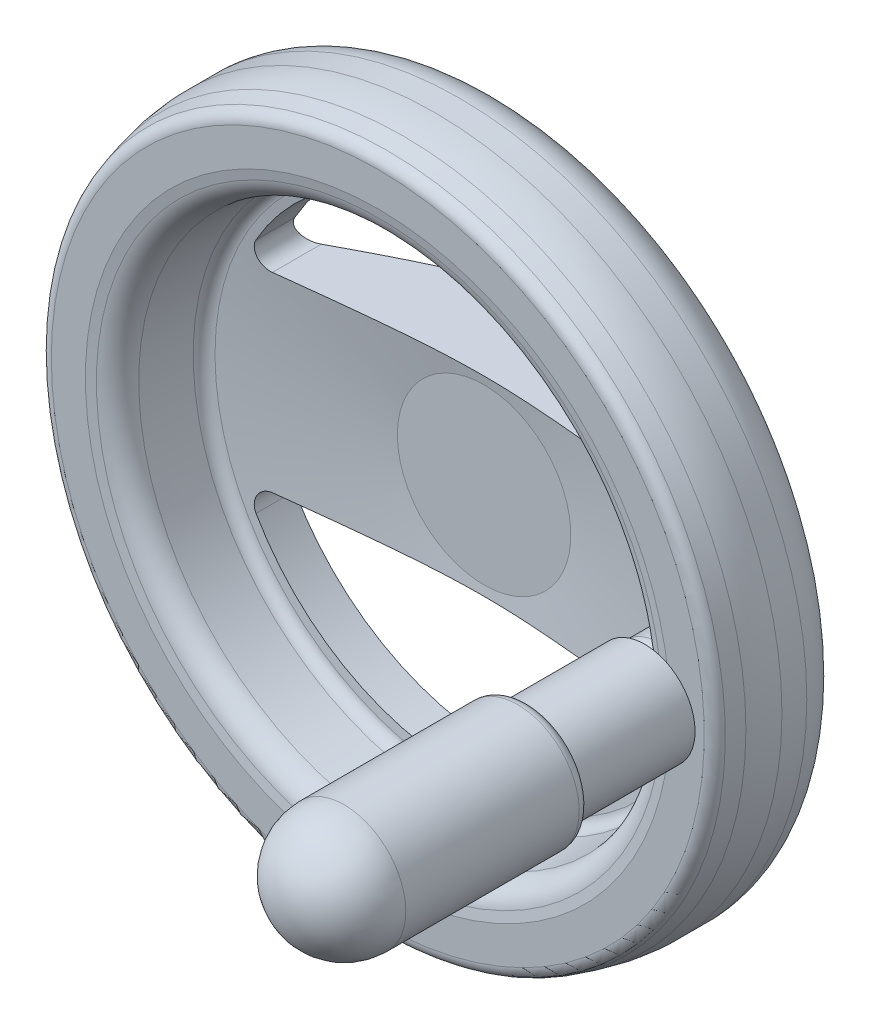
ISO-10303-21;
HEADER;
FILE_DESCRIPTION(('STEP AP214'),'2;1');
FILE_NAME('part.step','',(''),(''),'','','');
FILE_SCHEMA(('AUTOMOTIVE_DESIGN { 1 0 10303 214 1 1 1 1 }'));
ENDSEC;
DATA;
#1=APPLICATION_CONTEXT('core data for automotive mechanical design processes');
#2=APPLICATION_PROTOCOL_DEFINITION('international standard','automotive_design',2000,#1);
#3=PRODUCT_CONTEXT('',#1,'mechanical');
#4=PRODUCT('Part','Part','',(#3));
#5=PRODUCT_RELATED_PRODUCT_CATEGORY('part','',(#4));
#6=PRODUCT_DEFINITION_FORMATION('','',#4);
#7=PRODUCT_DEFINITION_CONTEXT('part definition',#1,'design');
#8=PRODUCT_DEFINITION('design','',#6,#7);
#9=PRODUCT_DEFINITION_SHAPE('','',#8);
#10=(LENGTH_UNIT() NAMED_UNIT(*) SI_UNIT(.MILLI.,.METRE.));
#11=(NAMED_UNIT(*) PLANE_ANGLE_UNIT() SI_UNIT($,.RADIAN.));
#12=(NAMED_UNIT(*) SI_UNIT($,.STERADIAN.) SOLID_ANGLE_UNIT());
#13=UNCERTAINTY_MEASURE_WITH_UNIT(LENGTH_MEASURE(1.E-05),#10,'distance_accuracy_value','');
#14=(GEOMETRIC_REPRESENTATION_CONTEXT(3) GLOBAL_UNCERTAINTY_ASSIGNED_CONTEXT((#13)) GLOBAL_UNIT_ASSIGNED_CONTEXT((#10,
#11,#12)) REPRESENTATION_CONTEXT('',''));
#15=CARTESIAN_POINT('',(0.,0.,0.));
#16=DIRECTION('',(0.,0.,1.));
#17=DIRECTION('',(1.,0.,0.));
#18=AXIS2_PLACEMENT_3D('',#15,#16,#17);
#19=CARTESIAN_POINT('',(0.,0.,3.1));
#20=DIRECTION('',(0.,0.,1.));
#21=DIRECTION('',(-1.,0.,0.));
#22=AXIS2_PLACEMENT_3D('',#19,#20,#21);
#23=CYLINDRICAL_SURFACE('',#22,15.5);
#24=CARTESIAN_POINT('',(0.,0.,0.7));
#25=DIRECTION('',(0.,0.,1.));
#26=DIRECTION('',(-1.,0.,0.));
#27=AXIS2_PLACEMENT_3D('',#24,#25,#26);
#28=CIRCLE('',#27,15.5);
#29=CARTESIAN_POINT('',(-15.5,0.,0.7));
#30=VERTEX_POINT('',#29);
#31=EDGE_CURVE('E472',#30,#30,#28,.T.);
#32=ORIENTED_EDGE('',*,*,#31,.T.);
#33=EDGE_LOOP('',(#32));
#34=FACE_BOUND('',#33,.T.);
#35=CARTESIAN_POINT('',(0.,0.,5.5));
#36=DIRECTION('',(0.,0.,1.));
#37=DIRECTION('',(-1.,0.,0.));
#38=AXIS2_PLACEMENT_3D('',#35,#36,#37);
#39=CIRCLE('',#38,15.5);
#40=CARTESIAN_POINT('',(15.2807067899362,2.59807621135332,5.5));
#41=VERTEX_POINT('',#40);
#42=CARTESIAN_POINT('',(15.2807067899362,-2.59807621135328,5.5));
#43=VERTEX_POINT('',#42);
#44=EDGE_CURVE('E577',#41,#43,#39,.T.);
#45=ORIENTED_EDGE('',*,*,#44,.F.);
#46=CARTESIAN_POINT('',(15.2807067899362,2.59807621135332,5.5));
#47=CARTESIAN_POINT('',(15.2879061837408,2.55572575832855,5.42663279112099));
#48=CARTESIAN_POINT('',(15.295454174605,2.51027351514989,5.35509753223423));
#49=CARTESIAN_POINT('',(15.3110201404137,2.41351872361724,5.21616071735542));
#50=CARTESIAN_POINT('',(15.3190380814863,2.36221659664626,5.14875886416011));
#51=CARTESIAN_POINT('',(15.3353151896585,2.25412671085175,5.01856916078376));
#52=CARTESIAN_POINT('',(15.3435742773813,2.19734074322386,4.95577981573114));
#53=CARTESIAN_POINT('',(15.360099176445,2.07868971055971,4.83523413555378));
#54=CARTESIAN_POINT('',(15.3683649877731,2.01682465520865,4.77747779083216));
#55=CARTESIAN_POINT('',(15.3928274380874,1.82416025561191,4.61232408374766));
#56=CARTESIAN_POINT('',(15.4086971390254,1.68624042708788,4.5129804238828));
#57=CARTESIAN_POINT('',(15.4377405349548,1.39552577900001,4.33894061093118));
#58=CARTESIAN_POINT('',(15.4509150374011,1.2427354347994,4.26423707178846));
#59=CARTESIAN_POINT('',(15.4730504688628,0.927139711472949,4.14186959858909));
#60=CARTESIAN_POINT('',(15.4820296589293,0.764381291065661,4.09408828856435));
#61=CARTESIAN_POINT('',(15.4948397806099,0.432932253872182,4.02658859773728));
#62=CARTESIAN_POINT('',(15.4986704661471,0.264241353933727,4.00687155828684));
#63=CARTESIAN_POINT('',(15.5007292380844,-0.0713023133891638,3.9962307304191));
#64=CARTESIAN_POINT('',(15.499048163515,-0.238139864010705,4.00484010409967));
#65=CARTESIAN_POINT('',(15.4904704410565,-0.567922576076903,4.04955115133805));
#66=CARTESIAN_POINT('',(15.4835745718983,-0.730868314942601,4.08564872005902));
#67=CARTESIAN_POINT('',(15.4653552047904,-1.04782383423,4.18405857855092));
#68=CARTESIAN_POINT('',(15.4540450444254,-1.20185894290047,4.24629194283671));
#69=CARTESIAN_POINT('',(15.4282121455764,-1.49743557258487,4.39518128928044));
#70=CARTESIAN_POINT('',(15.4136877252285,-1.6389704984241,4.48185006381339));
#71=CARTESIAN_POINT('',(15.3827463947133,-1.90780985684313,4.67869164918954));
#72=CARTESIAN_POINT('',(15.3663034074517,-2.0348566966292,4.78921131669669));
#73=CARTESIAN_POINT('',(15.333542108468,-2.26857045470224,5.02981809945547));
#74=CARTESIAN_POINT('',(15.3172236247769,-2.37527389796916,5.15986938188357));
#75=CARTESIAN_POINT('',(15.2982261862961,-2.49295043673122,5.33062876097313));
#76=CARTESIAN_POINT('',(15.294626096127,-2.51493147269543,5.36393237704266));
#77=CARTESIAN_POINT('',(15.2875613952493,-2.55752436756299,5.43135363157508));
#78=CARTESIAN_POINT('',(15.2840966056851,-2.57813806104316,5.46547009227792));
#79=CARTESIAN_POINT('',(15.2807067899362,-2.59807621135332,5.5));
#80=B_SPLINE_CURVE_WITH_KNOTS('',3,(#46,#47,#48,#49,#50,#51,#52,#53,#54,#55,#56,#57,#58,#59,#60,
#61,#62,#63,#64,#65,#66,#67,#68,#69,#70,#71,#72,#73,#74,#75,#76,#77,#78,#79),.UNSPECIFIED.,.F.,
.F.,(4,2,2,2,2,2,2,2,2,2,2,2,2,2,2,2,4),(0.,0.254968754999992,0.509919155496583,
0.764786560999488,1.01965348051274,1.52914868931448,2.03849103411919,2.54559520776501,
3.05272361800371,3.55153635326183,4.05027461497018,4.5475174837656,5.04502115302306,
5.55031663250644,6.05469616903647,6.17487527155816,6.29488972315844),.UNSPECIFIED.);
#81=EDGE_CURVE('E29',#41,#43,#80,.T.);
#82=ORIENTED_EDGE('',*,*,#81,.T.);
#83=EDGE_LOOP('',(#45,#82));
#84=FACE_BOUND('',#83,.T.);
#85=ADVANCED_FACE('F14',(#34,#84),#23,.T.);
#86=CARTESIAN_POINT('',(0.,0.,21.3797465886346));
#87=DIRECTION('',(0.,0.,1.));
#88=DIRECTION('',(-1.,0.,0.));
#89=AXIS2_PLACEMENT_3D('',#86,#87,#88);
#90=CONICAL_SURFACE('',#89,42.1472100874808,1.03337831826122);
#91=CARTESIAN_POINT('',(-34.7560813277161,-17.05,19.3331471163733));
#92=CARTESIAN_POINT('',(-34.9642160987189,-17.0500388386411,19.4445654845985));
#93=CARTESIAN_POINT('',(-35.1694190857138,-17.0735554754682,19.5606672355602));
#94=CARTESIAN_POINT('',(-35.5667554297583,-17.164089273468,19.7972740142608));
#95=CARTESIAN_POINT('',(-35.7589160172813,-17.2310125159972,19.9177690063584));
#96=CARTESIAN_POINT('',(-36.099678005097,-17.3933837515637,20.1427185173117));
#97=CARTESIAN_POINT('',(-36.250675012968,-17.4838625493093,20.2471778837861));
#98=CARTESIAN_POINT('',(-36.5340722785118,-17.6930027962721,20.4534650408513));
#99=CARTESIAN_POINT('',(-36.6664589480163,-17.8116846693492,20.5552908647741));
#100=CARTESIAN_POINT('',(-36.9097263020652,-18.0770520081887,20.7549142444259));
#101=CARTESIAN_POINT('',(-37.0202464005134,-18.2241386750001,20.8526261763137));
#102=CARTESIAN_POINT('',(-37.1636021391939,-18.4618665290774,20.9920574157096));
#103=CARTESIAN_POINT('',(-37.2076243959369,-18.5438882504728,21.0373125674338));
#104=CARTESIAN_POINT('',(-37.2875839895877,-18.7131623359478,21.1250514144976));
#105=CARTESIAN_POINT('',(-37.3235269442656,-18.8004110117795,21.1675370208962));
#106=CARTESIAN_POINT('',(-37.378644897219,-18.9568600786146,21.2389212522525));
#107=CARTESIAN_POINT('',(-37.3997621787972,-19.0250543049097,21.2685416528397));
#108=CARTESIAN_POINT('',(-37.4367840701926,-19.163634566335,21.3257302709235));
#109=CARTESIAN_POINT('',(-37.4526913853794,-19.2340194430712,21.353299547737));
#110=CARTESIAN_POINT('',(-37.465857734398,-19.3053573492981,21.3797465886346));
#111=B_SPLINE_CURVE_WITH_KNOTS('',3,(#91,#92,#93,#94,#95,#96,#97,#98,#99,#100,#101,#102,#103,
#104,#105,#106,#107,#108,#109,#110),.UNSPECIFIED.,.F.,.F.,(4,2,2,2,2,2,2,2,2,4),(0.,
0.706568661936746,1.41161360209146,2.0230154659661,2.63486144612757,3.25608193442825,
3.5662093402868,3.87612043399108,4.1077705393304,4.33930016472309),.UNSPECIFIED.);
#112=CARTESIAN_POINT('',(-34.7560813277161,-17.05,19.3331471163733));
#113=VERTEX_POINT('',#112);
#114=CARTESIAN_POINT('',(-37.465857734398,-19.3053573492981,21.3797465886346));
#115=VERTEX_POINT('',#114);
#116=EDGE_CURVE('E559',#113,#115,#111,.T.);
#117=ORIENTED_EDGE('',*,*,#116,.T.);
#118=CARTESIAN_POINT('',(0.,0.,21.3797465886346));
#119=DIRECTION('',(0.,0.,-1.));
#120=DIRECTION('',(0.,1.,0.));
#121=AXIS2_PLACEMENT_3D('',#118,#119,#120);
#122=CIRCLE('',#121,42.1472100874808);
#123=CARTESIAN_POINT('',(-37.465857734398,19.3053573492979,21.3797465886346));
#124=VERTEX_POINT('',#123);
#125=EDGE_CURVE('E1045',#115,#124,#122,.T.);
#126=ORIENTED_EDGE('',*,*,#125,.T.);
#127=CARTESIAN_POINT('',(-37.465857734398,19.3053573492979,21.3797465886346));
#128=CARTESIAN_POINT('',(-37.45063462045,19.2228937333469,21.3491732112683));
#129=CARTESIAN_POINT('',(-37.4317600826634,19.1417288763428,21.3171129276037));
#130=CARTESIAN_POINT('',(-37.3871473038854,18.9825042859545,21.2503457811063));
#131=CARTESIAN_POINT('',(-37.36141437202,18.9044422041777,21.2156409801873));
#132=CARTESIAN_POINT('',(-37.2748626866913,18.6763284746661,21.1083733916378));
#133=CARTESIAN_POINT('',(-37.2045125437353,18.5314258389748,21.0323117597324));
#134=CARTESIAN_POINT('',(-37.0423053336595,18.2591559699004,20.8736588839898));
#135=CARTESIAN_POINT('',(-36.9505105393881,18.1317396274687,20.7910869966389));
#136=CARTESIAN_POINT('',(-36.7485268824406,17.8957384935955,20.6211835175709));
#137=CARTESIAN_POINT('',(-36.6383094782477,17.7871834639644,20.5338446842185));
#138=CARTESIAN_POINT('',(-36.390008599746,17.5801946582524,20.346903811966));
#139=CARTESIAN_POINT('',(-36.2502031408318,17.4841040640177,20.2469929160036));
#140=CARTESIAN_POINT('',(-35.9559631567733,17.319233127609,20.0463793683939));
#141=CARTESIAN_POINT('',(-35.8015348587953,17.2504412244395,19.9456770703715));
#142=CARTESIAN_POINT('',(-35.5007531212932,17.1483578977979,19.7578042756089));
#143=CARTESIAN_POINT('',(-35.3556140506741,17.1118238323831,19.6704453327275));
#144=CARTESIAN_POINT('',(-35.0595338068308,17.0626556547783,19.4989251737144));
#145=CARTESIAN_POINT('',(-34.9085924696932,17.050022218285,19.4147640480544));
#146=CARTESIAN_POINT('',(-34.7560813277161,17.05,19.3331471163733));
#147=B_SPLINE_CURVE_WITH_KNOTS('',3,(#127,#128,#129,#130,#131,#132,#133,#134,#135,#136,#137,
#138,#139,#140,#141,#142,#143,#144,#145,#146),.UNSPECIFIED.,.F.,.F.,(4,2,2,2,2,2,2,2,2,4),(0.,
0.267554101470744,0.53490168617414,1.06663180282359,1.59683661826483,2.12787060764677,
2.71600119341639,3.30388243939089,3.82204375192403,4.34021971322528),.UNSPECIFIED.);
#148=CARTESIAN_POINT('',(-34.7560813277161,17.05,19.3331471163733));
#149=VERTEX_POINT('',#148);
#150=EDGE_CURVE('E589',#124,#149,#147,.T.);
#151=ORIENTED_EDGE('',*,*,#150,.T.);
#152=CARTESIAN_POINT('',(-34.7560813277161,17.05,19.3331471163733));
#153=CARTESIAN_POINT('',(-33.9725683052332,17.05,18.9140040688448));
#154=CARTESIAN_POINT('',(-33.187944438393,17.05,18.4969215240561));
#155=CARTESIAN_POINT('',(-31.6159567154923,17.05,17.667875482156));
#156=CARTESIAN_POINT('',(-30.8285927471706,17.05,17.2559121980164));
#157=CARTESIAN_POINT('',(-29.2495677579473,17.05,16.4375656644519));
#158=CARTESIAN_POINT('',(-28.4579022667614,17.05,16.0311910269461));
#159=CARTESIAN_POINT('',(-26.8707444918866,17.05,15.2260017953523));
#160=CARTESIAN_POINT('',(-26.0752522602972,17.05,14.827187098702));
#161=CARTESIAN_POINT('',(-24.4369579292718,17.05,14.0177947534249));
#162=CARTESIAN_POINT('',(-23.5939019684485,17.05,13.6077295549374));
#163=CARTESIAN_POINT('',(-21.9014905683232,17.05,12.8007036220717));
#164=CARTESIAN_POINT('',(-21.052134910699,17.05,12.4037433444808));
#165=CARTESIAN_POINT('',(-19.3461264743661,17.05,11.626846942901));
#166=CARTESIAN_POINT('',(-18.4894774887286,17.05,11.2469025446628));
#167=CARTESIAN_POINT('',(-17.1974661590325,17.05,10.6934878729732));
#168=CARTESIAN_POINT('',(-16.7656332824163,17.05,10.5117708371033));
#169=CARTESIAN_POINT('',(-15.8993625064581,17.05,10.1546646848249));
#170=CARTESIAN_POINT('',(-15.4649246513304,17.05,9.97927546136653));
#171=CARTESIAN_POINT('',(-14.5301471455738,17.05,9.61092120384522));
#172=CARTESIAN_POINT('',(-14.0293621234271,17.05,9.41908211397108));
#173=CARTESIAN_POINT('',(-13.0236598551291,17.05,9.04659617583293));
#174=CARTESIAN_POINT('',(-12.5187427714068,17.05,8.86594888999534));
#175=CARTESIAN_POINT('',(-11.5042481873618,17.05,8.51776826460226));
#176=CARTESIAN_POINT('',(-10.9946697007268,17.05,8.35023777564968));
#177=CARTESIAN_POINT('',(-9.9707227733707,17.05,8.0306459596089));
#178=CARTESIAN_POINT('',(-9.45635433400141,17.05,7.87858462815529));
#179=CARTESIAN_POINT('',(-7.92620850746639,17.05,7.45517806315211));
#180=CARTESIAN_POINT('',(-6.90297443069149,17.05,7.20940813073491));
#181=CARTESIAN_POINT('',(-5.3551607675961,17.05,6.90909796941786));
#182=CARTESIAN_POINT('',(-4.83711291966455,17.05,6.82039061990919));
#183=CARTESIAN_POINT('',(-3.79725745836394,17.05,6.66828978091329));
#184=CARTESIAN_POINT('',(-3.27544988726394,17.05,6.60489600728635));
#185=CARTESIAN_POINT('',(-2.21924330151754,17.05,6.50459293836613));
#186=CARTESIAN_POINT('',(-1.68479371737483,17.05,6.46821090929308));
#187=CARTESIAN_POINT('',(-0.614687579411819,17.05,6.42530779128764));
#188=CARTESIAN_POINT('',(-0.0790310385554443,17.05,6.41878638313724));
#189=CARTESIAN_POINT('',(0.991781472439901,17.05,6.43586040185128));
#190=CARTESIAN_POINT('',(1.52693745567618,17.05,6.45945501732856));
#191=CARTESIAN_POINT('',(2.5951483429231,17.05,6.53584590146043));
#192=CARTESIAN_POINT('',(3.12820319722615,17.05,6.58864285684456));
#193=CARTESIAN_POINT('',(4.20204910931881,17.05,6.72293286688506));
#194=CARTESIAN_POINT('',(4.74276684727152,17.05,6.8050065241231));
#195=CARTESIAN_POINT('',(5.81967745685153,17.05,6.99488444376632));
#196=CARTESIAN_POINT('',(6.35586984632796,17.05,7.10269141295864));
#197=CARTESIAN_POINT('',(7.42338587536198,17.05,7.34102353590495));
#198=CARTESIAN_POINT('',(7.95470727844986,17.05,7.4715586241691));
#199=CARTESIAN_POINT('',(9.0121030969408,17.05,7.75225748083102));
#200=CARTESIAN_POINT('',(9.53817749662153,17.05,7.90242130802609));
#201=CARTESIAN_POINT('',(10.621187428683,17.05,8.23042811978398));
#202=CARTESIAN_POINT('',(11.1777598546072,17.05,8.40946399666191));
#203=CARTESIAN_POINT('',(12.2854805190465,17.05,8.78365072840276));
#204=CARTESIAN_POINT('',(12.8366283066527,17.05,8.97880291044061));
#205=CARTESIAN_POINT('',(13.9341401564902,17.05,9.38267214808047));
#206=CARTESIAN_POINT('',(14.4805023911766,17.05,9.59139414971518));
#207=CARTESIAN_POINT('',(15.5687390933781,17.05,10.0201486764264));
#208=CARTESIAN_POINT('',(16.1106136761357,17.05,10.2401809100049));
#209=CARTESIAN_POINT('',(17.1914207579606,17.05,10.6901844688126));
#210=CARTESIAN_POINT('',(17.7303456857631,17.05,10.9201739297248));
#211=CARTESIAN_POINT('',(18.8046810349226,17.05,11.3882094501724));
#212=CARTESIAN_POINT('',(19.3400914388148,17.05,11.6262555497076));
#213=CARTESIAN_POINT('',(20.4077124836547,17.05,12.1091289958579));
#214=CARTESIAN_POINT('',(20.9399237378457,17.05,12.3539549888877));
#215=CARTESIAN_POINT('',(22.0016218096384,17.05,12.8494305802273));
#216=CARTESIAN_POINT('',(22.531108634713,17.05,13.1000801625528));
#217=CARTESIAN_POINT('',(24.049321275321,17.05,13.8275438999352));
#218=CARTESIAN_POINT('',(25.0350550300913,17.05,14.3106040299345));
#219=CARTESIAN_POINT('',(26.999950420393,17.05,15.2899855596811));
#220=CARTESIAN_POINT('',(27.9791116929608,17.05,15.7863076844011));
#221=CARTESIAN_POINT('',(29.9270073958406,17.05,16.7865810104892));
#222=CARTESIAN_POINT('',(30.8957695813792,17.05,17.2904782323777));
#223=CARTESIAN_POINT('',(32.3456864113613,17.05,18.0523103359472));
#224=CARTESIAN_POINT('',(32.828426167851,17.05,18.307237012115));
#225=CARTESIAN_POINT('',(33.7929469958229,17.05,18.818891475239));
#226=CARTESIAN_POINT('',(34.2747280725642,17.05,19.0756192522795));
#227=CARTESIAN_POINT('',(34.7560813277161,17.05,19.3331471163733));
#228=B_SPLINE_CURVE_WITH_KNOTS('',3,(#152,#153,#154,#155,#156,#157,#158,#159,#160,#161,#162,
#163,#164,#165,#166,#167,#168,#169,#170,#171,#172,#173,#174,#175,#176,#177,#178,#179,#180,#181,
#182,#183,#184,#185,#186,#187,#188,#189,#190,#191,#192,#193,#194,#195,#196,#197,#198,#199,#200,
#201,#202,#203,#204,#205,#206,#207,#208,#209,#210,#211,#212,#213,#214,#215,#216,#217,#218,#219,
#220,#221,#222,#223,#224,#225,#226,#227),.UNSPECIFIED.,.F.,.F.,(4,2,2,2,2,2,2,2,2,2,2,2,2,2,2,2,
2,2,2,2,2,2,2,2,2,2,2,2,2,2,2,2,2,2,2,2,2,4),(0.,2.66574670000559,5.33160393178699,
8.00119036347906,10.6707405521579,13.4831341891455,16.2956257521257,19.1067345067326,
20.5122208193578,21.9176833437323,23.5263827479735,25.1350192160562,26.7440043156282,
28.3529889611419,31.5061153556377,33.0823752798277,34.6586175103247,36.2648724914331,
37.8711103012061,39.4773048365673,41.0835371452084,42.7235772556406,44.3637899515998,
46.0047213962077,47.6456577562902,49.3993406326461,51.1531680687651,52.9076383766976,
54.6620634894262,56.4198308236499,58.1776068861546,59.9350345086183,61.6924573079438,
64.9855082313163,68.2787395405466,71.5546180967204,73.192365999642,74.830104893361),.UNSPECIFIED.);
#229=CARTESIAN_POINT('',(34.7560813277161,17.05,19.3331471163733));
#230=VERTEX_POINT('',#229);
#231=EDGE_CURVE('E457',#149,#230,#228,.T.);
#232=ORIENTED_EDGE('',*,*,#231,.T.);
#233=CARTESIAN_POINT('',(34.7560813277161,17.05,19.3331471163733));
#234=CARTESIAN_POINT('',(34.9642160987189,17.0500388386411,19.4445654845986));
#235=CARTESIAN_POINT('',(35.1694190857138,17.0735554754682,19.5606672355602));
#236=CARTESIAN_POINT('',(35.5667554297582,17.164089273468,19.7972740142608));
#237=CARTESIAN_POINT('',(35.7589160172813,17.2310125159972,19.9177690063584));
#238=CARTESIAN_POINT('',(36.099678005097,17.3933837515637,20.1427185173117));
#239=CARTESIAN_POINT('',(36.2506750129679,17.4838625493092,20.2471778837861));
#240=CARTESIAN_POINT('',(36.5340722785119,17.6930027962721,20.4534650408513));
#241=CARTESIAN_POINT('',(36.6664589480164,17.8116846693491,20.5552908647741));
#242=CARTESIAN_POINT('',(36.9097263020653,18.0770520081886,20.7549142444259));
#243=CARTESIAN_POINT('',(37.0202464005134,18.224138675,20.8526261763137));
#244=CARTESIAN_POINT('',(37.1636021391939,18.4618665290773,20.9920574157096));
#245=CARTESIAN_POINT('',(37.2076243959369,18.5438882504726,21.0373125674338));
#246=CARTESIAN_POINT('',(37.2875839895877,18.7131623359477,21.1250514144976));
#247=CARTESIAN_POINT('',(37.3235269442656,18.8004110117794,21.1675370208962));
#248=CARTESIAN_POINT('',(37.3786448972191,18.9568600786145,21.2389212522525));
#249=CARTESIAN_POINT('',(37.3997621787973,19.0250543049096,21.2685416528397));
#250=CARTESIAN_POINT('',(37.4367840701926,19.1636345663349,21.3257302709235));
#251=CARTESIAN_POINT('',(37.4526913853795,19.234019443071,21.353299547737));
#252=CARTESIAN_POINT('',(37.465857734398,19.3053573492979,21.3797465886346));
#253=B_SPLINE_CURVE_WITH_KNOTS('',3,(#233,#234,#235,#236,#237,#238,#239,#240,#241,#242,#243,
#244,#245,#246,#247,#248,#249,#250,#251,#252),.UNSPECIFIED.,.F.,.F.,(4,2,2,2,2,2,2,2,2,4),(0.,
0.70656866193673,1.41161360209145,2.02301546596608,2.63486144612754,3.25608193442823,
3.56620934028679,3.87612043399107,4.10777053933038,4.33930016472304),.UNSPECIFIED.);
#254=CARTESIAN_POINT('',(37.4658577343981,19.305357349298,21.3797465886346));
#255=VERTEX_POINT('',#254);
#256=EDGE_CURVE('E578',#230,#255,#253,.T.);
#257=ORIENTED_EDGE('',*,*,#256,.T.);
#258=CARTESIAN_POINT('',(0.,0.,21.3797465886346));
#259=DIRECTION('',(0.,0.,-1.));
#260=DIRECTION('',(0.,1.,0.));
#261=AXIS2_PLACEMENT_3D('',#258,#259,#260);
#262=CIRCLE('',#261,42.1472100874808);
#263=CARTESIAN_POINT('',(37.465857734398,-19.305357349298,21.3797465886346));
#264=VERTEX_POINT('',#263);
#265=EDGE_CURVE('E992',#255,#264,#262,.T.);
#266=ORIENTED_EDGE('',*,*,#265,.T.);
#267=CARTESIAN_POINT('',(37.465857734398,-19.305357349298,21.3797465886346));
#268=CARTESIAN_POINT('',(37.4506346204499,-19.222893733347,21.3491732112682));
#269=CARTESIAN_POINT('',(37.4317600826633,-19.1417288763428,21.3171129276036));
#270=CARTESIAN_POINT('',(37.3871473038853,-18.9825042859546,21.2503457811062));
#271=CARTESIAN_POINT('',(37.36141437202,-18.9044422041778,21.2156409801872));
#272=CARTESIAN_POINT('',(37.2748626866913,-18.6763284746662,21.1083733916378));
#273=CARTESIAN_POINT('',(37.2045125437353,-18.5314258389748,21.0323117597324));
#274=CARTESIAN_POINT('',(37.0423053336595,-18.2591559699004,20.8736588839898));
#275=CARTESIAN_POINT('',(36.9505105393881,-18.1317396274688,20.7910869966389));
#276=CARTESIAN_POINT('',(36.7485268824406,-17.8957384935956,20.6211835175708));
#277=CARTESIAN_POINT('',(36.6383094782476,-17.7871834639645,20.5338446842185));
#278=CARTESIAN_POINT('',(36.3900085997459,-17.5801946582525,20.346903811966));
#279=CARTESIAN_POINT('',(36.2502031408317,-17.4841040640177,20.2469929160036));
#280=CARTESIAN_POINT('',(35.9559631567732,-17.319233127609,20.0463793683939));
#281=CARTESIAN_POINT('',(35.8015348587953,-17.2504412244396,19.9456770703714));
#282=CARTESIAN_POINT('',(35.5007531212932,-17.1483578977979,19.7578042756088));
#283=CARTESIAN_POINT('',(35.3556140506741,-17.1118238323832,19.6704453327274));
#284=CARTESIAN_POINT('',(35.0595338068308,-17.0626556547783,19.4989251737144));
#285=CARTESIAN_POINT('',(34.9085924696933,-17.050022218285,19.4147640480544));
#286=CARTESIAN_POINT('',(34.7560813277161,-17.05,19.3331471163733));
#287=B_SPLINE_CURVE_WITH_KNOTS('',3,(#267,#268,#269,#270,#271,#272,#273,#274,#275,#276,#277,
#278,#279,#280,#281,#282,#283,#284,#285,#286),.UNSPECIFIED.,.F.,.F.,(4,2,2,2,2,2,2,2,2,4),(0.,
0.267554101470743,0.534901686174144,1.0666318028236,1.59683661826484,2.12787060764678,
2.71600119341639,3.3038824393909,3.82204375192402,4.34021971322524),.UNSPECIFIED.);
#288=CARTESIAN_POINT('',(34.7560813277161,-17.05,19.3331471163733));
#289=VERTEX_POINT('',#288);
#290=EDGE_CURVE('E566',#264,#289,#287,.T.);
#291=ORIENTED_EDGE('',*,*,#290,.T.);
#292=CARTESIAN_POINT('',(34.7560813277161,-17.05,19.3331471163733));
#293=CARTESIAN_POINT('',(33.9725683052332,-17.05,18.9140040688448));
#294=CARTESIAN_POINT('',(33.187944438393,-17.05,18.4969215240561));
#295=CARTESIAN_POINT('',(31.6159567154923,-17.05,17.6678754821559));
#296=CARTESIAN_POINT('',(30.8285927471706,-17.05,17.2559121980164));
#297=CARTESIAN_POINT('',(29.2495677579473,-17.05,16.4375656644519));
#298=CARTESIAN_POINT('',(28.4579022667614,-17.05,16.031191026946));
#299=CARTESIAN_POINT('',(26.8707444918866,-17.05,15.2260017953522));
#300=CARTESIAN_POINT('',(26.0752522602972,-17.05,14.827187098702));
#301=CARTESIAN_POINT('',(24.4369579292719,-17.05,14.0177947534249));
#302=CARTESIAN_POINT('',(23.5939019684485,-17.05,13.6077295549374));
#303=CARTESIAN_POINT('',(21.9014905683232,-17.05,12.8007036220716));
#304=CARTESIAN_POINT('',(21.052134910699,-17.05,12.4037433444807));
#305=CARTESIAN_POINT('',(19.3461264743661,-17.05,11.626846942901));
#306=CARTESIAN_POINT('',(18.4894774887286,-17.05,11.2469025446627));
#307=CARTESIAN_POINT('',(17.1974661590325,-17.05,10.6934878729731));
#308=CARTESIAN_POINT('',(16.7656332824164,-17.05,10.5117708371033));
#309=CARTESIAN_POINT('',(15.8993625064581,-17.05,10.1546646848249));
#310=CARTESIAN_POINT('',(15.4649246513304,-17.05,9.97927546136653));
#311=CARTESIAN_POINT('',(14.5301471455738,-17.05,9.61092120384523));
#312=CARTESIAN_POINT('',(14.0293621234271,-17.05,9.41908211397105));
#313=CARTESIAN_POINT('',(13.0236598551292,-17.05,9.04659617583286));
#314=CARTESIAN_POINT('',(12.5187427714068,-17.05,8.86594888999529));
#315=CARTESIAN_POINT('',(11.5042481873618,-17.05,8.51776826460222));
#316=CARTESIAN_POINT('',(10.9946697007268,-17.05,8.35023777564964));
#317=CARTESIAN_POINT('',(9.97072277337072,-17.05,8.03064595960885));
#318=CARTESIAN_POINT('',(9.45635433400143,-17.05,7.87858462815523));
#319=CARTESIAN_POINT('',(7.92620850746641,-17.05,7.45517806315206));
#320=CARTESIAN_POINT('',(6.90297443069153,-17.05,7.20940813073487));
#321=CARTESIAN_POINT('',(5.35516076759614,-17.05,6.9090979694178));
#322=CARTESIAN_POINT('',(4.83711291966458,-17.05,6.82039061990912));
#323=CARTESIAN_POINT('',(3.79725745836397,-17.05,6.66828978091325));
#324=CARTESIAN_POINT('',(3.27544988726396,-17.05,6.60489600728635));
#325=CARTESIAN_POINT('',(2.21924330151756,-17.05,6.50459293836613));
#326=CARTESIAN_POINT('',(1.68479371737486,-17.05,6.46821090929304));
#327=CARTESIAN_POINT('',(0.614687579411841,-17.05,6.42530779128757));
#328=CARTESIAN_POINT('',(0.0790310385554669,-17.05,6.41878638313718));
#329=CARTESIAN_POINT('',(-0.991781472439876,-17.05,6.43586040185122));
#330=CARTESIAN_POINT('',(-1.52693745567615,-17.05,6.4594550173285));
#331=CARTESIAN_POINT('',(-2.59514834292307,-17.05,6.53584590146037));
#332=CARTESIAN_POINT('',(-3.12820319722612,-17.05,6.5886428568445));
#333=CARTESIAN_POINT('',(-4.20204910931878,-17.05,6.722932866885));
#334=CARTESIAN_POINT('',(-4.74276684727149,-17.05,6.80500652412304));
#335=CARTESIAN_POINT('',(-5.8196774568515,-17.05,6.99488444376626));
#336=CARTESIAN_POINT('',(-6.35586984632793,-17.05,7.10269141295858));
#337=CARTESIAN_POINT('',(-7.42338587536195,-17.05,7.34102353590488));
#338=CARTESIAN_POINT('',(-7.95470727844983,-17.05,7.47155862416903));
#339=CARTESIAN_POINT('',(-9.01210309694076,-17.05,7.75225748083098));
#340=CARTESIAN_POINT('',(-9.53817749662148,-17.05,7.90242130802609));
#341=CARTESIAN_POINT('',(-10.621187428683,-17.05,8.23042811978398));
#342=CARTESIAN_POINT('',(-11.1777598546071,-17.05,8.40946399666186));
#343=CARTESIAN_POINT('',(-12.2854805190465,-17.05,8.78365072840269));
#344=CARTESIAN_POINT('',(-12.8366283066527,-17.05,8.97880291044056));
#345=CARTESIAN_POINT('',(-13.9341401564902,-17.05,9.38267214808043));
#346=CARTESIAN_POINT('',(-14.4805023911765,-17.05,9.59139414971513));
#347=CARTESIAN_POINT('',(-15.5687390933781,-17.05,10.0201486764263));
#348=CARTESIAN_POINT('',(-16.1106136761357,-17.05,10.2401809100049));
#349=CARTESIAN_POINT('',(-17.1914207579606,-17.05,10.6901844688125));
#350=CARTESIAN_POINT('',(-17.7303456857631,-17.05,10.9201739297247));
#351=CARTESIAN_POINT('',(-18.8046810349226,-17.05,11.3882094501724));
#352=CARTESIAN_POINT('',(-19.3400914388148,-17.05,11.6262555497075));
#353=CARTESIAN_POINT('',(-20.4077124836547,-17.05,12.1091289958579));
#354=CARTESIAN_POINT('',(-20.9399237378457,-17.05,12.3539549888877));
#355=CARTESIAN_POINT('',(-22.0016218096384,-17.05,12.8494305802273));
#356=CARTESIAN_POINT('',(-22.531108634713,-17.05,13.1000801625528));
#357=CARTESIAN_POINT('',(-24.049321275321,-17.05,13.8275438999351));
#358=CARTESIAN_POINT('',(-25.0350550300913,-17.05,14.3106040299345));
#359=CARTESIAN_POINT('',(-26.999950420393,-17.05,15.289985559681));
#360=CARTESIAN_POINT('',(-27.9791116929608,-17.05,15.786307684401));
#361=CARTESIAN_POINT('',(-29.9270073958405,-17.05,16.7865810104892));
#362=CARTESIAN_POINT('',(-30.8957695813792,-17.05,17.2904782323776));
#363=CARTESIAN_POINT('',(-32.3456864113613,-17.05,18.0523103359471));
#364=CARTESIAN_POINT('',(-32.828426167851,-17.05,18.307237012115));
#365=CARTESIAN_POINT('',(-33.7929469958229,-17.05,18.8188914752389));
#366=CARTESIAN_POINT('',(-34.2747280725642,-17.05,19.0756192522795));
#367=CARTESIAN_POINT('',(-34.7560813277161,-17.05,19.3331471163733));
#368=B_SPLINE_CURVE_WITH_KNOTS('',3,(#292,#293,#294,#295,#296,#297,#298,#299,#300,#301,#302,
#303,#304,#305,#306,#307,#308,#309,#310,#311,#312,#313,#314,#315,#316,#317,#318,#319,#320,#321,
#322,#323,#324,#325,#326,#327,#328,#329,#330,#331,#332,#333,#334,#335,#336,#337,#338,#339,#340,
#341,#342,#343,#344,#345,#346,#347,#348,#349,#350,#351,#352,#353,#354,#355,#356,#357,#358,#359,
#360,#361,#362,#363,#364,#365,#366,#367),.UNSPECIFIED.,.F.,.F.,(4,2,2,2,2,2,2,2,2,2,2,2,2,2,2,2,
2,2,2,2,2,2,2,2,2,2,2,2,2,2,2,2,2,2,2,2,2,4),(0.,2.66574670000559,5.331603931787,
8.00119036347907,10.6707405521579,13.4831341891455,16.2956257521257,19.1067345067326,
20.5122208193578,21.9176833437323,23.5263827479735,25.1350192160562,26.7440043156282,
28.352988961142,31.5061153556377,33.0823752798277,34.6586175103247,36.2648724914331,
37.8711103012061,39.4773048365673,41.0835371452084,42.7235772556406,44.3637899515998,
46.0047213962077,47.6456577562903,49.3993406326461,51.1531680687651,52.9076383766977,
54.6620634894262,56.41983082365,58.1776068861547,59.9350345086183,61.6924573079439,
64.9855082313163,68.2787395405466,71.5546180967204,73.192365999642,74.830104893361),.UNSPECIFIED.);
#369=EDGE_CURVE('E567',#289,#113,#368,.T.);
#370=ORIENTED_EDGE('',*,*,#369,.T.);
#371=EDGE_LOOP('',(#117,#126,#151,#232,#257,#266,#291,#370));
#372=FACE_BOUND('',#371,.T.);
#373=ORIENTED_EDGE('',*,*,#44,.T.);
#374=CARTESIAN_POINT('',(14.5672450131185,-2.27963154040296,5.0498));
#375=CARTESIAN_POINT('',(14.6446904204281,-2.32196039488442,5.09929945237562));
#376=CARTESIAN_POINT('',(14.7231438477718,-2.36189336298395,5.14922015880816));
#377=CARTESIAN_POINT('',(14.8817238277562,-2.437291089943,5.24969270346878));
#378=CARTESIAN_POINT('',(14.961849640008,-2.47275777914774,5.30024425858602));
#379=CARTESIAN_POINT('',(15.1233335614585,-2.53951416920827,5.40170632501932));
#380=CARTESIAN_POINT('',(15.2046888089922,-2.57081228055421,5.4526158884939));
#381=CARTESIAN_POINT('',(15.3685670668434,-2.62959536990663,5.55476648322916));
#382=CARTESIAN_POINT('',(15.4510902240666,-2.65707986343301,5.60600755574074));
#383=CARTESIAN_POINT('',(15.7001640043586,-2.7341990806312,5.76009207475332));
#384=CARTESIAN_POINT('',(15.8681827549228,-2.7784848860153,5.86327410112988));
#385=CARTESIAN_POINT('',(16.2069833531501,-2.8543145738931,6.06994815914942));
#386=CARTESIAN_POINT('',(16.3777672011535,-2.88584876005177,6.17344036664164));
#387=CARTESIAN_POINT('',(16.8209114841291,-2.95216078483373,6.44037224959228));
#388=CARTESIAN_POINT('',(17.0946639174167,-2.97818742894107,6.60372263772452));
#389=CARTESIAN_POINT('',(17.6442353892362,-3.00359289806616,6.92904711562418));
#390=CARTESIAN_POINT('',(17.9200552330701,-3.0029607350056,7.09102061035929));
#391=CARTESIAN_POINT('',(18.4716539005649,-2.97585194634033,7.41276398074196));
#392=CARTESIAN_POINT('',(18.7474327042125,-2.94938446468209,7.57253461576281));
#393=CARTESIAN_POINT('',(19.1593782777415,-2.88977438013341,7.8098308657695));
#394=CARTESIAN_POINT('',(19.2963772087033,-2.86659330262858,7.8885197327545));
#395=CARTESIAN_POINT('',(19.5695348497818,-2.81332759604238,8.04500000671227));
#396=CARTESIAN_POINT('',(19.7056936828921,-2.78324400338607,8.12279154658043));
#397=CARTESIAN_POINT('',(19.9645285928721,-2.71885728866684,8.27031105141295));
#398=CARTESIAN_POINT('',(20.0873086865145,-2.68518328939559,8.34013109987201));
#399=CARTESIAN_POINT('',(20.3315140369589,-2.61142957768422,8.47871478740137));
#400=CARTESIAN_POINT('',(20.4529395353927,-2.57135102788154,8.54747861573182));
#401=CARTESIAN_POINT('',(20.6943930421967,-2.48412560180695,8.68395390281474));
#402=CARTESIAN_POINT('',(20.8144154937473,-2.43695701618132,8.75166139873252));
#403=CARTESIAN_POINT('',(21.0520676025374,-2.33495395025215,8.88548937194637));
#404=CARTESIAN_POINT('',(21.1696975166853,-2.28012029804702,8.95161001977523));
#405=CARTESIAN_POINT('',(21.4036955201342,-2.16088240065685,9.08292804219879));
#406=CARTESIAN_POINT('',(21.5200095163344,-2.09633329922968,9.14809142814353));
#407=CARTESIAN_POINT('',(21.7481637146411,-1.95704782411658,9.27571931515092));
#408=CARTESIAN_POINT('',(21.860000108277,-1.8823030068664,9.33818152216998));
#409=CARTESIAN_POINT('',(22.0763564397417,-1.72164311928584,9.45885638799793));
#410=CARTESIAN_POINT('',(22.1809243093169,-1.63581461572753,9.51709702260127));
#411=CARTESIAN_POINT('',(22.3804830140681,-1.45073741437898,9.62811401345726));
#412=CARTESIAN_POINT('',(22.4754960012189,-1.35152106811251,9.68090301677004));
#413=CARTESIAN_POINT('',(22.6239900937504,-1.17072086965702,9.76332699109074));
#414=CARTESIAN_POINT('',(22.6812167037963,-1.09320217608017,9.79506744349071));
#415=CARTESIAN_POINT('',(22.7865236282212,-0.930242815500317,9.85344301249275));
#416=CARTESIAN_POINT('',(22.8346016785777,-0.844800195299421,9.88007686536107));
#417=CARTESIAN_POINT('',(22.9190038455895,-0.665172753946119,9.926814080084));
#418=CARTESIAN_POINT('',(22.9551845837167,-0.570897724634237,9.94683779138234));
#419=CARTESIAN_POINT('',(23.0113836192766,-0.376249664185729,9.97793326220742));
#420=CARTESIAN_POINT('',(23.0314320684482,-0.275888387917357,9.98902172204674));
#421=CARTESIAN_POINT('',(23.0518649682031,-0.0816546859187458,10.0003225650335));
#422=CARTESIAN_POINT('',(23.0538471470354,0.0119957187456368,10.0014186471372));
#423=CARTESIAN_POINT('',(23.0420702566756,0.197997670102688,9.99490545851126));
#424=CARTESIAN_POINT('',(23.028306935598,0.290348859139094,9.98729383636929));
#425=CARTESIAN_POINT('',(22.988979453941,0.460581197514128,9.96553740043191));
#426=CARTESIAN_POINT('',(22.9649033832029,0.53892713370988,9.9522163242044));
#427=CARTESIAN_POINT('',(22.9073960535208,0.690927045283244,9.92038605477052));
#428=CARTESIAN_POINT('',(22.8739628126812,0.764580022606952,9.90187576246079));
#429=CARTESIAN_POINT('',(22.7749213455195,0.953749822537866,9.84701577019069));
#430=CARTESIAN_POINT('',(22.7026657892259,1.06469980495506,9.80696873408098));
#431=CARTESIAN_POINT('',(22.5441592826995,1.27268242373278,9.71902843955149));
#432=CARTESIAN_POINT('',(22.4578627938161,1.36966777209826,9.67110964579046));
#433=CARTESIAN_POINT('',(22.2870887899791,1.54000672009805,9.57617185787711));
#434=CARTESIAN_POINT('',(22.2036829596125,1.61479982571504,9.52976145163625));
#435=CARTESIAN_POINT('',(22.0315970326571,1.75596749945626,9.43389925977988));
#436=CARTESIAN_POINT('',(21.9429128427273,1.82233540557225,9.3844451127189));
#437=CARTESIAN_POINT('',(21.761574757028,1.94768856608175,9.28320089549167));
#438=CARTESIAN_POINT('',(21.6689157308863,2.00666386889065,9.23140780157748));
#439=CARTESIAN_POINT('',(21.4806514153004,2.11797765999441,9.12603780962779));
#440=CARTESIAN_POINT('',(21.3850450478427,2.17031368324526,9.0724602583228));
#441=CARTESIAN_POINT('',(21.1013394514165,2.31509075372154,8.91325036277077));
#442=CARTESIAN_POINT('',(20.910156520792,2.39939999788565,8.80568278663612));
#443=CARTESIAN_POINT('',(20.5225546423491,2.5493547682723,8.58693069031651));
#444=CARTESIAN_POINT('',(20.3261311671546,2.61498354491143,8.47574302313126));
#445=CARTESIAN_POINT('',(19.9295261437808,2.72990071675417,8.25046538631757));
#446=CARTESIAN_POINT('',(19.7293362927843,2.77914703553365,8.13636874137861));
#447=CARTESIAN_POINT('',(19.3270665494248,2.86247333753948,7.90620795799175));
#448=CARTESIAN_POINT('',(19.1249872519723,2.89655794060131,7.79014443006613));
#449=CARTESIAN_POINT('',(18.6996203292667,2.95306964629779,7.5447716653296));
#450=CARTESIAN_POINT('',(18.4762287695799,2.97399390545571,7.41529647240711));
#451=CARTESIAN_POINT('',(18.0293192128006,2.99885491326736,7.15485875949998));
#452=CARTESIAN_POINT('',(17.805801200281,3.00278863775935,7.023895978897));
#453=CARTESIAN_POINT('',(17.3607087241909,2.99337170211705,6.76148461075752));
#454=CARTESIAN_POINT('',(17.1391300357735,2.98009580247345,6.63004058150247));
#455=CARTESIAN_POINT('',(16.6981318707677,2.93541146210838,6.36657823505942));
#456=CARTESIAN_POINT('',(16.478712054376,2.90400592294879,6.23456001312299));
#457=CARTESIAN_POINT('',(16.1149350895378,2.83482880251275,6.01391262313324));
#458=CARTESIAN_POINT('',(15.9695526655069,2.80251979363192,5.92524812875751));
#459=CARTESIAN_POINT('',(15.6811629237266,2.72809635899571,5.74832005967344));
#460=CARTESIAN_POINT('',(15.5381543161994,2.68598745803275,5.6600562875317));
#461=CARTESIAN_POINT('',(15.2545737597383,2.59065821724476,5.48389562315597));
#462=CARTESIAN_POINT('',(15.1140165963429,2.53738609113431,5.39600246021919));
#463=CARTESIAN_POINT('',(14.9063653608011,2.4481382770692,5.26523608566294));
#464=CARTESIAN_POINT('',(14.8376237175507,2.41680272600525,5.22179084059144));
#465=CARTESIAN_POINT('',(14.7014198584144,2.35078428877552,5.13539238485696));
#466=CARTESIAN_POINT('',(14.6339580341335,2.31610039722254,5.09243932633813));
#467=CARTESIAN_POINT('',(14.5672450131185,2.27963154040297,5.0498));
#468=B_SPLINE_CURVE_WITH_KNOTS('',3,(#374,#375,#376,#377,#378,#379,#380,#381,#382,#383,#384,
#385,#386,#387,#388,#389,#390,#391,#392,#393,#394,#395,#396,#397,#398,#399,#400,#401,#402,#403,
#404,#405,#406,#407,#408,#409,#410,#411,#412,#413,#414,#415,#416,#417,#418,#419,#420,#421,#422,
#423,#424,#425,#426,#427,#428,#429,#430,#431,#432,#433,#434,#435,#436,#437,#438,#439,#440,#441,
#442,#443,#444,#445,#446,#447,#448,#449,#450,#451,#452,#453,#454,#455,#456,#457,#458,#459,#460,
#461,#462,#463,#464,#465,#466,#467),.UNSPECIFIED.,.F.,.F.,(4,2,2,2,2,2,2,2,2,2,2,2,2,2,2,2,2,2,
2,2,2,2,2,2,2,2,2,2,2,2,2,2,2,2,2,2,2,2,2,2,2,2,2,2,2,2,4),(0.,0.303504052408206,
0.606876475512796,0.909627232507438,1.21241641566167,1.81812993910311,2.42430318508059,
3.38250052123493,4.34109280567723,5.29934593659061,5.77826741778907,6.25711703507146,
6.69258800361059,7.12798000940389,7.56473339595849,8.00143963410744,8.44545692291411,
8.88984418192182,9.3309497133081,9.77100779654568,10.0746825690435,10.3784323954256,
10.6857190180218,10.9924299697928,11.2717209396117,11.5510873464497,11.7992820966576,
12.0475294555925,12.4601287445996,12.8740939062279,13.2373585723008,13.6009087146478,
13.9649431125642,14.3291122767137,15.0329997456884,15.7375163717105,16.4438287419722,
17.1499257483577,17.9264889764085,18.7031904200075,19.4765290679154,20.2497439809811,
20.769465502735,21.288894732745,21.8107891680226,22.072167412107,22.3336243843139),.UNSPECIFIED.);
#469=EDGE_CURVE('E9',#43,#41,#468,.T.);
#470=ORIENTED_EDGE('',*,*,#469,.T.);
#471=EDGE_LOOP('',(#373,#470));
#472=FACE_BOUND('',#471,.T.);
#473=ADVANCED_FACE('F273',(#372,#472),#90,.T.);
#474=CARTESIAN_POINT('',(-3.6875,0.,22.));
#475=DIRECTION('',(0.,0.,-1.));
#476=DIRECTION('',(0.,1.,0.));
#477=AXIS2_PLACEMENT_3D('',#474,#475,#476);
#478=PLANE('',#477);
#479=CARTESIAN_POINT('',(0.,0.,21.9999999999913));
#480=DIRECTION('',(0.,0.,1.));
#481=DIRECTION('',(0.,-1.,0.));
#482=AXIS2_PLACEMENT_3D('',#479,#480,#481);
#483=CIRCLE('',#482,7.37499999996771);
#484=CARTESIAN_POINT('',(0.,-7.37499999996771,21.9999999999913));
#485=VERTEX_POINT('',#484);
#486=EDGE_CURVE('E306',#485,#485,#483,.F.);
#487=ORIENTED_EDGE('',*,*,#486,.T.);
#488=EDGE_LOOP('',(#487));
#489=FACE_BOUND('',#488,.T.);
#490=ADVANCED_FACE('F269',(#489),#478,.T.);
#491=CARTESIAN_POINT('',(0.,0.,22.0000000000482));
#492=DIRECTION('',(0.,0.,1.));
#493=DIRECTION('',(0.,-1.,0.));
#494=AXIS2_PLACEMENT_3D('',#491,#492,#493);
#495=CONICAL_SURFACE('',#494,7.37500000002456,0.785398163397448);
#496=ORIENTED_EDGE('',*,*,#486,.F.);
#497=EDGE_LOOP('',(#496));
#498=FACE_BOUND('',#497,.T.);
#499=CARTESIAN_POINT('',(0.,0.,20.625));
#500=DIRECTION('',(0.,0.,1.));
#501=DIRECTION('',(-1.,0.,0.));
#502=AXIS2_PLACEMENT_3D('',#499,#500,#501);
#503=CIRCLE('',#502,6.);
#504=CARTESIAN_POINT('',(-6.,0.,20.625));
#505=VERTEX_POINT('',#504);
#506=EDGE_CURVE('E975',#505,#505,#503,.F.);
#507=ORIENTED_EDGE('',*,*,#506,.T.);
#508=EDGE_LOOP('',(#507));
#509=FACE_BOUND('',#508,.T.);
#510=ADVANCED_FACE('F265',(#498,#509),#495,.F.);
#511=CARTESIAN_POINT('',(0.,0.,10.4125));
#512=DIRECTION('',(0.,0.,1.));
#513=DIRECTION('',(-1.,0.,0.));
#514=AXIS2_PLACEMENT_3D('',#511,#512,#513);
#515=CYLINDRICAL_SURFACE('',#514,6.);
#516=CARTESIAN_POINT('',(6.,0.,4.5));
#517=CARTESIAN_POINT('',(5.99999628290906,-0.133903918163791,4.5000047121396));
#518=CARTESIAN_POINT('',(5.99546656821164,-0.268039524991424,4.51082131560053));
#519=CARTESIAN_POINT('',(5.97780115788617,-0.532498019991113,4.55368073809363));
#520=CARTESIAN_POINT('',(5.96464300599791,-0.662810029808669,4.58577894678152));
#521=CARTESIAN_POINT('',(5.93112629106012,-0.915376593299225,4.6698214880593));
#522=CARTESIAN_POINT('',(5.91079213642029,-1.03765681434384,4.72169859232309));
#523=CARTESIAN_POINT('',(5.86490559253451,-1.27165974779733,4.84354583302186));
#524=CARTESIAN_POINT('',(5.83935478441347,-1.38338564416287,4.91351048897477));
#525=CARTESIAN_POINT('',(5.78415660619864,-1.59889674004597,5.07325791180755));
#526=CARTESIAN_POINT('',(5.75437507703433,-1.70208251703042,5.1638026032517));
#527=CARTESIAN_POINT('',(5.69465427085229,-1.8923196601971,5.36052868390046));
#528=CARTESIAN_POINT('',(5.66471491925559,-1.9793625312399,5.46671825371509));
#529=CARTESIAN_POINT('',(5.60642043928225,-2.13907474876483,5.69805355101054));
#530=CARTESIAN_POINT('',(5.57821573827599,-2.2108261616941,5.82387489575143));
#531=CARTESIAN_POINT('',(5.52871144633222,-2.331878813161,6.08714651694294));
#532=CARTESIAN_POINT('',(5.50740829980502,-2.38119161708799,6.2245907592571));
#533=CARTESIAN_POINT('',(5.47557110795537,-2.45349196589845,6.50030738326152));
#534=CARTESIAN_POINT('',(5.46456775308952,-2.47763315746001,6.63822096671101));
#535=CARTESIAN_POINT('',(5.45322652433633,-2.50250419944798,6.91654658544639));
#536=CARTESIAN_POINT('',(5.45288276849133,-2.5032469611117,7.05695720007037));
#537=CARTESIAN_POINT('',(5.46250239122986,-2.48216900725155,7.32480012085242));
#538=CARTESIAN_POINT('',(5.47167765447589,-2.46207362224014,7.45240219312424));
#539=CARTESIAN_POINT('',(5.49796965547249,-2.40278382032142,7.70222418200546));
#540=CARTESIAN_POINT('',(5.51508791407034,-2.36358574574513,7.82444306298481));
#541=CARTESIAN_POINT('',(5.55572369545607,-2.2664391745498,8.06311540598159));
#542=CARTESIAN_POINT('',(5.57936963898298,-2.20810943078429,8.17939084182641));
#543=CARTESIAN_POINT('',(5.63036662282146,-2.07462485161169,8.40095546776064));
#544=CARTESIAN_POINT('',(5.65771912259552,-1.99946338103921,8.50624030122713));
#545=CARTESIAN_POINT('',(5.71585953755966,-1.82699193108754,8.71219991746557));
#546=CARTESIAN_POINT('',(5.74674242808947,-1.72834696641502,8.81173313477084));
#547=CARTESIAN_POINT('',(5.80651346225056,-1.51545918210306,8.99322700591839));
#548=CARTESIAN_POINT('',(5.83540113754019,-1.40121271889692,9.07518354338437));
#549=CARTESIAN_POINT('',(5.88876567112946,-1.15689589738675,9.22087164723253));
#550=CARTESIAN_POINT('',(5.91312533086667,-1.02652116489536,9.28413889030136));
#551=CARTESIAN_POINT('',(5.95378962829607,-0.75570480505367,9.38744227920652));
#552=CARTESIAN_POINT('',(5.970098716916,-0.615268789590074,9.42749126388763));
#553=CARTESIAN_POINT('',(5.9919928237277,-0.337856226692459,9.48083198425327));
#554=CARTESIAN_POINT('',(5.9981908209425,-0.201222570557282,9.4956557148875));
#555=CARTESIAN_POINT('',(6.00112100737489,0.0727093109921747,9.50269244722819));
#556=CARTESIAN_POINT('',(5.99785591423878,0.210007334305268,9.494911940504));
#557=CARTESIAN_POINT('',(5.9826243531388,0.474196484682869,9.45805783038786));
#558=CARTESIAN_POINT('',(5.97109774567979,0.601265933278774,9.43006009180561));
#559=CARTESIAN_POINT('',(5.94097213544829,0.848765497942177,9.35506361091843));
#560=CARTESIAN_POINT('',(5.92237223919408,0.969194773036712,9.30806246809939));
#561=CARTESIAN_POINT('',(5.87916541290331,1.20421799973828,9.19485804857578));
#562=CARTESIAN_POINT('',(5.85438982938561,1.31851447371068,9.12810363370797));
#563=CARTESIAN_POINT('',(5.80147609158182,1.53469243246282,8.97789324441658));
#564=CARTESIAN_POINT('',(5.77333653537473,1.63656870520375,8.89443029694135));
#565=CARTESIAN_POINT('',(5.71424175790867,1.83266686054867,8.70619353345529));
#566=CARTESIAN_POINT('',(5.68322903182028,1.92582139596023,8.60032299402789));
#567=CARTESIAN_POINT('',(5.6236867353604,2.09333969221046,8.3739574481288));
#568=CARTESIAN_POINT('',(5.59515772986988,2.16769918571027,8.25345912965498));
#569=CARTESIAN_POINT('',(5.54362772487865,2.29631920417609,7.99877164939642));
#570=CARTESIAN_POINT('',(5.52071125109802,2.35027836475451,7.86441192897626));
#571=CARTESIAN_POINT('',(5.48416711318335,2.43434827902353,7.58725881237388));
#572=CARTESIAN_POINT('',(5.47053179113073,2.46447869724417,7.44447247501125));
#573=CARTESIAN_POINT('',(5.4552632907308,2.49808160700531,7.16636260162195));
#574=CARTESIAN_POINT('',(5.45278701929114,2.50342760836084,7.03131067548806));
#575=CARTESIAN_POINT('',(5.45787706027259,2.49231151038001,6.76231427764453));
#576=CARTESIAN_POINT('',(5.46544183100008,2.47585275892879,6.6283696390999));
#577=CARTESIAN_POINT('',(5.48899102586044,2.42316809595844,6.37181450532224));
#578=CARTESIAN_POINT('',(5.50456709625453,2.38789807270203,6.24896665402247));
#579=CARTESIAN_POINT('',(5.54206362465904,2.29952656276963,6.01090395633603));
#580=CARTESIAN_POINT('',(5.56398586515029,2.24642006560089,5.89569126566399));
#581=CARTESIAN_POINT('',(5.61333908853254,2.1202057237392,5.66860821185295));
#582=CARTESIAN_POINT('',(5.64102204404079,2.04608723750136,5.55735535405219));
#583=CARTESIAN_POINT('',(5.69807379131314,1.88136812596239,5.34827970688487));
#584=CARTESIAN_POINT('',(5.72744316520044,1.79076178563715,5.25046159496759));
#585=CARTESIAN_POINT('',(5.78712781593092,1.58780416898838,5.06370269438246));
#586=CARTESIAN_POINT('',(5.8173561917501,1.47434977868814,4.9759273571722));
#587=CARTESIAN_POINT('',(5.87320303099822,1.23319985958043,4.82060086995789));
#588=CARTESIAN_POINT('',(5.89881939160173,1.1054978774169,4.75305893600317));
#589=CARTESIAN_POINT('',(5.94218308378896,0.841465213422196,4.6415811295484));
#590=CARTESIAN_POINT('',(5.96005349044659,0.705312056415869,4.59727350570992));
#591=CARTESIAN_POINT('',(5.9864223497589,0.42681678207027,4.53258431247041));
#592=CARTESIAN_POINT('',(5.99495014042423,0.284495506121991,4.5121278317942));
#593=CARTESIAN_POINT('',(5.99888566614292,0.118052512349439,4.50267615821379));
#594=CARTESIAN_POINT('',(5.99930292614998,0.0944569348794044,4.50167339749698));
#595=CARTESIAN_POINT('',(5.99986042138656,0.0472433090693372,4.50033490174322));
#596=CARTESIAN_POINT('',(6.0000006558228,0.023625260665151,4.49999916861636));
#597=CARTESIAN_POINT('',(6.,0.,4.5));
#598=B_SPLINE_CURVE_WITH_KNOTS('',3,(#516,#517,#518,#519,#520,#521,#522,#523,#524,#525,#526,
#527,#528,#529,#530,#531,#532,#533,#534,#535,#536,#537,#538,#539,#540,#541,#542,#543,#544,#545,
#546,#547,#548,#549,#550,#551,#552,#553,#554,#555,#556,#557,#558,#559,#560,#561,#562,#563,#564,
#565,#566,#567,#568,#569,#570,#571,#572,#573,#574,#575,#576,#577,#578,#579,#580,#581,#582,#583,
#584,#585,#586,#587,#588,#589,#590,#591,#592,#593,#594,#595,#596,#597),.UNSPECIFIED.,.T.,.F.,(4,
2,2,2,2,2,2,2,2,2,2,2,2,2,2,2,2,2,2,2,2,2,2,2,2,2,2,2,2,2,2,2,2,2,2,2,2,2,2,2,4),(0.,
0.401613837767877,0.804277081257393,1.2055837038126,1.60676887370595,2.02635872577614,
2.44616876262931,2.88663449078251,3.32687293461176,3.74590546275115,4.16470676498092,
4.55140314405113,4.93817359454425,5.33317426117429,5.72833091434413,6.15688282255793,
6.58553498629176,7.02408110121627,7.46238448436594,7.87296886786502,8.28343534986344,
8.67353179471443,9.0636775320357,9.46594270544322,9.86837610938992,10.2995697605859,
10.7308612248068,11.1682957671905,11.6053689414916,12.0087975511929,12.4121642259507,
12.7967529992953,13.1814498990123,13.5892778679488,13.9972474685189,14.4349307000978,
14.8728129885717,15.3034571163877,15.7327450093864,15.8036033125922,15.8744618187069),.UNSPECIFIED.);
#599=CARTESIAN_POINT('',(6.,0.,4.5));
#600=VERTEX_POINT('',#599);
#601=EDGE_CURVE('E431',#600,#600,#598,.T.);
#602=ORIENTED_EDGE('',*,*,#601,.F.);
#603=EDGE_LOOP('',(#602));
#604=FACE_BOUND('',#603,.T.);
#605=ORIENTED_EDGE('',*,*,#506,.F.);
#606=EDGE_LOOP('',(#605));
#607=FACE_BOUND('',#606,.T.);
#608=CARTESIAN_POINT('',(0.,0.,0.199999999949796));
#609=DIRECTION('',(0.,0.,-1.));
#610=DIRECTION('',(-1.,0.,0.));
#611=AXIS2_PLACEMENT_3D('',#608,#609,#610);
#612=CIRCLE('',#611,6.00000000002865);
#613=CARTESIAN_POINT('',(-6.00000000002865,0.,0.199999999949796));
#614=VERTEX_POINT('',#613);
#615=EDGE_CURVE('E972',#614,#614,#612,.T.);
#616=ORIENTED_EDGE('',*,*,#615,.T.);
#617=EDGE_LOOP('',(#616));
#618=FACE_BOUND('',#617,.T.);
#619=ADVANCED_FACE('F261',(#604,#607,#618),#515,.F.);
#620=CARTESIAN_POINT('',(0.,0.,-5.68429783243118E-11));
#621=DIRECTION('',(0.,0.,-1.));
#622=DIRECTION('',(1.,0.,0.));
#623=AXIS2_PLACEMENT_3D('',#620,#621,#622);
#624=CONICAL_SURFACE('',#623,6.20000000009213,0.785398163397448);
#625=ORIENTED_EDGE('',*,*,#615,.F.);
#626=EDGE_LOOP('',(#625));
#627=FACE_BOUND('',#626,.T.);
#628=CARTESIAN_POINT('',(0.,0.,-5.68421109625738E-11));
#629=DIRECTION('',(0.,0.,-1.));
#630=DIRECTION('',(1.,0.,0.));
#631=AXIS2_PLACEMENT_3D('',#628,#629,#630);
#632=CIRCLE('',#631,6.20000000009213);
#633=CARTESIAN_POINT('',(6.20000000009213,0.,-5.68421109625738E-11));
#634=VERTEX_POINT('',#633);
#635=EDGE_CURVE('E224',#634,#634,#632,.F.);
#636=ORIENTED_EDGE('',*,*,#635,.F.);
#637=EDGE_LOOP('',(#636));
#638=FACE_BOUND('',#637,.T.);
#639=ADVANCED_FACE('F257',(#627,#638),#624,.F.);
#640=CARTESIAN_POINT('',(-8.6,0.,0.));
#641=DIRECTION('',(0.,0.,-1.));
#642=DIRECTION('',(1.,0.,0.));
#643=AXIS2_PLACEMENT_3D('',#640,#641,#642);
#644=PLANE('',#643);
#645=CARTESIAN_POINT('',(0.,0.,0.));
#646=DIRECTION('',(0.,0.,1.));
#647=DIRECTION('',(-1.,0.,0.));
#648=AXIS2_PLACEMENT_3D('',#645,#646,#647);
#649=CIRCLE('',#648,11.);
#650=CARTESIAN_POINT('',(-11.,0.,0.));
#651=VERTEX_POINT('',#650);
#652=EDGE_CURVE('E220',#651,#651,#649,.T.);
#653=ORIENTED_EDGE('',*,*,#652,.F.);
#654=EDGE_LOOP('',(#653));
#655=FACE_BOUND('',#654,.T.);
#656=ORIENTED_EDGE('',*,*,#635,.T.);
#657=EDGE_LOOP('',(#656));
#658=FACE_BOUND('',#657,.T.);
#659=ADVANCED_FACE('F253',(#655,#658),#644,.T.);
#660=CARTESIAN_POINT('',(0.,0.,0.1));
#661=DIRECTION('',(0.,0.,1.));
#662=DIRECTION('',(-1.,0.,0.));
#663=AXIS2_PLACEMENT_3D('',#660,#661,#662);
#664=CYLINDRICAL_SURFACE('',#663,11.);
#665=ORIENTED_EDGE('',*,*,#652,.T.);
#666=EDGE_LOOP('',(#665));
#667=FACE_BOUND('',#666,.T.);
#668=CARTESIAN_POINT('',(0.,0.,0.2));
#669=DIRECTION('',(0.,0.,1.));
#670=DIRECTION('',(-1.,0.,0.));
#671=AXIS2_PLACEMENT_3D('',#668,#669,#670);
#672=CIRCLE('',#671,11.);
#673=CARTESIAN_POINT('',(-11.,0.,0.2));
#674=VERTEX_POINT('',#673);
#675=EDGE_CURVE('E203',#674,#674,#672,.T.);
#676=ORIENTED_EDGE('',*,*,#675,.F.);
#677=EDGE_LOOP('',(#676));
#678=FACE_BOUND('',#677,.T.);
#679=ADVANCED_FACE('F248',(#667,#678),#664,.T.);
#680=CARTESIAN_POINT('',(-13.,0.,0.2));
#681=DIRECTION('',(0.,0.,-1.));
#682=DIRECTION('',(0.,1.,0.));
#683=AXIS2_PLACEMENT_3D('',#680,#681,#682);
#684=PLANE('',#683);
#685=CARTESIAN_POINT('',(0.,0.,0.2));
#686=DIRECTION('',(0.,0.,1.));
#687=DIRECTION('',(0.,-1.,0.));
#688=AXIS2_PLACEMENT_3D('',#685,#686,#687);
#689=CIRCLE('',#688,15.);
#690=CARTESIAN_POINT('',(0.,-15.,0.2));
#691=VERTEX_POINT('',#690);
#692=CARTESIAN_POINT('',(0.,15.,0.2));
#693=VERTEX_POINT('',#692);
#694=EDGE_CURVE('E787',#691,#693,#689,.T.);
#695=ORIENTED_EDGE('',*,*,#694,.F.);
#696=CARTESIAN_POINT('',(0.,0.,0.2));
#697=DIRECTION('',(0.,0.,1.));
#698=DIRECTION('',(-1.,0.,0.));
#699=AXIS2_PLACEMENT_3D('',#696,#697,#698);
#700=CIRCLE('',#699,15.);
#701=CARTESIAN_POINT('',(-15.,0.,0.2));
#702=VERTEX_POINT('',#701);
#703=EDGE_CURVE('E785',#702,#691,#700,.T.);
#704=ORIENTED_EDGE('',*,*,#703,.F.);
#705=CARTESIAN_POINT('',(0.,0.,0.2));
#706=DIRECTION('',(0.,0.,1.));
#707=DIRECTION('',(0.,1.,0.));
#708=AXIS2_PLACEMENT_3D('',#705,#706,#707);
#709=CIRCLE('',#708,15.);
#710=EDGE_CURVE('E700',#693,#702,#709,.T.);
#711=ORIENTED_EDGE('',*,*,#710,.F.);
#712=EDGE_LOOP('',(#695,#704,#711));
#713=FACE_BOUND('',#712,.T.);
#714=ORIENTED_EDGE('',*,*,#675,.T.);
#715=EDGE_LOOP('',(#714));
#716=FACE_BOUND('',#715,.T.);
#717=ADVANCED_FACE('F252',(#713,#716),#684,.T.);
#718=CARTESIAN_POINT('',(0.,0.,0.7));
#719=DIRECTION('',(0.,0.,-1.));
#720=DIRECTION('',(0.,1.,0.));
#721=AXIS2_PLACEMENT_3D('',#718,#719,#720);
#722=TOROIDAL_SURFACE('',#721,15.,0.5);
#723=ORIENTED_EDGE('',*,*,#31,.F.);
#724=EDGE_LOOP('',(#723));
#725=FACE_BOUND('',#724,.T.);
#726=ORIENTED_EDGE('',*,*,#694,.T.);
#727=ORIENTED_EDGE('',*,*,#710,.T.);
#728=ORIENTED_EDGE('',*,*,#703,.T.);
#729=EDGE_LOOP('',(#726,#727,#728));
#730=FACE_BOUND('',#729,.T.);
#731=ADVANCED_FACE('F768',(#725,#730),#722,.T.);
#732=CARTESIAN_POINT('',(0.,0.,29.3333333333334));
#733=DIRECTION('',(0.,0.,-1.));
#734=DIRECTION('',(0.,1.,0.));
#735=AXIS2_PLACEMENT_3D('',#732,#733,#734);
#736=TOROIDAL_SURFACE('',#735,54.6666666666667,7.33333333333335);
#737=CARTESIAN_POINT('',(0.,0.,22.));
#738=DIRECTION('',(0.,0.,1.));
#739=DIRECTION('',(0.,-1.,0.));
#740=AXIS2_PLACEMENT_3D('',#737,#738,#739);
#741=CIRCLE('',#740,54.6666666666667);
#742=CARTESIAN_POINT('',(0.,54.6666666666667,22.));
#743=VERTEX_POINT('',#742);
#744=CARTESIAN_POINT('',(0.,-54.6666666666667,22.));
#745=VERTEX_POINT('',#744);
#746=EDGE_CURVE('E1167',#743,#745,#741,.F.);
#747=ORIENTED_EDGE('',*,*,#746,.F.);
#748=CARTESIAN_POINT('',(0.,0.,22.));
#749=DIRECTION('',(0.,0.,1.));
#750=DIRECTION('',(0.,1.,0.));
#751=AXIS2_PLACEMENT_3D('',#748,#749,#750);
#752=CIRCLE('',#751,54.6666666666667);
#753=CARTESIAN_POINT('',(-54.6666666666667,0.,22.));
#754=VERTEX_POINT('',#753);
#755=EDGE_CURVE('E1181',#754,#743,#752,.F.);
#756=ORIENTED_EDGE('',*,*,#755,.F.);
#757=CARTESIAN_POINT('',(0.,0.,22.));
#758=DIRECTION('',(0.,0.,1.));
#759=DIRECTION('',(-1.,0.,0.));
#760=AXIS2_PLACEMENT_3D('',#757,#758,#759);
#761=CIRCLE('',#760,54.6666666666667);
#762=EDGE_CURVE('E1183',#745,#754,#761,.F.);
#763=ORIENTED_EDGE('',*,*,#762,.F.);
#764=EDGE_LOOP('',(#747,#756,#763));
#765=FACE_BOUND('',#764,.T.);
#766=CARTESIAN_POINT('',(0.,0.,29.3333333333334));
#767=DIRECTION('',(0.,0.,-1.));
#768=DIRECTION('',(0.,1.,0.));
#769=AXIS2_PLACEMENT_3D('',#766,#767,#768);
#770=CIRCLE('',#769,62.);
#771=CARTESIAN_POINT('',(0.,62.,29.3333333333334));
#772=VERTEX_POINT('',#771);
#773=EDGE_CURVE('E982',#772,#772,#770,.T.);
#774=ORIENTED_EDGE('',*,*,#773,.T.);
#775=EDGE_LOOP('',(#774));
#776=FACE_BOUND('',#775,.T.);
#777=ADVANCED_FACE('F809',(#765,#776),#736,.T.);
#778=CARTESIAN_POINT('',(0.,0.,31.5518225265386));
#779=DIRECTION('',(0.,0.,1.));
#780=DIRECTION('',(-1.,0.,0.));
#781=AXIS2_PLACEMENT_3D('',#778,#779,#780);
#782=CYLINDRICAL_SURFACE('',#781,62.);
#783=CARTESIAN_POINT('',(0.,0.,33.770311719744));
#784=DIRECTION('',(0.,0.,1.));
#785=DIRECTION('',(-1.,0.,0.));
#786=AXIS2_PLACEMENT_3D('',#783,#784,#785);
#787=CIRCLE('',#786,62.);
#788=CARTESIAN_POINT('',(-62.,0.,33.770311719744));
#789=VERTEX_POINT('',#788);
#790=EDGE_CURVE('E666',#789,#789,#787,.F.);
#791=ORIENTED_EDGE('',*,*,#790,.T.);
#792=EDGE_LOOP('',(#791));
#793=FACE_BOUND('',#792,.T.);
#794=ORIENTED_EDGE('',*,*,#773,.F.);
#795=EDGE_LOOP('',(#794));
#796=FACE_BOUND('',#795,.T.);
#797=ADVANCED_FACE('F1004',(#793,#796),#782,.T.);
#798=CARTESIAN_POINT('',(0.,0.,17.6));
#799=DIRECTION('',(0.,0.,-1.));
#800=DIRECTION('',(0.,1.,0.));
#801=AXIS2_PLACEMENT_3D('',#798,#799,#800);
#802=TOROIDAL_SURFACE('',#801,44.3996566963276,4.3999999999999);
#803=CARTESIAN_POINT('',(0.,0.,21.6825238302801));
#804=DIRECTION('',(0.,0.,-1.));
#805=DIRECTION('',(0.,1.,0.));
#806=AXIS2_PLACEMENT_3D('',#803,#804,#805);
#807=CIRCLE('',#806,42.7586206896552);
#808=CARTESIAN_POINT('',(-37.1502056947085,21.1698337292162,21.6825238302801));
#809=VERTEX_POINT('',#808);
#810=CARTESIAN_POINT('',(37.1502057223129,21.1698336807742,21.6825238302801));
#811=VERTEX_POINT('',#810);
#812=EDGE_CURVE('E650',#809,#811,#807,.T.);
#813=ORIENTED_EDGE('',*,*,#812,.F.);
#814=CARTESIAN_POINT('',(-37.4658577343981,19.305357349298,21.3797465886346));
#815=CARTESIAN_POINT('',(-37.477991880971,19.3710035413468,21.4040912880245));
#816=CARTESIAN_POINT('',(-37.4878240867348,19.4377213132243,21.4266745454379));
#817=CARTESIAN_POINT('',(-37.5026165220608,19.572709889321,21.4685151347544));
#818=CARTESIAN_POINT('',(-37.5075775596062,19.6409804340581,21.4877730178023));
#819=CARTESIAN_POINT('',(-37.5123633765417,19.7784953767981,21.5231648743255));
#820=CARTESIAN_POINT('',(-37.5121889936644,19.8477396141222,21.5392993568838));
#821=CARTESIAN_POINT('',(-37.5065616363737,19.9866080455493,21.5686657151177));
#822=CARTESIAN_POINT('',(-37.5011087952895,20.0562322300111,21.5818976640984));
#823=CARTESIAN_POINT('',(-37.476687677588,20.2648369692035,21.6175724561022));
#824=CARTESIAN_POINT('',(-37.4496606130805,20.4036511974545,21.6360193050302));
#825=CARTESIAN_POINT('',(-37.3743306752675,20.6760722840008,21.6636613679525));
#826=CARTESIAN_POINT('',(-37.3260665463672,20.8096881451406,21.6728733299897));
#827=CARTESIAN_POINT('',(-37.250048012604,20.9782012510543,21.6794580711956));
#828=CARTESIAN_POINT('',(-37.2313331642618,21.0172035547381,21.6806098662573));
#829=CARTESIAN_POINT('',(-37.1921088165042,21.0942437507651,21.6821419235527));
#830=CARTESIAN_POINT('',(-37.1716017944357,21.1322828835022,21.6825232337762));
#831=CARTESIAN_POINT('',(-37.1502056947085,21.1698337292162,21.6825238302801));
#832=B_SPLINE_CURVE_WITH_KNOTS('',3,(#814,#815,#816,#817,#818,#819,#820,#821,#822,#823,#824,
#825,#826,#827,#828,#829,#830,#831),.UNSPECIFIED.,.F.,.F.,(4,2,2,2,2,2,2,2,4),(0.,
0.213099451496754,0.426163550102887,0.639192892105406,0.852216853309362,1.27795500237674,
1.70291964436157,1.83270697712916,1.96231765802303),.UNSPECIFIED.);
#833=EDGE_CURVE('E1047',#124,#809,#832,.T.);
#834=ORIENTED_EDGE('',*,*,#833,.F.);
#835=ORIENTED_EDGE('',*,*,#125,.F.);
#836=CARTESIAN_POINT('',(-37.1502057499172,-21.1698336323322,21.68252383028));
#837=CARTESIAN_POINT('',(-37.1857308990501,-21.1075115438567,21.6825145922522));
#838=CARTESIAN_POINT('',(-37.2188054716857,-21.0437931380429,21.6814700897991));
#839=CARTESIAN_POINT('',(-37.2798689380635,-20.9140276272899,21.6772435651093));
#840=CARTESIAN_POINT('',(-37.3078575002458,-20.8479803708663,21.6740614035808));
#841=CARTESIAN_POINT('',(-37.3585995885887,-20.713924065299,21.6654858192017));
#842=CARTESIAN_POINT('',(-37.3813448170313,-20.6459120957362,21.660088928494));
#843=CARTESIAN_POINT('',(-37.4214185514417,-20.5085362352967,21.646954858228));
#844=CARTESIAN_POINT('',(-37.4387474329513,-20.4391724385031,21.6392178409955));
#845=CARTESIAN_POINT('',(-37.4679400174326,-20.2995236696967,21.6212232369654));
#846=CARTESIAN_POINT('',(-37.4797961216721,-20.2292375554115,21.6109621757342));
#847=CARTESIAN_POINT('',(-37.4980012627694,-20.0884021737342,21.5877222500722));
#848=CARTESIAN_POINT('',(-37.5043504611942,-20.0178529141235,21.5747434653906));
#849=CARTESIAN_POINT('',(-37.5116013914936,-19.8772479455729,21.5458799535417));
#850=CARTESIAN_POINT('',(-37.5125161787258,-19.8071914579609,21.5300022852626));
#851=CARTESIAN_POINT('',(-37.5090819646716,-19.6680289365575,21.4950986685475));
#852=CARTESIAN_POINT('',(-37.5047358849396,-19.5989223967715,21.4760744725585));
#853=CARTESIAN_POINT('',(-37.494063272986,-19.4924910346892,21.4438281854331));
#854=CARTESIAN_POINT('',(-37.4894634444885,-19.4546310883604,21.4317625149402));
#855=CARTESIAN_POINT('',(-37.4787676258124,-19.379522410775,21.4065646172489));
#856=CARTESIAN_POINT('',(-37.4726730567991,-19.342273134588,21.393433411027));
#857=CARTESIAN_POINT('',(-37.465857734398,-19.3053573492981,21.3797465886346));
#858=B_SPLINE_CURVE_WITH_KNOTS('',3,(#836,#837,#838,#839,#840,#841,#842,#843,#844,#845,#846,
#847,#848,#849,#850,#851,#852,#853,#854,#855,#856,#857),.UNSPECIFIED.,.F.,.F.,(4,2,2,2,2,2,2,2,
2,2,4),(0.,0.215145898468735,0.43030581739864,0.645803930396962,0.861287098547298,
1.07706856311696,1.29284369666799,1.50810025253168,1.72323732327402,1.84319972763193,
1.96304851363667),.UNSPECIFIED.);
#859=CARTESIAN_POINT('',(-37.1502057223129,-21.1698336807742,21.6825238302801));
#860=VERTEX_POINT('',#859);
#861=EDGE_CURVE('E550',#860,#115,#858,.T.);
#862=ORIENTED_EDGE('',*,*,#861,.F.);
#863=CARTESIAN_POINT('',(0.,0.,21.6825238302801));
#864=DIRECTION('',(0.,0.,-1.));
#865=DIRECTION('',(0.,1.,0.));
#866=AXIS2_PLACEMENT_3D('',#863,#864,#865);
#867=CIRCLE('',#866,42.7586206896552);
#868=CARTESIAN_POINT('',(37.1502056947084,-21.1698337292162,21.68252383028));
#869=VERTEX_POINT('',#868);
#870=EDGE_CURVE('E991',#869,#860,#867,.T.);
#871=ORIENTED_EDGE('',*,*,#870,.F.);
#872=CARTESIAN_POINT('',(37.465857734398,-19.305357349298,21.3797465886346));
#873=CARTESIAN_POINT('',(37.4779918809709,-19.3710035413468,21.4040912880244));
#874=CARTESIAN_POINT('',(37.4878240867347,-19.4377213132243,21.4266745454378));
#875=CARTESIAN_POINT('',(37.5026165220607,-19.572709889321,21.4685151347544));
#876=CARTESIAN_POINT('',(37.5075775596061,-19.6409804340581,21.4877730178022));
#877=CARTESIAN_POINT('',(37.5123633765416,-19.7784953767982,21.5231648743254));
#878=CARTESIAN_POINT('',(37.5121889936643,-19.8477396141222,21.5392993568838));
#879=CARTESIAN_POINT('',(37.5065616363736,-19.9866080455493,21.5686657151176));
#880=CARTESIAN_POINT('',(37.5011087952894,-20.0562322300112,21.5818976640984));
#881=CARTESIAN_POINT('',(37.4766876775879,-20.2648369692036,21.6175724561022));
#882=CARTESIAN_POINT('',(37.4496606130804,-20.4036511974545,21.6360193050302));
#883=CARTESIAN_POINT('',(37.3743306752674,-20.6760722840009,21.6636613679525));
#884=CARTESIAN_POINT('',(37.326066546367,-20.8096881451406,21.6728733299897));
#885=CARTESIAN_POINT('',(37.2500480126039,-20.9782012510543,21.6794580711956));
#886=CARTESIAN_POINT('',(37.2313331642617,-21.0172035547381,21.6806098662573));
#887=CARTESIAN_POINT('',(37.1921088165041,-21.0942437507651,21.6821419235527));
#888=CARTESIAN_POINT('',(37.1716017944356,-21.1322828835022,21.6825232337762));
#889=CARTESIAN_POINT('',(37.1502056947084,-21.1698337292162,21.68252383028));
#890=B_SPLINE_CURVE_WITH_KNOTS('',3,(#872,#873,#874,#875,#876,#877,#878,#879,#880,#881,#882,
#883,#884,#885,#886,#887,#888,#889),.UNSPECIFIED.,.F.,.F.,(4,2,2,2,2,2,2,2,4),(0.,
0.213099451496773,0.426163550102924,0.639192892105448,0.852216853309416,1.2779550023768,
1.70291964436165,1.83270697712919,1.96231765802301),.UNSPECIFIED.);
#891=EDGE_CURVE('E985',#264,#869,#890,.T.);
#892=ORIENTED_EDGE('',*,*,#891,.F.);
#893=ORIENTED_EDGE('',*,*,#265,.F.);
#894=CARTESIAN_POINT('',(37.1502057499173,21.1698336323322,21.6825238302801));
#895=CARTESIAN_POINT('',(37.1857308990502,21.1075115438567,21.6825145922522));
#896=CARTESIAN_POINT('',(37.2188054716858,21.043793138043,21.6814700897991));
#897=CARTESIAN_POINT('',(37.2798689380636,20.9140276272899,21.6772435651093));
#898=CARTESIAN_POINT('',(37.3078575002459,20.8479803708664,21.6740614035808));
#899=CARTESIAN_POINT('',(37.3585995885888,20.713924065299,21.6654858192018));
#900=CARTESIAN_POINT('',(37.3813448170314,20.6459120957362,21.660088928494));
#901=CARTESIAN_POINT('',(37.4214185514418,20.5085362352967,21.6469548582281));
#902=CARTESIAN_POINT('',(37.4387474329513,20.4391724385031,21.6392178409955));
#903=CARTESIAN_POINT('',(37.4679400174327,20.2995236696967,21.6212232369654));
#904=CARTESIAN_POINT('',(37.4797961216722,20.2292375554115,21.6109621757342));
#905=CARTESIAN_POINT('',(37.4980012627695,20.0884021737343,21.5877222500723));
#906=CARTESIAN_POINT('',(37.5043504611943,20.0178529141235,21.5747434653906));
#907=CARTESIAN_POINT('',(37.5116013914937,19.877247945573,21.5458799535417));
#908=CARTESIAN_POINT('',(37.5125161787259,19.807191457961,21.5300022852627));
#909=CARTESIAN_POINT('',(37.5090819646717,19.6680289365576,21.4950986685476));
#910=CARTESIAN_POINT('',(37.5047358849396,19.5989223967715,21.4760744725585));
#911=CARTESIAN_POINT('',(37.4940632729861,19.4924910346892,21.4438281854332));
#912=CARTESIAN_POINT('',(37.4894634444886,19.4546310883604,21.4317625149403));
#913=CARTESIAN_POINT('',(37.4787676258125,19.3795224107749,21.4065646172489));
#914=CARTESIAN_POINT('',(37.4726730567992,19.3422731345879,21.393433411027));
#915=CARTESIAN_POINT('',(37.4658577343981,19.305357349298,21.3797465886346));
#916=B_SPLINE_CURVE_WITH_KNOTS('',3,(#894,#895,#896,#897,#898,#899,#900,#901,#902,#903,#904,
#905,#906,#907,#908,#909,#910,#911,#912,#913,#914,#915),.UNSPECIFIED.,.F.,.F.,(4,2,2,2,2,2,2,2,
2,2,4),(0.,0.215145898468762,0.430305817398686,0.645803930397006,0.861287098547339,
1.07706856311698,1.29284369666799,1.50810025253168,1.72323732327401,1.843199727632,
1.96304851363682),.UNSPECIFIED.);
#917=EDGE_CURVE('E993',#811,#255,#916,.T.);
#918=ORIENTED_EDGE('',*,*,#917,.F.);
#919=EDGE_LOOP('',(#813,#834,#835,#862,#871,#892,#893,#918));
#920=FACE_BOUND('',#919,.T.);
#921=CARTESIAN_POINT('',(0.,0.,21.9999999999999));
#922=DIRECTION('',(0.,0.,-1.));
#923=DIRECTION('',(0.,-1.,0.));
#924=AXIS2_PLACEMENT_3D('',#921,#922,#923);
#925=CIRCLE('',#924,44.3996566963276);
#926=CARTESIAN_POINT('',(0.,44.3996566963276,22.));
#927=VERTEX_POINT('',#926);
#928=CARTESIAN_POINT('',(0.,-44.3996566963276,22.));
#929=VERTEX_POINT('',#928);
#930=EDGE_CURVE('E1153',#927,#929,#925,.F.);
#931=ORIENTED_EDGE('',*,*,#930,.F.);
#932=CARTESIAN_POINT('',(0.,0.,21.9999999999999));
#933=DIRECTION('',(0.,0.,-1.));
#934=DIRECTION('',(0.,1.,0.));
#935=AXIS2_PLACEMENT_3D('',#932,#933,#934);
#936=CIRCLE('',#935,44.3996566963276);
#937=CARTESIAN_POINT('',(44.2383861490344,3.78083399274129,22.));
#938=VERTEX_POINT('',#937);
#939=EDGE_CURVE('E981',#938,#927,#936,.F.);
#940=ORIENTED_EDGE('',*,*,#939,.F.);
#941=CARTESIAN_POINT('',(0.,0.,21.9999999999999));
#942=DIRECTION('',(0.,0.,-1.));
#943=DIRECTION('',(0.996367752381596,0.0851545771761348,0.));
#944=AXIS2_PLACEMENT_3D('',#941,#942,#943);
#945=CIRCLE('',#944,44.3996566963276);
#946=CARTESIAN_POINT('',(44.2383861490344,-3.78083399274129,22.));
#947=VERTEX_POINT('',#946);
#948=EDGE_CURVE('E621',#947,#938,#945,.F.);
#949=ORIENTED_EDGE('',*,*,#948,.F.);
#950=CARTESIAN_POINT('',(0.,0.,21.9999999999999));
#951=DIRECTION('',(0.,0.,-1.));
#952=DIRECTION('',(0.996367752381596,-0.0851545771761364,0.));
#953=AXIS2_PLACEMENT_3D('',#950,#951,#952);
#954=CIRCLE('',#953,44.3996566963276);
#955=EDGE_CURVE('E1034',#929,#947,#954,.F.);
#956=ORIENTED_EDGE('',*,*,#955,.F.);
#957=EDGE_LOOP('',(#931,#940,#949,#956));
#958=FACE_BOUND('',#957,.T.);
#959=ADVANCED_FACE('F645',(#920,#958),#802,.F.);
#960=CARTESIAN_POINT('',(0.,0.,33.770311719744));
#961=DIRECTION('',(0.,0.,-1.));
#962=DIRECTION('',(0.,1.,0.));
#963=AXIS2_PLACEMENT_3D('',#960,#961,#962);
#964=TOROIDAL_SURFACE('',#963,40.,21.9999999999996);
#965=CARTESIAN_POINT('',(0.,0.,39.4643307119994));
#966=DIRECTION('',(0.,0.,-1.));
#967=DIRECTION('',(0.,1.,0.));
#968=AXIS2_PLACEMENT_3D('',#965,#966,#967);
#969=CIRCLE('',#968,61.2503681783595);
#970=CARTESIAN_POINT('',(0.,61.2503681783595,39.4643307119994));
#971=VERTEX_POINT('',#970);
#972=EDGE_CURVE('E676',#971,#971,#969,.T.);
#973=ORIENTED_EDGE('',*,*,#972,.T.);
#974=EDGE_LOOP('',(#973));
#975=FACE_BOUND('',#974,.T.);
#976=ORIENTED_EDGE('',*,*,#790,.F.);
#977=EDGE_LOOP('',(#976));
#978=FACE_BOUND('',#977,.T.);
#979=ADVANCED_FACE('F491',(#975,#978),#964,.T.);
#980=CARTESIAN_POINT('',(0.,0.,0.));
#981=DIRECTION('',(0.,0.,-1.));
#982=DIRECTION('',(0.,1.,0.));
#983=AXIS2_PLACEMENT_3D('',#980,#981,#982);
#984=CYLINDRICAL_SURFACE('',#983,42.7586206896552);
#985=DIRECTION('',(0.,0.,-1.));
#986=VECTOR('',#985,1.);
#987=CARTESIAN_POINT('',(-37.1502056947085,21.1698337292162,0.));
#988=LINE('',#987,#986);
#989=CARTESIAN_POINT('',(-37.1502056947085,21.1698337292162,28.6098003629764));
#990=VERTEX_POINT('',#989);
#991=EDGE_CURVE('E649',#809,#990,#988,.F.);
#992=ORIENTED_EDGE('',*,*,#991,.F.);
#993=ORIENTED_EDGE('',*,*,#812,.T.);
#994=DIRECTION('',(0.,0.,-1.));
#995=VECTOR('',#994,1.);
#996=CARTESIAN_POINT('',(37.1502057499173,21.1698336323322,0.));
#997=LINE('',#996,#995);
#998=CARTESIAN_POINT('',(37.1502057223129,21.1698336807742,28.6098003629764));
#999=VERTEX_POINT('',#998);
#1000=EDGE_CURVE('E599',#811,#999,#997,.F.);
#1001=ORIENTED_EDGE('',*,*,#1000,.T.);
#1002=CARTESIAN_POINT('',(0.,0.,28.6098003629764));
#1003=DIRECTION('',(0.,0.,-1.));
#1004=DIRECTION('',(0.,1.,0.));
#1005=AXIS2_PLACEMENT_3D('',#1002,#1003,#1004);
#1006=CIRCLE('',#1005,42.7586206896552);
#1007=EDGE_CURVE('E609',#990,#999,#1006,.T.);
#1008=ORIENTED_EDGE('',*,*,#1007,.F.);
#1009=EDGE_LOOP('',(#992,#993,#1001,#1008));
#1010=FACE_BOUND('',#1009,.T.);
#1011=ADVANCED_FACE('F636',(#1010),#984,.F.);
#1012=CARTESIAN_POINT('',(-34.7560813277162,19.8055555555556,0.));
#1013=DIRECTION('',(0.,0.,-1.));
#1014=DIRECTION('',(0.,1.,0.));
#1015=AXIS2_PLACEMENT_3D('',#1012,#1013,#1014);
#1016=CYLINDRICAL_SURFACE('',#1015,2.75555555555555);
#1017=DIRECTION('',(0.,0.,-1.));
#1018=VECTOR('',#1017,1.);
#1019=CARTESIAN_POINT('',(-34.7560813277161,17.05,0.));
#1020=LINE('',#1019,#1018);
#1021=CARTESIAN_POINT('',(-34.7560813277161,17.05,28.0740326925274));
#1022=VERTEX_POINT('',#1021);
#1023=EDGE_CURVE('E655',#149,#1022,#1020,.F.);
#1024=ORIENTED_EDGE('',*,*,#1023,.F.);
#1025=ORIENTED_EDGE('',*,*,#150,.F.);
#1026=ORIENTED_EDGE('',*,*,#833,.T.);
#1027=ORIENTED_EDGE('',*,*,#991,.T.);
#1028=CARTESIAN_POINT('',(-34.7560813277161,17.05,28.0740326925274));
#1029=CARTESIAN_POINT('',(-34.8342764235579,17.0499928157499,28.0833292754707));
#1030=CARTESIAN_POINT('',(-34.912443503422,17.0533284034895,28.0928232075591));
#1031=CARTESIAN_POINT('',(-35.0681681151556,17.0666169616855,28.1121307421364));
#1032=CARTESIAN_POINT('',(-35.1457256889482,17.076569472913,28.1219443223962));
#1033=CARTESIAN_POINT('',(-35.2996318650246,17.1030139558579,28.1418100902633));
#1034=CARTESIAN_POINT('',(-35.3759813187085,17.1195010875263,28.151862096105));
#1035=CARTESIAN_POINT('',(-35.5269663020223,17.1588749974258,28.1721329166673));
#1036=CARTESIAN_POINT('',(-35.601601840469,17.181761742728,28.1823517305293));
#1037=CARTESIAN_POINT('',(-35.8222026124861,17.2598233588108,28.2131553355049));
#1038=CARTESIAN_POINT('',(-35.9649431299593,17.3244136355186,28.2338977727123));
#1039=CARTESIAN_POINT('',(-36.2373723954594,17.4767678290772,28.2751571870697));
#1040=CARTESIAN_POINT('',(-36.3670632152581,17.5645280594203,28.2956741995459));
#1041=CARTESIAN_POINT('',(-36.610001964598,17.7609330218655,28.3359641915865));
#1042=CARTESIAN_POINT('',(-36.7232266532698,17.8696067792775,28.355736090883));
#1043=CARTESIAN_POINT('',(-36.9297252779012,18.1047186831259,28.393972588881));
#1044=CARTESIAN_POINT('',(-37.0229964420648,18.2311592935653,28.4124370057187));
#1045=CARTESIAN_POINT('',(-37.1865401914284,18.4977610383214,28.4475083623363));
#1046=CARTESIAN_POINT('',(-37.2568904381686,18.6378737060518,28.4641214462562));
#1047=CARTESIAN_POINT('',(-37.3728975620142,18.9281808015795,28.4951291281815));
#1048=CARTESIAN_POINT('',(-37.4185589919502,19.0783733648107,28.5095241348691));
#1049=CARTESIAN_POINT('',(-37.4835428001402,19.3834322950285,28.5356334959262));
#1050=CARTESIAN_POINT('',(-37.5030533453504,19.5382569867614,28.5473664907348));
#1051=CARTESIAN_POINT('',(-37.5156824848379,19.8492528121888,28.5679923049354));
#1052=CARTESIAN_POINT('',(-37.5087888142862,20.0054245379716,28.5768838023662));
#1053=CARTESIAN_POINT('',(-37.4688512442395,20.3134317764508,28.5915441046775));
#1054=CARTESIAN_POINT('',(-37.435985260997,20.465289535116,28.5973337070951));
#1055=CARTESIAN_POINT('',(-37.345238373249,20.7611674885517,28.6057269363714));
#1056=CARTESIAN_POINT('',(-37.2874126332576,20.9052041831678,28.6083375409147));
#1057=CARTESIAN_POINT('',(-37.1965257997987,21.0860394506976,28.6096464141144));
#1058=CARTESIAN_POINT('',(-37.1739067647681,21.1282584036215,28.6098012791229));
#1059=CARTESIAN_POINT('',(-37.1502056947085,21.1698337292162,28.6098003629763));
#1060=B_SPLINE_CURVE_WITH_KNOTS('',3,(#1028,#1029,#1030,#1031,#1032,#1033,#1034,#1035,#1036,
#1037,#1038,#1039,#1040,#1041,#1042,#1043,#1044,#1045,#1046,#1047,#1048,#1049,#1050,#1051,#1052,
#1053,#1054,#1055,#1056,#1057,#1058,#1059),.UNSPECIFIED.,.F.,.F.,(4,2,2,2,2,2,2,2,2,2,2,2,2,2,2,
4),(0.,0.23615869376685,0.47230099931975,0.708268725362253,0.94423523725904,1.41592240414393,
1.88753456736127,2.35980605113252,2.83214309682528,3.30286269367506,3.77349545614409,
4.24072329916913,4.70816819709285,5.17243846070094,5.63568783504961,5.77930499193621),.UNSPECIFIED.);
#1061=EDGE_CURVE('E513',#1022,#990,#1060,.T.);
#1062=ORIENTED_EDGE('',*,*,#1061,.F.);
#1063=EDGE_LOOP('',(#1024,#1025,#1026,#1027,#1062));
#1064=FACE_BOUND('',#1063,.T.);
#1065=ADVANCED_FACE('F451',(#1064),#1016,.F.);
#1066=CARTESIAN_POINT('',(34.7560813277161,17.05,0.));
#1067=DIRECTION('',(0.,-1.,0.));
#1068=DIRECTION('',(1.,0.,0.));
#1069=AXIS2_PLACEMENT_3D('',#1066,#1067,#1068);
#1070=PLANE('',#1069);
#1071=DIRECTION('',(0.,0.,-1.));
#1072=VECTOR('',#1071,1.);
#1073=CARTESIAN_POINT('',(34.7560813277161,17.05,0.));
#1074=LINE('',#1073,#1072);
#1075=CARTESIAN_POINT('',(34.7560813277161,17.05,28.0740326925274));
#1076=VERTEX_POINT('',#1075);
#1077=EDGE_CURVE('E604',#1076,#230,#1074,.T.);
#1078=ORIENTED_EDGE('',*,*,#1077,.T.);
#1079=ORIENTED_EDGE('',*,*,#231,.F.);
#1080=ORIENTED_EDGE('',*,*,#1023,.T.);
#1081=CARTESIAN_POINT('',(34.7560813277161,17.05,28.0740326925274));
#1082=CARTESIAN_POINT('',(33.9484792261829,17.05,27.9780255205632));
#1083=CARTESIAN_POINT('',(33.1408028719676,17.05,27.8826381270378));
#1084=CARTESIAN_POINT('',(31.5252691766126,17.05,27.6933900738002));
#1085=CARTESIAN_POINT('',(30.7174118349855,17.05,27.5995294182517));
#1086=CARTESIAN_POINT('',(29.1014758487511,17.05,27.4136211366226));
#1087=CARTESIAN_POINT('',(28.293397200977,17.05,27.3215735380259));
#1088=CARTESIAN_POINT('',(26.6769930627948,17.05,27.1396725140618));
#1089=CARTESIAN_POINT('',(25.8686675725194,17.05,27.0498190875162));
#1090=CARTESIAN_POINT('',(24.2492301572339,17.05,26.8725071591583));
#1091=CARTESIAN_POINT('',(23.4381173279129,17.05,26.7850568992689));
#1092=CARTESIAN_POINT('',(21.8155437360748,17.05,26.6134485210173));
#1093=CARTESIAN_POINT('',(21.004082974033,17.05,26.5292903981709));
#1094=CARTESIAN_POINT('',(19.3807184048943,17.05,26.3650343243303));
#1095=CARTESIAN_POINT('',(18.5688145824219,17.05,26.284936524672));
#1096=CARTESIAN_POINT('',(16.9445239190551,17.05,26.1297802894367));
#1097=CARTESIAN_POINT('',(16.1321370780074,17.05,26.0547218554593));
#1098=CARTESIAN_POINT('',(14.513230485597,17.05,25.9114359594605));
#1099=CARTESIAN_POINT('',(13.706715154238,17.05,25.8431591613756));
#1100=CARTESIAN_POINT('',(12.0930824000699,17.05,25.7142262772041));
#1101=CARTESIAN_POINT('',(11.2859649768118,17.05,25.653570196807));
#1102=CARTESIAN_POINT('',(8.86368542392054,17.05,25.4856225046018));
#1103=CARTESIAN_POINT('',(7.24747165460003,17.05,25.3923399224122));
#1104=CARTESIAN_POINT('',(4.82271159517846,17.05,25.291651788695));
#1105=CARTESIAN_POINT('',(4.01496948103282,17.05,25.2646337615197));
#1106=CARTESIAN_POINT('',(2.39912321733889,17.05,25.2250832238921));
#1107=CARTESIAN_POINT('',(1.59101906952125,17.05,25.2125506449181));
#1108=CARTESIAN_POINT('',(-0.025262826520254,17.05,25.2027335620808));
#1109=CARTESIAN_POINT('',(-0.833440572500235,17.05,25.2054486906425));
#1110=CARTESIAN_POINT('',(-2.44960270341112,17.05,25.2259583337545));
#1111=CARTESIAN_POINT('',(-3.25758708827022,17.05,25.2437528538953));
#1112=CARTESIAN_POINT('',(-4.70498507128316,17.05,25.2882021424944));
#1113=CARTESIAN_POINT('',(-5.34448148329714,17.05,25.3122418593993));
#1114=CARTESIAN_POINT('',(-6.62312643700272,17.05,25.3683164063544));
#1115=CARTESIAN_POINT('',(-7.26227497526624,17.05,25.4003513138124));
#1116=CARTESIAN_POINT('',(-9.17914658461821,17.05,25.5070776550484));
#1117=CARTESIAN_POINT('',(-10.4562798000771,17.05,25.5923901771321));
#1118=CARTESIAN_POINT('',(-13.0104654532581,17.05,25.7841206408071));
#1119=CARTESIAN_POINT('',(-14.2875159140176,17.05,25.8905640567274));
#1120=CARTESIAN_POINT('',(-16.8402362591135,17.05,26.1184782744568));
#1121=CARTESIAN_POINT('',(-18.1159061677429,17.05,26.239948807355));
#1122=CARTESIAN_POINT('',(-20.6743481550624,17.05,26.4943929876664));
#1123=CARTESIAN_POINT('',(-21.9571133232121,17.05,26.6274354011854));
#1124=CARTESIAN_POINT('',(-24.5218178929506,17.05,26.9012825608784));
#1125=CARTESIAN_POINT('',(-25.8037572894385,17.05,27.042087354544));
#1126=CARTESIAN_POINT('',(-28.3643829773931,17.05,27.3290633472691));
#1127=CARTESIAN_POINT('',(-29.6430705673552,17.05,27.4752230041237));
#1128=CARTESIAN_POINT('',(-31.5607214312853,17.05,27.6976108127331));
#1129=CARTESIAN_POINT('',(-32.1998681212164,17.05,27.7722639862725));
#1130=CARTESIAN_POINT('',(-33.4780526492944,17.05,27.9224905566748));
#1131=CARTESIAN_POINT('',(-34.1170904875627,17.05,27.998063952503));
#1132=CARTESIAN_POINT('',(-34.7560813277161,17.05,28.0740326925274));
#1133=B_SPLINE_CURVE_WITH_KNOTS('',3,(#1081,#1082,#1083,#1084,#1085,#1086,#1087,#1088,#1089,
#1090,#1091,#1092,#1093,#1094,#1095,#1096,#1097,#1098,#1099,#1100,#1101,#1102,#1103,#1104,#1105,
#1106,#1107,#1108,#1109,#1110,#1111,#1112,#1113,#1114,#1115,#1116,#1117,#1118,#1119,#1120,#1121,
#1122,#1123,#1124,#1125,#1126,#1127,#1128,#1129,#1130,#1131,#1132),.UNSPECIFIED.,.F.,.F.,(4,2,2,
2,2,2,2,2,2,2,2,2,2,2,2,2,2,2,2,2,2,2,2,2,2,4),(0.,2.4398667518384,4.87974015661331,
7.31965051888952,9.75955957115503,12.2069944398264,14.6544259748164,17.1019486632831,
19.5494721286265,21.9776359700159,24.4058016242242,29.2617583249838,31.6862315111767,
34.1106932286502,36.5350965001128,38.959500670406,40.879292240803,42.7991023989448,
46.6387702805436,50.4830954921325,54.327351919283,58.1962585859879,62.0651889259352,
65.9262209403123,67.8566955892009,69.7871680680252),.UNSPECIFIED.);
#1134=EDGE_CURVE('E465',#1076,#1022,#1133,.T.);
#1135=ORIENTED_EDGE('',*,*,#1134,.F.);
#1136=EDGE_LOOP('',(#1078,#1079,#1080,#1135));
#1137=FACE_BOUND('',#1136,.T.);
#1138=ADVANCED_FACE('F446',(#1137),#1070,.F.);
#1139=CARTESIAN_POINT('',(34.7560813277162,19.8055555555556,0.));
#1140=DIRECTION('',(0.,0.,-1.));
#1141=DIRECTION('',(0.,1.,0.));
#1142=AXIS2_PLACEMENT_3D('',#1139,#1140,#1141);
#1143=CYLINDRICAL_SURFACE('',#1142,2.75555555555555);
#1144=ORIENTED_EDGE('',*,*,#1000,.F.);
#1145=ORIENTED_EDGE('',*,*,#917,.T.);
#1146=ORIENTED_EDGE('',*,*,#256,.F.);
#1147=ORIENTED_EDGE('',*,*,#1077,.F.);
#1148=CARTESIAN_POINT('',(37.1502057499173,21.1698336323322,28.6098003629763));
#1149=CARTESIAN_POINT('',(37.1883688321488,21.1028781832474,28.6098011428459));
#1150=CARTESIAN_POINT('',(37.223707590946,21.0343175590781,28.6093997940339));
#1151=CARTESIAN_POINT('',(37.2885175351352,20.894490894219,28.6077989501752));
#1152=CARTESIAN_POINT('',(37.3179890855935,20.8232250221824,28.6065995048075));
#1153=CARTESIAN_POINT('',(37.3708263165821,20.6785505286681,28.6034100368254));
#1154=CARTESIAN_POINT('',(37.3941975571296,20.6051439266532,28.601420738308));
#1155=CARTESIAN_POINT('',(37.4347106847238,20.4566780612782,28.5966657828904));
#1156=CARTESIAN_POINT('',(37.451852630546,20.3816188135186,28.5939001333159));
#1157=CARTESIAN_POINT('',(37.4937457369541,20.1546855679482,28.5844579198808));
#1158=CARTESIAN_POINT('',(37.5089901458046,20.000984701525,28.5766345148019));
#1159=CARTESIAN_POINT('',(37.5136533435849,19.6934729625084,28.5581350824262));
#1160=CARTESIAN_POINT('',(37.5030757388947,19.5396621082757,28.5474594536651));
#1161=CARTESIAN_POINT('',(37.4564492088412,19.2356321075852,28.5234764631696));
#1162=CARTESIAN_POINT('',(37.4203182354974,19.0854261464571,28.5101607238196));
#1163=CARTESIAN_POINT('',(37.3235993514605,18.7933206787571,28.4812492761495));
#1164=CARTESIAN_POINT('',(37.2630068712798,18.6514227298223,28.4656531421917));
#1165=CARTESIAN_POINT('',(37.1186316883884,18.3788839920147,28.4324524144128));
#1166=CARTESIAN_POINT('',(37.0346844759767,18.2483320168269,28.4148341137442));
#1167=CARTESIAN_POINT('',(36.8462416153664,18.003277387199,28.3781353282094));
#1168=CARTESIAN_POINT('',(36.7417480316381,17.8887731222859,28.3590549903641));
#1169=CARTESIAN_POINT('',(36.5143467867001,17.6781670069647,28.3197834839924));
#1170=CARTESIAN_POINT('',(36.3913101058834,17.5822057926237,28.2995852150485));
#1171=CARTESIAN_POINT('',(36.1308129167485,17.4123606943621,28.2587412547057));
#1172=CARTESIAN_POINT('',(35.993345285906,17.338487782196,28.238095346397));
#1173=CARTESIAN_POINT('',(35.7071707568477,17.2146142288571,28.1968337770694));
#1174=CARTESIAN_POINT('',(35.5584070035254,17.1647450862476,28.1762188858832));
#1175=CARTESIAN_POINT('',(35.2546544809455,17.090994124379,28.1357549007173));
#1176=CARTESIAN_POINT('',(35.0996787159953,17.0670606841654,28.1159043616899));
#1177=CARTESIAN_POINT('',(34.9126769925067,17.0542732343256,28.0929069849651));
#1178=CARTESIAN_POINT('',(34.8813632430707,17.0526702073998,28.0890879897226));
#1179=CARTESIAN_POINT('',(34.8187312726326,17.0505350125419,28.0815134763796));
#1180=CARTESIAN_POINT('',(34.787413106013,17.0500015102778,28.0777578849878));
#1181=CARTESIAN_POINT('',(34.7560813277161,17.05,28.0740326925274));
#1182=B_SPLINE_CURVE_WITH_KNOTS('',3,(#1148,#1149,#1150,#1151,#1152,#1153,#1154,#1155,#1156,
#1157,#1158,#1159,#1160,#1161,#1162,#1163,#1164,#1165,#1166,#1167,#1168,#1169,#1170,#1171,#1172,
#1173,#1174,#1175,#1176,#1177,#1178,#1179,#1180,#1181),.UNSPECIFIED.,.F.,.F.,(4,2,2,2,2,2,2,2,2,
2,2,2,2,2,2,2,4),(0.,0.231127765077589,0.46224114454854,0.693143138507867,0.92404295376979,
1.38561756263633,1.84712771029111,2.31012646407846,2.77321174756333,3.23964538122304,
3.70603217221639,4.175828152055,4.64585710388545,5.11843248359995,5.59006553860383,
5.68481681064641,5.77944979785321),.UNSPECIFIED.);
#1183=EDGE_CURVE('E505',#999,#1076,#1182,.T.);
#1184=ORIENTED_EDGE('',*,*,#1183,.F.);
#1185=EDGE_LOOP('',(#1144,#1145,#1146,#1147,#1184));
#1186=FACE_BOUND('',#1185,.T.);
#1187=ADVANCED_FACE('F450',(#1186),#1143,.F.);
#1188=CARTESIAN_POINT('',(-7.75,0.,25.));
#1189=DIRECTION('',(0.,0.,1.));
#1190=DIRECTION('',(-1.,0.,0.));
#1191=AXIS2_PLACEMENT_3D('',#1188,#1189,#1190);
#1192=PLANE('',#1191);
#1193=CARTESIAN_POINT('',(0.,0.,25.));
#1194=DIRECTION('',(0.,0.,1.));
#1195=DIRECTION('',(-1.,0.,0.));
#1196=AXIS2_PLACEMENT_3D('',#1193,#1194,#1195);
#1197=CIRCLE('',#1196,15.5);
#1198=CARTESIAN_POINT('',(-15.5,0.,25.));
#1199=VERTEX_POINT('',#1198);
#1200=EDGE_CURVE('E474',#1199,#1199,#1197,.T.);
#1201=ORIENTED_EDGE('',*,*,#1200,.T.);
#1202=EDGE_LOOP('',(#1201));
#1203=FACE_BOUND('',#1202,.T.);
#1204=ADVANCED_FACE('F811',(#1203),#1192,.T.);
#1205=CARTESIAN_POINT('',(-34.7560813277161,-17.05,0.));
#1206=DIRECTION('',(0.,1.,0.));
#1207=DIRECTION('',(-1.,0.,0.));
#1208=AXIS2_PLACEMENT_3D('',#1205,#1206,#1207);
#1209=PLANE('',#1208);
#1210=DIRECTION('',(0.,0.,-1.));
#1211=VECTOR('',#1210,1.);
#1212=CARTESIAN_POINT('',(34.7560813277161,-17.05,0.));
#1213=LINE('',#1212,#1211);
#1214=CARTESIAN_POINT('',(34.7560813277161,-17.05,28.0740326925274));
#1215=VERTEX_POINT('',#1214);
#1216=EDGE_CURVE('E612',#289,#1215,#1213,.F.);
#1217=ORIENTED_EDGE('',*,*,#1216,.T.);
#1218=CARTESIAN_POINT('',(34.7560813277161,-17.05,28.0740326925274));
#1219=CARTESIAN_POINT('',(33.9484792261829,-17.05,27.9780255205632));
#1220=CARTESIAN_POINT('',(33.1408028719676,-17.05,27.8826381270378));
#1221=CARTESIAN_POINT('',(31.5252691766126,-17.05,27.6933900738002));
#1222=CARTESIAN_POINT('',(30.7174118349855,-17.05,27.5995294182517));
#1223=CARTESIAN_POINT('',(29.1014758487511,-17.05,27.4136211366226));
#1224=CARTESIAN_POINT('',(28.293397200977,-17.05,27.3215735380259));
#1225=CARTESIAN_POINT('',(26.6769930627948,-17.05,27.1396725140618));
#1226=CARTESIAN_POINT('',(25.8686675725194,-17.05,27.0498190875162));
#1227=CARTESIAN_POINT('',(24.2492301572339,-17.05,26.8725071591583));
#1228=CARTESIAN_POINT('',(23.4381173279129,-17.05,26.7850568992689));
#1229=CARTESIAN_POINT('',(21.8155437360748,-17.05,26.6134485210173));
#1230=CARTESIAN_POINT('',(21.004082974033,-17.05,26.5292903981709));
#1231=CARTESIAN_POINT('',(19.3807184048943,-17.05,26.3650343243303));
#1232=CARTESIAN_POINT('',(18.5688145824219,-17.05,26.284936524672));
#1233=CARTESIAN_POINT('',(16.9445239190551,-17.05,26.1297802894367));
#1234=CARTESIAN_POINT('',(16.1321370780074,-17.05,26.0547218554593));
#1235=CARTESIAN_POINT('',(14.513230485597,-17.05,25.9114359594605));
#1236=CARTESIAN_POINT('',(13.706715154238,-17.05,25.8431591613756));
#1237=CARTESIAN_POINT('',(12.0930824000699,-17.05,25.7142262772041));
#1238=CARTESIAN_POINT('',(11.2859649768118,-17.05,25.653570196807));
#1239=CARTESIAN_POINT('',(8.86368542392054,-17.05,25.4856225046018));
#1240=CARTESIAN_POINT('',(7.24747165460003,-17.05,25.3923399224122));
#1241=CARTESIAN_POINT('',(4.82271159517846,-17.05,25.291651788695));
#1242=CARTESIAN_POINT('',(4.01496948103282,-17.05,25.2646337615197));
#1243=CARTESIAN_POINT('',(2.39912321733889,-17.05,25.2250832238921));
#1244=CARTESIAN_POINT('',(1.59101906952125,-17.05,25.2125506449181));
#1245=CARTESIAN_POINT('',(-0.025262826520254,-17.05,25.2027335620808));
#1246=CARTESIAN_POINT('',(-0.833440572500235,-17.05,25.2054486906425));
#1247=CARTESIAN_POINT('',(-2.44960270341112,-17.05,25.2259583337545));
#1248=CARTESIAN_POINT('',(-3.25758708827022,-17.05,25.2437528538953));
#1249=CARTESIAN_POINT('',(-4.70498507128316,-17.05,25.2882021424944));
#1250=CARTESIAN_POINT('',(-5.34448148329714,-17.05,25.3122418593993));
#1251=CARTESIAN_POINT('',(-6.62312643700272,-17.05,25.3683164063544));
#1252=CARTESIAN_POINT('',(-7.26227497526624,-17.05,25.4003513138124));
#1253=CARTESIAN_POINT('',(-9.17914658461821,-17.05,25.5070776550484));
#1254=CARTESIAN_POINT('',(-10.4562798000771,-17.05,25.5923901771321));
#1255=CARTESIAN_POINT('',(-13.0104654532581,-17.05,25.7841206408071));
#1256=CARTESIAN_POINT('',(-14.2875159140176,-17.05,25.8905640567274));
#1257=CARTESIAN_POINT('',(-16.8402362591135,-17.05,26.1184782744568));
#1258=CARTESIAN_POINT('',(-18.1159061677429,-17.05,26.239948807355));
#1259=CARTESIAN_POINT('',(-20.6743481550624,-17.05,26.4943929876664));
#1260=CARTESIAN_POINT('',(-21.9571133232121,-17.05,26.6274354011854));
#1261=CARTESIAN_POINT('',(-24.5218178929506,-17.05,26.9012825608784));
#1262=CARTESIAN_POINT('',(-25.8037572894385,-17.05,27.042087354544));
#1263=CARTESIAN_POINT('',(-28.3643829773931,-17.05,27.3290633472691));
#1264=CARTESIAN_POINT('',(-29.6430705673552,-17.05,27.4752230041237));
#1265=CARTESIAN_POINT('',(-31.5607214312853,-17.05,27.6976108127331));
#1266=CARTESIAN_POINT('',(-32.1998681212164,-17.05,27.7722639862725));
#1267=CARTESIAN_POINT('',(-33.4780526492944,-17.05,27.9224905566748));
#1268=CARTESIAN_POINT('',(-34.1170904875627,-17.05,27.998063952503));
#1269=CARTESIAN_POINT('',(-34.7560813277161,-17.05,28.0740326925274));
#1270=B_SPLINE_CURVE_WITH_KNOTS('',3,(#1218,#1219,#1220,#1221,#1222,#1223,#1224,#1225,#1226,
#1227,#1228,#1229,#1230,#1231,#1232,#1233,#1234,#1235,#1236,#1237,#1238,#1239,#1240,#1241,#1242,
#1243,#1244,#1245,#1246,#1247,#1248,#1249,#1250,#1251,#1252,#1253,#1254,#1255,#1256,#1257,#1258,
#1259,#1260,#1261,#1262,#1263,#1264,#1265,#1266,#1267,#1268,#1269),.UNSPECIFIED.,.F.,.F.,(4,2,2,
2,2,2,2,2,2,2,2,2,2,2,2,2,2,2,2,2,2,2,2,2,2,4),(0.,2.4398667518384,4.87974015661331,
7.31965051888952,9.75955957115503,12.2069944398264,14.6544259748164,17.1019486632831,
19.5494721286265,21.9776359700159,24.4058016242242,29.2617583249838,31.6862315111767,
34.1106932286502,36.5350965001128,38.959500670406,40.879292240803,42.7991023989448,
46.6387702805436,50.4830954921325,54.327351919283,58.1962585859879,62.0651889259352,
65.9262209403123,67.8566955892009,69.7871680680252),.UNSPECIFIED.);
#1271=CARTESIAN_POINT('',(-34.7560813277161,-17.05,28.0740326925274));
#1272=VERTEX_POINT('',#1271);
#1273=EDGE_CURVE('E679',#1215,#1272,#1270,.T.);
#1274=ORIENTED_EDGE('',*,*,#1273,.T.);
#1275=DIRECTION('',(0.,0.,-1.));
#1276=VECTOR('',#1275,1.);
#1277=CARTESIAN_POINT('',(-34.7560813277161,-17.05,0.));
#1278=LINE('',#1277,#1276);
#1279=EDGE_CURVE('E537',#1272,#113,#1278,.T.);
#1280=ORIENTED_EDGE('',*,*,#1279,.T.);
#1281=ORIENTED_EDGE('',*,*,#369,.F.);
#1282=EDGE_LOOP('',(#1217,#1274,#1280,#1281));
#1283=FACE_BOUND('',#1282,.T.);
#1284=ADVANCED_FACE('F443',(#1283),#1209,.F.);
#1285=CARTESIAN_POINT('',(-34.7560813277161,-19.8055555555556,0.));
#1286=DIRECTION('',(0.,0.,-1.));
#1287=DIRECTION('',(0.,1.,0.));
#1288=AXIS2_PLACEMENT_3D('',#1285,#1286,#1287);
#1289=CYLINDRICAL_SURFACE('',#1288,2.75555555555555);
#1290=ORIENTED_EDGE('',*,*,#116,.F.);
#1291=ORIENTED_EDGE('',*,*,#1279,.F.);
#1292=CARTESIAN_POINT('',(-37.1502057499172,-21.1698336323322,28.6098003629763));
#1293=CARTESIAN_POINT('',(-37.1883688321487,-21.1028781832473,28.6098011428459));
#1294=CARTESIAN_POINT('',(-37.2237075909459,-21.0343175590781,28.6093997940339));
#1295=CARTESIAN_POINT('',(-37.2885175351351,-20.8944908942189,28.6077989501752));
#1296=CARTESIAN_POINT('',(-37.3179890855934,-20.8232250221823,28.6065995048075));
#1297=CARTESIAN_POINT('',(-37.370826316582,-20.6785505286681,28.6034100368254));
#1298=CARTESIAN_POINT('',(-37.3941975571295,-20.6051439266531,28.601420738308));
#1299=CARTESIAN_POINT('',(-37.4347106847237,-20.4566780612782,28.5966657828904));
#1300=CARTESIAN_POINT('',(-37.4518526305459,-20.3816188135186,28.5939001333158));
#1301=CARTESIAN_POINT('',(-37.493745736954,-20.1546855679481,28.5844579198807));
#1302=CARTESIAN_POINT('',(-37.5089901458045,-20.0009847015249,28.5766345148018));
#1303=CARTESIAN_POINT('',(-37.5136533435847,-19.6934729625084,28.5581350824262));
#1304=CARTESIAN_POINT('',(-37.5030757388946,-19.5396621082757,28.5474594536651));
#1305=CARTESIAN_POINT('',(-37.4564492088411,-19.2356321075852,28.5234764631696));
#1306=CARTESIAN_POINT('',(-37.4203182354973,-19.0854261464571,28.5101607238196));
#1307=CARTESIAN_POINT('',(-37.3235993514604,-18.7933206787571,28.4812492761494));
#1308=CARTESIAN_POINT('',(-37.2630068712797,-18.6514227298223,28.4656531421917));
#1309=CARTESIAN_POINT('',(-37.1186316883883,-18.3788839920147,28.4324524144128));
#1310=CARTESIAN_POINT('',(-37.0346844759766,-18.2483320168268,28.4148341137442));
#1311=CARTESIAN_POINT('',(-36.8462416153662,-18.003277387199,28.3781353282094));
#1312=CARTESIAN_POINT('',(-36.741748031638,-17.8887731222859,28.3590549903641));
#1313=CARTESIAN_POINT('',(-36.5143467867,-17.6781670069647,28.3197834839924));
#1314=CARTESIAN_POINT('',(-36.3913101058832,-17.5822057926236,28.2995852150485));
#1315=CARTESIAN_POINT('',(-36.1308129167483,-17.4123606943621,28.2587412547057));
#1316=CARTESIAN_POINT('',(-35.9933452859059,-17.338487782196,28.238095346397));
#1317=CARTESIAN_POINT('',(-35.7071707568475,-17.214614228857,28.1968337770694));
#1318=CARTESIAN_POINT('',(-35.5584070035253,-17.1647450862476,28.1762188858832));
#1319=CARTESIAN_POINT('',(-35.2546544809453,-17.090994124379,28.1357549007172));
#1320=CARTESIAN_POINT('',(-35.0996787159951,-17.0670606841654,28.1159043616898));
#1321=CARTESIAN_POINT('',(-34.9126769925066,-17.0542732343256,28.0929069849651));
#1322=CARTESIAN_POINT('',(-34.8813632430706,-17.0526702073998,28.0890879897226));
#1323=CARTESIAN_POINT('',(-34.8187312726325,-17.0505350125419,28.0815134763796));
#1324=CARTESIAN_POINT('',(-34.7874131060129,-17.0500015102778,28.0777578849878));
#1325=CARTESIAN_POINT('',(-34.7560813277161,-17.05,28.0740326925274));
#1326=B_SPLINE_CURVE_WITH_KNOTS('',3,(#1292,#1293,#1294,#1295,#1296,#1297,#1298,#1299,#1300,
#1301,#1302,#1303,#1304,#1305,#1306,#1307,#1308,#1309,#1310,#1311,#1312,#1313,#1314,#1315,#1316,
#1317,#1318,#1319,#1320,#1321,#1322,#1323,#1324,#1325),.UNSPECIFIED.,.F.,.F.,(4,2,2,2,2,2,2,2,2,
2,2,2,2,2,2,2,4),(0.,0.231127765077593,0.462241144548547,0.693143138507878,0.924042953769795,
1.38561756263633,1.84712771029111,2.31012646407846,2.77321174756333,3.23964538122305,
3.70603217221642,4.17582815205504,4.64585710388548,5.11843248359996,5.59006553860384,
5.68481681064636,5.77944979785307),.UNSPECIFIED.);
#1327=CARTESIAN_POINT('',(-37.1502057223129,-21.1698336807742,28.6098003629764));
#1328=VERTEX_POINT('',#1327);
#1329=EDGE_CURVE('E529',#1328,#1272,#1326,.T.);
#1330=ORIENTED_EDGE('',*,*,#1329,.F.);
#1331=DIRECTION('',(0.,0.,-1.));
#1332=VECTOR('',#1331,1.);
#1333=CARTESIAN_POINT('',(-37.1502057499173,-21.1698336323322,0.));
#1334=LINE('',#1333,#1332);
#1335=EDGE_CURVE('E663',#1328,#860,#1334,.T.);
#1336=ORIENTED_EDGE('',*,*,#1335,.T.);
#1337=ORIENTED_EDGE('',*,*,#861,.T.);
#1338=EDGE_LOOP('',(#1290,#1291,#1330,#1336,#1337));
#1339=FACE_BOUND('',#1338,.T.);
#1340=ADVANCED_FACE('F539',(#1339),#1289,.F.);
#1341=CARTESIAN_POINT('',(0.,0.,0.));
#1342=DIRECTION('',(0.,0.,-1.));
#1343=DIRECTION('',(0.,1.,0.));
#1344=AXIS2_PLACEMENT_3D('',#1341,#1342,#1343);
#1345=CYLINDRICAL_SURFACE('',#1344,42.7586206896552);
#1346=ORIENTED_EDGE('',*,*,#1335,.F.);
#1347=CARTESIAN_POINT('',(0.,0.,28.6098003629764));
#1348=DIRECTION('',(0.,0.,-1.));
#1349=DIRECTION('',(0.,1.,0.));
#1350=AXIS2_PLACEMENT_3D('',#1347,#1348,#1349);
#1351=CIRCLE('',#1350,42.7586206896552);
#1352=CARTESIAN_POINT('',(37.1502056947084,-21.1698337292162,28.6098003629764));
#1353=VERTEX_POINT('',#1352);
#1354=EDGE_CURVE('E667',#1353,#1328,#1351,.T.);
#1355=ORIENTED_EDGE('',*,*,#1354,.F.);
#1356=DIRECTION('',(0.,0.,-1.));
#1357=VECTOR('',#1356,1.);
#1358=CARTESIAN_POINT('',(37.1502056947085,-21.1698337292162,0.));
#1359=LINE('',#1358,#1357);
#1360=EDGE_CURVE('E673',#869,#1353,#1359,.F.);
#1361=ORIENTED_EDGE('',*,*,#1360,.F.);
#1362=ORIENTED_EDGE('',*,*,#870,.T.);
#1363=EDGE_LOOP('',(#1346,#1355,#1361,#1362));
#1364=FACE_BOUND('',#1363,.T.);
#1365=ADVANCED_FACE('F542',(#1364),#1345,.F.);
#1366=CARTESIAN_POINT('',(34.7560813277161,-19.8055555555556,0.));
#1367=DIRECTION('',(0.,0.,-1.));
#1368=DIRECTION('',(0.,1.,0.));
#1369=AXIS2_PLACEMENT_3D('',#1366,#1367,#1368);
#1370=CYLINDRICAL_SURFACE('',#1369,2.75555555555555);
#1371=ORIENTED_EDGE('',*,*,#1360,.T.);
#1372=CARTESIAN_POINT('',(34.7560813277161,-17.05,28.0740326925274));
#1373=CARTESIAN_POINT('',(34.8342764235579,-17.0499928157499,28.0833292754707));
#1374=CARTESIAN_POINT('',(34.912443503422,-17.0533284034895,28.0928232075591));
#1375=CARTESIAN_POINT('',(35.0681681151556,-17.0666169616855,28.1121307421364));
#1376=CARTESIAN_POINT('',(35.1457256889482,-17.076569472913,28.1219443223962));
#1377=CARTESIAN_POINT('',(35.2996318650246,-17.1030139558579,28.1418100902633));
#1378=CARTESIAN_POINT('',(35.3759813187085,-17.1195010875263,28.151862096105));
#1379=CARTESIAN_POINT('',(35.5269663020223,-17.1588749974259,28.1721329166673));
#1380=CARTESIAN_POINT('',(35.601601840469,-17.181761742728,28.1823517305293));
#1381=CARTESIAN_POINT('',(35.8222026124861,-17.2598233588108,28.2131553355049));
#1382=CARTESIAN_POINT('',(35.9649431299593,-17.3244136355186,28.2338977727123));
#1383=CARTESIAN_POINT('',(36.2373723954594,-17.4767678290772,28.2751571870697));
#1384=CARTESIAN_POINT('',(36.3670632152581,-17.5645280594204,28.2956741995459));
#1385=CARTESIAN_POINT('',(36.610001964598,-17.7609330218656,28.3359641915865));
#1386=CARTESIAN_POINT('',(36.7232266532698,-17.8696067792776,28.355736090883));
#1387=CARTESIAN_POINT('',(36.9297252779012,-18.104718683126,28.393972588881));
#1388=CARTESIAN_POINT('',(37.0229964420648,-18.2311592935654,28.4124370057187));
#1389=CARTESIAN_POINT('',(37.1865401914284,-18.4977610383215,28.4475083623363));
#1390=CARTESIAN_POINT('',(37.2568904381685,-18.6378737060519,28.4641214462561));
#1391=CARTESIAN_POINT('',(37.3728975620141,-18.9281808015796,28.4951291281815));
#1392=CARTESIAN_POINT('',(37.4185589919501,-19.0783733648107,28.5095241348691));
#1393=CARTESIAN_POINT('',(37.4835428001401,-19.3834322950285,28.5356334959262));
#1394=CARTESIAN_POINT('',(37.5030533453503,-19.5382569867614,28.5473664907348));
#1395=CARTESIAN_POINT('',(37.5156824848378,-19.8492528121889,28.5679923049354));
#1396=CARTESIAN_POINT('',(37.5087888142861,-20.0054245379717,28.5768838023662));
#1397=CARTESIAN_POINT('',(37.4688512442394,-20.3134317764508,28.5915441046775));
#1398=CARTESIAN_POINT('',(37.4359852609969,-20.465289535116,28.5973337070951));
#1399=CARTESIAN_POINT('',(37.3452383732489,-20.7611674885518,28.6057269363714));
#1400=CARTESIAN_POINT('',(37.2874126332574,-20.9052041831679,28.6083375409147));
#1401=CARTESIAN_POINT('',(37.1965257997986,-21.0860394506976,28.6096464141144));
#1402=CARTESIAN_POINT('',(37.173906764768,-21.1282584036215,28.6098012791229));
#1403=CARTESIAN_POINT('',(37.1502056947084,-21.1698337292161,28.6098003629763));
#1404=B_SPLINE_CURVE_WITH_KNOTS('',3,(#1372,#1373,#1374,#1375,#1376,#1377,#1378,#1379,#1380,
#1381,#1382,#1383,#1384,#1385,#1386,#1387,#1388,#1389,#1390,#1391,#1392,#1393,#1394,#1395,#1396,
#1397,#1398,#1399,#1400,#1401,#1402,#1403),.UNSPECIFIED.,.F.,.F.,(4,2,2,2,2,2,2,2,2,2,2,2,2,2,2,
4),(0.,0.23615869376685,0.472300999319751,0.708268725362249,0.944235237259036,1.41592240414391,
1.88753456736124,2.35980605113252,2.8321430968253,3.30286269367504,3.77349545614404,
4.24072329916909,4.70816819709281,5.1724384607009,5.63568783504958,5.77930499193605),.UNSPECIFIED.);
#1405=EDGE_CURVE('E522',#1215,#1353,#1404,.T.);
#1406=ORIENTED_EDGE('',*,*,#1405,.F.);
#1407=ORIENTED_EDGE('',*,*,#1216,.F.);
#1408=ORIENTED_EDGE('',*,*,#290,.F.);
#1409=ORIENTED_EDGE('',*,*,#891,.T.);
#1410=EDGE_LOOP('',(#1371,#1406,#1407,#1408,#1409));
#1411=FACE_BOUND('',#1410,.T.);
#1412=ADVANCED_FACE('F998',(#1411),#1370,.F.);
#1413=CARTESIAN_POINT('',(0.,0.,39.4643307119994));
#1414=DIRECTION('',(0.,0.,-1.));
#1415=DIRECTION('',(1.,0.,0.));
#1416=AXIS2_PLACEMENT_3D('',#1413,#1414,#1415);
#1417=CONICAL_SURFACE('',#1416,61.2503681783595,0.26179938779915);
#1418=ORIENTED_EDGE('',*,*,#972,.F.);
#1419=EDGE_LOOP('',(#1418));
#1420=FACE_BOUND('',#1419,.T.);
#1421=CARTESIAN_POINT('',(0.,0.,42.3694018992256));
#1422=DIRECTION('',(0.,0.,-1.));
#1423=DIRECTION('',(-1.,0.,0.));
#1424=AXIS2_PLACEMENT_3D('',#1421,#1422,#1423);
#1425=CIRCLE('',#1424,60.4719566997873);
#1426=CARTESIAN_POINT('',(-60.4719566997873,0.,42.3694018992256));
#1427=VERTEX_POINT('',#1426);
#1428=EDGE_CURVE('E821',#1427,#1427,#1425,.T.);
#1429=ORIENTED_EDGE('',*,*,#1428,.T.);
#1430=EDGE_LOOP('',(#1429));
#1431=FACE_BOUND('',#1430,.T.);
#1432=ADVANCED_FACE('F489',(#1420,#1431),#1417,.T.);
#1433=CARTESIAN_POINT('',(0.,0.,28.8120300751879));
#1434=DIRECTION('',(0.,0.,1.));
#1435=DIRECTION('',(-1.,0.,0.));
#1436=AXIS2_PLACEMENT_3D('',#1433,#1434,#1435);
#1437=CONICAL_SURFACE('',#1436,44.2857142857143,1.43913457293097);
#1438=CARTESIAN_POINT('',(43.7627551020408,6.78570229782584,28.8120300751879));
#1439=CARTESIAN_POINT('',(43.5722525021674,6.66677246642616,28.7846881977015));
#1440=CARTESIAN_POINT('',(43.386728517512,6.53974942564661,28.757866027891));
#1441=CARTESIAN_POINT('',(43.0269006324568,6.2704611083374,28.7054998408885));
#1442=CARTESIAN_POINT('',(42.8525967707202,6.12819577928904,28.6799558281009));
#1443=CARTESIAN_POINT('',(42.5165096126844,5.82940017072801,28.6303902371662));
#1444=CARTESIAN_POINT('',(42.3547236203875,5.67287297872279,28.6063683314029));
#1445=CARTESIAN_POINT('',(42.0448019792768,5.34660948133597,28.5600777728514));
#1446=CARTESIAN_POINT('',(41.896665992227,5.17687350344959,28.537809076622));
#1447=CARTESIAN_POINT('',(41.6150229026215,4.82523056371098,28.4952386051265));
#1448=CARTESIAN_POINT('',(41.4815266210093,4.64331475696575,28.4749382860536));
#1449=CARTESIAN_POINT('',(41.2302790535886,4.26869352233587,28.4365429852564));
#1450=CARTESIAN_POINT('',(41.1125278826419,4.07598801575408,28.4184480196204));
#1451=CARTESIAN_POINT('',(40.8936994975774,3.68122333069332,28.3846747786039));
#1452=CARTESIAN_POINT('',(40.7926160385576,3.47916769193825,28.3689955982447));
#1453=CARTESIAN_POINT('',(40.6078406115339,3.0670781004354,28.3402303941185));
#1454=CARTESIAN_POINT('',(40.5241484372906,2.85704424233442,28.3271443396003));
#1455=CARTESIAN_POINT('',(40.3753573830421,2.43210298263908,28.3038120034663));
#1456=CARTESIAN_POINT('',(40.3101243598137,2.2172436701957,28.2935452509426));
#1457=CARTESIAN_POINT('',(40.1979057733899,1.7826150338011,28.2758466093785));
#1458=CARTESIAN_POINT('',(40.1509266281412,1.56284401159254,28.268415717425));
#1459=CARTESIAN_POINT('',(40.0756197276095,1.12009470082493,28.2564889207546));
#1460=CARTESIAN_POINT('',(40.047288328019,0.897117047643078,28.25199244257));
#1461=CARTESIAN_POINT('',(40.0094742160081,0.449426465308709,28.2459883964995));
#1462=CARTESIAN_POINT('',(40.0000000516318,0.22471279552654,28.2444821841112));
#1463=CARTESIAN_POINT('',(39.9999999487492,-0.22305467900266,28.2444821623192));
#1464=CARTESIAN_POINT('',(40.0093347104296,-0.44610849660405,28.2459662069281));
#1465=CARTESIAN_POINT('',(40.0465931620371,-0.890515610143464,28.2518821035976));
#1466=CARTESIAN_POINT('',(40.0745083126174,-1.11186964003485,28.2563126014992));
#1467=CARTESIAN_POINT('',(40.1487099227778,-1.55142853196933,28.2680649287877));
#1468=CARTESIAN_POINT('',(40.1949988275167,-1.76963297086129,28.2753871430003));
#1469=CARTESIAN_POINT('',(40.3055755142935,-2.20123648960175,28.2928287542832));
#1470=CARTESIAN_POINT('',(40.3698570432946,-2.41463721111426,28.3029471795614));
#1471=CARTESIAN_POINT('',(40.515925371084,-2.83516533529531,28.3258569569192));
#1472=CARTESIAN_POINT('',(40.5977087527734,-3.04229395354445,28.3386477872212));
#1473=CARTESIAN_POINT('',(40.7781760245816,-3.44887342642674,28.3667522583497));
#1474=CARTESIAN_POINT('',(40.8768599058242,-3.64832428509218,28.3820658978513));
#1475=CARTESIAN_POINT('',(41.0904423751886,-4.0382480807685,28.4150476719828));
#1476=CARTESIAN_POINT('',(41.205347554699,-4.22871732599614,28.4327167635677));
#1477=CARTESIAN_POINT('',(41.4505009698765,-4.59928479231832,28.4702098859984));
#1478=CARTESIAN_POINT('',(41.5807493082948,-4.77938294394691,28.4900339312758));
#1479=CARTESIAN_POINT('',(41.86074646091,-5.13444773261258,28.5323989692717));
#1480=CARTESIAN_POINT('',(42.0110388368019,-5.30897728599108,28.5550133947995));
#1481=CARTESIAN_POINT('',(42.3259710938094,-5.64431731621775,28.6020913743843));
#1482=CARTESIAN_POINT('',(42.490611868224,-5.80512693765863,28.6265550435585));
#1483=CARTESIAN_POINT('',(42.8330842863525,-6.11194217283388,28.6770919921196));
#1484=CARTESIAN_POINT('',(43.0109229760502,-6.25793977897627,28.7031661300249));
#1485=CARTESIAN_POINT('',(43.3783574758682,-6.53401354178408,28.7566557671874));
#1486=CARTESIAN_POINT('',(43.5679528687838,-6.6640902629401,28.7840712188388));
#1487=CARTESIAN_POINT('',(43.7627551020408,-6.78570229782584,28.8120300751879));
#1488=B_SPLINE_CURVE_WITH_KNOTS('',3,(#1438,#1439,#1440,#1441,#1442,#1443,#1444,#1445,#1446,
#1447,#1448,#1449,#1450,#1451,#1452,#1453,#1454,#1455,#1456,#1457,#1458,#1459,#1460,#1461,#1462,
#1463,#1464,#1465,#1466,#1467,#1468,#1469,#1470,#1471,#1472,#1473,#1474,#1475,#1476,#1477,#1478,
#1479,#1480,#1481,#1482,#1483,#1484,#1485,#1486,#1487),.UNSPECIFIED.,.F.,.F.,(4,2,2,2,2,2,2,2,2,
2,2,2,2,2,2,2,2,2,2,2,2,2,2,2,4),(0.,0.678512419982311,1.35702717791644,2.03539539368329,
2.71374679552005,3.39259626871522,4.07145069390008,4.75005019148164,5.42864164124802,
6.10216708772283,6.77592912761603,7.44955945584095,8.12349507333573,8.79245783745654,
9.46111336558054,10.1298579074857,10.7983703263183,11.4667523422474,12.1351340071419,
12.8037880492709,13.4724465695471,14.1658694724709,14.8593355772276,15.5531746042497,
16.2469890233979),.UNSPECIFIED.);
#1489=CARTESIAN_POINT('',(43.7627551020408,6.78570229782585,28.8120300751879));
#1490=VERTEX_POINT('',#1489);
#1491=CARTESIAN_POINT('',(43.7627551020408,-6.78570229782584,28.8120300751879));
#1492=VERTEX_POINT('',#1491);
#1493=EDGE_CURVE('E496',#1490,#1492,#1488,.T.);
#1494=ORIENTED_EDGE('',*,*,#1493,.F.);
#1495=CARTESIAN_POINT('',(0.,0.,28.8120300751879));
#1496=DIRECTION('',(0.,0.,1.));
#1497=DIRECTION('',(-1.,0.,0.));
#1498=AXIS2_PLACEMENT_3D('',#1495,#1496,#1497);
#1499=CIRCLE('',#1498,44.2857142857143);
#1500=EDGE_CURVE('E682',#1492,#1490,#1499,.F.);
#1501=ORIENTED_EDGE('',*,*,#1500,.F.);
#1502=EDGE_LOOP('',(#1494,#1501));
#1503=FACE_BOUND('',#1502,.T.);
#1504=ORIENTED_EDGE('',*,*,#1405,.T.);
#1505=ORIENTED_EDGE('',*,*,#1354,.T.);
#1506=ORIENTED_EDGE('',*,*,#1329,.T.);
#1507=ORIENTED_EDGE('',*,*,#1273,.F.);
#1508=EDGE_LOOP('',(#1504,#1505,#1506,#1507));
#1509=FACE_BOUND('',#1508,.T.);
#1510=ORIENTED_EDGE('',*,*,#1200,.F.);
#1511=EDGE_LOOP('',(#1510));
#1512=FACE_BOUND('',#1511,.T.);
#1513=ORIENTED_EDGE('',*,*,#1183,.T.);
#1514=ORIENTED_EDGE('',*,*,#1134,.T.);
#1515=ORIENTED_EDGE('',*,*,#1061,.T.);
#1516=ORIENTED_EDGE('',*,*,#1007,.T.);
#1517=EDGE_LOOP('',(#1513,#1514,#1515,#1516));
#1518=FACE_BOUND('',#1517,.T.);
#1519=ADVANCED_FACE('F484',(#1503,#1509,#1512,#1518),#1437,.F.);
#1520=CARTESIAN_POINT('',(0.,0.,30.9929893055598));
#1521=DIRECTION('',(0.,0.,-1.));
#1522=DIRECTION('',(0.,1.,0.));
#1523=AXIS2_PLACEMENT_3D('',#1520,#1521,#1522);
#1524=TOROIDAL_SURFACE('',#1523,43.9968945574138,2.19999999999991);
#1525=ORIENTED_EDGE('',*,*,#1500,.T.);
#1526=CARTESIAN_POINT('',(45.5560379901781,7.6175487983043,30.801246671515));
#1527=CARTESIAN_POINT('',(45.5509279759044,7.61590416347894,30.7404671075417));
#1528=CARTESIAN_POINT('',(45.5433730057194,7.61347965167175,30.6799168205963));
#1529=CARTESIAN_POINT('',(45.523468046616,7.60703094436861,30.5596972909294));
#1530=CARTESIAN_POINT('',(45.5111181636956,7.60300678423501,30.5000280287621));
#1531=CARTESIAN_POINT('',(45.4817241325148,7.59332078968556,30.3820147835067));
#1532=CARTESIAN_POINT('',(45.4646819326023,7.58765963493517,30.3236702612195));
#1533=CARTESIAN_POINT('',(45.4260634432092,7.57464616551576,30.2087145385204));
#1534=CARTESIAN_POINT('',(45.4044872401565,7.56729388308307,30.1521033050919));
#1535=CARTESIAN_POINT('',(45.333180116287,7.54258722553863,29.9853985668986));
#1536=CARTESIAN_POINT('',(45.2768645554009,7.52258111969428,29.8784096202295));
#1537=CARTESIAN_POINT('',(45.1488113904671,7.47498239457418,29.6761229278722));
#1538=CARTESIAN_POINT('',(45.0770810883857,7.44739336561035,29.5808196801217));
#1539=CARTESIAN_POINT('',(44.9211781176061,7.3842993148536,29.4048556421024));
#1540=CARTESIAN_POINT('',(44.8370658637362,7.34883232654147,29.3241277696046));
#1541=CARTESIAN_POINT('',(44.6592346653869,7.26971387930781,29.1788050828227));
#1542=CARTESIAN_POINT('',(44.5655110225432,7.22605840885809,29.114218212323));
#1543=CARTESIAN_POINT('',(44.3714310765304,7.13058511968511,29.0022343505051));
#1544=CARTESIAN_POINT('',(44.271043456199,7.0787269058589,28.9549264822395));
#1545=CARTESIAN_POINT('',(44.067613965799,6.96776127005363,28.8784613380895));
#1546=CARTESIAN_POINT('',(43.9645763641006,6.90866499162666,28.8492765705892));
#1547=CARTESIAN_POINT('',(43.8287239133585,6.82656498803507,28.8223825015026));
#1548=CARTESIAN_POINT('',(43.7957003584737,6.806279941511,28.816752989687));
#1549=CARTESIAN_POINT('',(43.7627551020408,6.78570229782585,28.812030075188));
#1550=B_SPLINE_CURVE_WITH_KNOTS('',3,(#1526,#1527,#1528,#1529,#1530,#1531,#1532,#1533,#1534,
#1535,#1536,#1537,#1538,#1539,#1540,#1541,#1542,#1543,#1544,#1545,#1546,#1547,#1548,#1549),
.UNSPECIFIED.,.F.,.F.,(4,2,2,2,2,2,2,2,2,2,2,4),(0.,0.182989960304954,0.365975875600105,
0.548885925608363,0.731792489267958,1.09753086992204,1.46309638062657,1.82693394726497,
2.19095022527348,2.5568183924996,2.9221301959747,3.03956319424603),.UNSPECIFIED.);
#1551=CARTESIAN_POINT('',(45.5560379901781,7.6175487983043,30.801246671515));
#1552=VERTEX_POINT('',#1551);
#1553=EDGE_CURVE('E692',#1552,#1490,#1550,.T.);
#1554=ORIENTED_EDGE('',*,*,#1553,.F.);
#1555=CARTESIAN_POINT('',(0.,0.,30.801246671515));
#1556=DIRECTION('',(0.,0.,-1.));
#1557=DIRECTION('',(0.,1.,0.));
#1558=AXIS2_PLACEMENT_3D('',#1555,#1556,#1557);
#1559=CIRCLE('',#1558,46.1885228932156);
#1560=CARTESIAN_POINT('',(45.5560379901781,-7.61754879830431,30.801246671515));
#1561=VERTEX_POINT('',#1560);
#1562=EDGE_CURVE('E825',#1561,#1552,#1559,.T.);
#1563=ORIENTED_EDGE('',*,*,#1562,.F.);
#1564=CARTESIAN_POINT('',(43.7627551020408,-6.78570229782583,28.812030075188));
#1565=CARTESIAN_POINT('',(43.8164597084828,-6.81924529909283,28.8197319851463));
#1566=CARTESIAN_POINT('',(43.8703301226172,-6.85198999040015,28.8298271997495));
#1567=CARTESIAN_POINT('',(43.9779986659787,-6.91573518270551,28.8548773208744));
#1568=CARTESIAN_POINT('',(44.0317967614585,-6.94673503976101,28.8698340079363));
#1569=CARTESIAN_POINT('',(44.1389486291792,-7.00685848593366,28.9046979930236));
#1570=CARTESIAN_POINT('',(44.1923017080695,-7.03597950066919,28.9246119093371));
#1571=CARTESIAN_POINT('',(44.2979914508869,-7.09215920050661,28.969357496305));
#1572=CARTESIAN_POINT('',(44.3503282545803,-7.11921817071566,28.9941884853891));
#1573=CARTESIAN_POINT('',(44.505368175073,-7.19728376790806,29.0761464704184));
#1574=CARTESIAN_POINT('',(44.6059150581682,-7.24507591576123,29.14067899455));
#1575=CARTESIAN_POINT('',(44.7968203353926,-7.33148402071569,29.2879562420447));
#1576=CARTESIAN_POINT('',(44.8871925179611,-7.3701124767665,29.3706758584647));
#1577=CARTESIAN_POINT('',(45.0506723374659,-7.43699834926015,29.5482031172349));
#1578=CARTESIAN_POINT('',(45.12435137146,-7.46562741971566,29.6423458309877));
#1579=CARTESIAN_POINT('',(45.2564827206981,-7.51519280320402,29.8427799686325));
#1580=CARTESIAN_POINT('',(45.3149214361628,-7.53612225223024,29.9490821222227));
#1581=CARTESIAN_POINT('',(45.3906983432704,-7.56255908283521,30.1178916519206));
#1582=CARTESIAN_POINT('',(45.4143803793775,-7.5706716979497,30.1772422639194));
#1583=CARTESIAN_POINT('',(45.4567268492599,-7.58500245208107,30.2979521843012));
#1584=CARTESIAN_POINT('',(45.4753909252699,-7.59122045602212,30.3593116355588));
#1585=CARTESIAN_POINT('',(45.5075091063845,-7.60182755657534,30.4835547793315));
#1586=CARTESIAN_POINT('',(45.5209611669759,-7.60621593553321,30.5464390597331));
#1587=CARTESIAN_POINT('',(45.5425297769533,-7.61320844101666,30.6732126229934));
#1588=CARTESIAN_POINT('',(45.5506464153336,-7.61581259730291,30.7371018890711));
#1589=CARTESIAN_POINT('',(45.5560379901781,-7.6175487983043,30.801246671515));
#1590=B_SPLINE_CURVE_WITH_KNOTS('',3,(#1564,#1565,#1566,#1567,#1568,#1569,#1570,#1571,#1572,
#1573,#1574,#1575,#1576,#1577,#1578,#1579,#1580,#1581,#1582,#1583,#1584,#1585,#1586,#1587,#1588,
#1589),.UNSPECIFIED.,.F.,.F.,(4,2,2,2,2,2,2,2,2,2,2,2,4),(0.,0.191320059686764,
0.382710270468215,0.574357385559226,0.765977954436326,1.14987233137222,1.53324004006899,
1.90027904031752,2.26764445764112,2.46067291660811,2.6537151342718,2.84683299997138,
3.03994764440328),.UNSPECIFIED.);
#1591=EDGE_CURVE('E476',#1492,#1561,#1590,.T.);
#1592=ORIENTED_EDGE('',*,*,#1591,.F.);
#1593=EDGE_LOOP('',(#1525,#1554,#1563,#1592));
#1594=FACE_BOUND('',#1593,.T.);
#1595=ADVANCED_FACE('F488',(#1594),#1524,.F.);
#1596=CARTESIAN_POINT('',(0.,0.,39.7560545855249));
#1597=DIRECTION('',(0.,0.,1.));
#1598=DIRECTION('',(-1.,0.,0.));
#1599=AXIS2_PLACEMENT_3D('',#1596,#1597,#1598);
#1600=CONICAL_SURFACE('',#1599,46.9719670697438,0.0872664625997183);
#1601=ORIENTED_EDGE('',*,*,#1562,.T.);
#1602=CARTESIAN_POINT('',(46.3163092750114,7.82081744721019,39.7560545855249));
#1603=CARTESIAN_POINT('',(46.1885271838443,7.79333517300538,38.2635322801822));
#1604=CARTESIAN_POINT('',(46.0612801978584,7.76265498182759,36.7710371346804));
#1605=CARTESIAN_POINT('',(45.8078564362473,7.6948987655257,33.7861011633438));
#1606=CARTESIAN_POINT('',(45.6816796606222,7.65782274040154,32.2936603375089));
#1607=CARTESIAN_POINT('',(45.5560379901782,7.61754879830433,30.801246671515));
#1608=B_SPLINE_CURVE_WITH_KNOTS('',3,(#1602,#1603,#1604,#1605,#1606,#1607),.UNSPECIFIED.,.F.,
.F.,(4,2,4),(0.,4.494671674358,8.98934334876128),.UNSPECIFIED.);
#1609=CARTESIAN_POINT('',(46.3163092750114,7.82081744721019,39.7560545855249));
#1610=VERTEX_POINT('',#1609);
#1611=EDGE_CURVE('E701',#1610,#1552,#1608,.T.);
#1612=ORIENTED_EDGE('',*,*,#1611,.F.);
#1613=CARTESIAN_POINT('',(0.,0.,39.7560545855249));
#1614=DIRECTION('',(0.,0.,1.));
#1615=DIRECTION('',(-1.,0.,0.));
#1616=AXIS2_PLACEMENT_3D('',#1613,#1614,#1615);
#1617=CIRCLE('',#1616,46.9719670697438);
#1618=CARTESIAN_POINT('',(46.3163092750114,-7.82081744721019,39.7560545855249));
#1619=VERTEX_POINT('',#1618);
#1620=EDGE_CURVE('E844',#1619,#1610,#1617,.F.);
#1621=ORIENTED_EDGE('',*,*,#1620,.F.);
#1622=CARTESIAN_POINT('',(45.5560379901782,-7.61754879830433,30.801246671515));
#1623=CARTESIAN_POINT('',(45.6816796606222,-7.65782274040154,32.2936603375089));
#1624=CARTESIAN_POINT('',(45.8078564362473,-7.6948987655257,33.7861011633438));
#1625=CARTESIAN_POINT('',(46.0612801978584,-7.76265498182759,36.7710371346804));
#1626=CARTESIAN_POINT('',(46.1885271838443,-7.79333517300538,38.2635322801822));
#1627=CARTESIAN_POINT('',(46.3163092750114,-7.82081744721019,39.7560545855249));
#1628=B_SPLINE_CURVE_WITH_KNOTS('',3,(#1622,#1623,#1624,#1625,#1626,#1627),.UNSPECIFIED.,.F.,
.F.,(4,2,4),(0.,4.49467167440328,8.98934334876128),.UNSPECIFIED.);
#1629=EDGE_CURVE('E702',#1561,#1619,#1628,.T.);
#1630=ORIENTED_EDGE('',*,*,#1629,.F.);
#1631=EDGE_LOOP('',(#1601,#1612,#1621,#1630));
#1632=FACE_BOUND('',#1631,.T.);
#1633=ADVANCED_FACE('F686',(#1632),#1600,.F.);
#1634=CARTESIAN_POINT('',(0.,0.,41.8));
#1635=DIRECTION('',(0.,0.,-1.));
#1636=DIRECTION('',(0.,1.,0.));
#1637=AXIS2_PLACEMENT_3D('',#1634,#1635,#1636);
#1638=TOROIDAL_SURFACE('',#1637,58.3469198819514,2.2);
#1639=ORIENTED_EDGE('',*,*,#1428,.F.);
#1640=EDGE_LOOP('',(#1639));
#1641=FACE_BOUND('',#1640,.T.);
#1642=CARTESIAN_POINT('',(0.,0.,44.));
#1643=DIRECTION('',(0.,0.,-1.));
#1644=DIRECTION('',(0.,-1.,0.));
#1645=AXIS2_PLACEMENT_3D('',#1642,#1643,#1644);
#1646=CIRCLE('',#1645,58.3469198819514);
#1647=CARTESIAN_POINT('',(0.,-58.3469198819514,44.));
#1648=VERTEX_POINT('',#1647);
#1649=CARTESIAN_POINT('',(-58.3469198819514,0.,44.));
#1650=VERTEX_POINT('',#1649);
#1651=EDGE_CURVE('E916',#1648,#1650,#1646,.T.);
#1652=ORIENTED_EDGE('',*,*,#1651,.T.);
#1653=CARTESIAN_POINT('',(0.,0.,44.));
#1654=DIRECTION('',(0.,0.,-1.));
#1655=DIRECTION('',(-1.,0.,0.));
#1656=AXIS2_PLACEMENT_3D('',#1653,#1654,#1655);
#1657=CIRCLE('',#1656,58.3469198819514);
#1658=CARTESIAN_POINT('',(0.,58.3469198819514,44.));
#1659=VERTEX_POINT('',#1658);
#1660=EDGE_CURVE('E919',#1650,#1659,#1657,.T.);
#1661=ORIENTED_EDGE('',*,*,#1660,.T.);
#1662=CARTESIAN_POINT('',(0.,0.,44.));
#1663=DIRECTION('',(0.,0.,-1.));
#1664=DIRECTION('',(0.,1.,0.));
#1665=AXIS2_PLACEMENT_3D('',#1662,#1663,#1664);
#1666=CIRCLE('',#1665,58.3469198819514);
#1667=EDGE_CURVE('E845',#1659,#1648,#1666,.T.);
#1668=ORIENTED_EDGE('',*,*,#1667,.T.);
#1669=EDGE_LOOP('',(#1652,#1661,#1668));
#1670=FACE_BOUND('',#1669,.T.);
#1671=ADVANCED_FACE('F724',(#1641,#1670),#1638,.T.);
#1672=CARTESIAN_POINT('',(48.,0.,33.7333333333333));
#1673=DIRECTION('',(0.,0.,1.));
#1674=DIRECTION('',(0.,-1.,0.));
#1675=AXIS2_PLACEMENT_3D('',#1672,#1673,#1674);
#1676=CYLINDRICAL_SURFACE('',#1675,8.);
#1677=CARTESIAN_POINT('',(46.3163092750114,-7.82081744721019,39.7560545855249));
#1678=CARTESIAN_POINT('',(46.3269325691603,-7.82308296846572,39.8802539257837));
#1679=CARTESIAN_POINT('',(46.3427443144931,-7.82648527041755,40.0039868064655));
#1680=CARTESIAN_POINT('',(46.38462653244,-7.83524830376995,40.24968024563));
#1681=CARTESIAN_POINT('',(46.4107007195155,-7.84060974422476,40.3716401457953));
#1682=CARTESIAN_POINT('',(46.4723435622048,-7.85284712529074,40.610385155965));
#1683=CARTESIAN_POINT('',(46.5077066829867,-7.85968977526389,40.727225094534));
#1684=CARTESIAN_POINT('',(46.5879545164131,-7.87450280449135,40.9574546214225));
#1685=CARTESIAN_POINT('',(46.63283471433,-7.88247264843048,41.0708458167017));
#1686=CARTESIAN_POINT('',(46.7298910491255,-7.89868029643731,41.288932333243));
#1687=CARTESIAN_POINT('',(46.7816980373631,-7.90689417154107,41.3937938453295));
#1688=CARTESIAN_POINT('',(46.8941715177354,-7.92340643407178,41.6000189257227));
#1689=CARTESIAN_POINT('',(46.9549216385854,-7.93170484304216,41.7013368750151));
#1690=CARTESIAN_POINT('',(47.0197678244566,-7.93971944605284,41.8));
#1691=B_SPLINE_CURVE_WITH_KNOTS('',3,(#1677,#1678,#1679,#1680,#1681,#1682,#1683,#1684,#1685,
#1686,#1687,#1688,#1689,#1690),.UNSPECIFIED.,.F.,.F.,(4,2,2,2,2,2,4),(0.,0.373905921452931,
0.747947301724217,1.11432293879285,1.48052516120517,1.8318945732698,2.18678730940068),.UNSPECIFIED.);
#1692=CARTESIAN_POINT('',(47.0197678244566,-7.93971944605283,41.8));
#1693=VERTEX_POINT('',#1692);
#1694=EDGE_CURVE('E835',#1619,#1693,#1691,.T.);
#1695=ORIENTED_EDGE('',*,*,#1694,.T.);
#1696=CARTESIAN_POINT('',(48.,0.,41.8));
#1697=DIRECTION('',(0.,0.,1.));
#1698=DIRECTION('',(0.,-1.,0.));
#1699=AXIS2_PLACEMENT_3D('',#1696,#1697,#1698);
#1700=CIRCLE('',#1699,8.);
#1701=CARTESIAN_POINT('',(47.0197678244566,7.93971944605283,41.8));
#1702=VERTEX_POINT('',#1701);
#1703=EDGE_CURVE('E830',#1693,#1702,#1700,.F.);
#1704=ORIENTED_EDGE('',*,*,#1703,.T.);
#1705=CARTESIAN_POINT('',(47.0197678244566,7.93971944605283,41.8));
#1706=CARTESIAN_POINT('',(46.9514446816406,7.93127313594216,41.6960515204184));
#1707=CARTESIAN_POINT('',(46.8876695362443,7.9225146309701,41.5891508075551));
#1708=CARTESIAN_POINT('',(46.7695175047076,7.90503184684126,41.3702345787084));
#1709=CARTESIAN_POINT('',(46.7151431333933,7.89630757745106,41.2582177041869));
#1710=CARTESIAN_POINT('',(46.6171424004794,7.87972807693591,41.0322455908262));
#1711=CARTESIAN_POINT('',(46.5733192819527,7.87185874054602,40.9183766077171));
#1712=CARTESIAN_POINT('',(46.4952524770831,7.85730933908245,40.6873823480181));
#1713=CARTESIAN_POINT('',(46.4610045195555,7.85062874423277,40.5702585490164));
#1714=CARTESIAN_POINT('',(46.4034278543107,7.83911999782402,40.3383084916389));
#1715=CARTESIAN_POINT('',(46.3797135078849,7.83422784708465,40.2235809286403));
#1716=CARTESIAN_POINT('',(46.3411514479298,7.82614481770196,39.9914054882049));
#1717=CARTESIAN_POINT('',(46.3263947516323,7.82297143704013,39.8739418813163));
#1718=CARTESIAN_POINT('',(46.3163092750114,7.82081744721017,39.7560545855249));
#1719=B_SPLINE_CURVE_WITH_KNOTS('',3,(#1705,#1706,#1707,#1708,#1709,#1710,#1711,#1712,#1713,
#1714,#1715,#1716,#1717,#1718),.UNSPECIFIED.,.F.,.F.,(4,2,2,2,2,2,4),(0.,0.373905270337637,
0.747910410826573,1.11428032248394,1.48048654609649,1.83188010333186,2.18678682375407),.UNSPECIFIED.);
#1720=EDGE_CURVE('E210',#1702,#1610,#1719,.T.);
#1721=ORIENTED_EDGE('',*,*,#1720,.T.);
#1722=ORIENTED_EDGE('',*,*,#1611,.T.);
#1723=ORIENTED_EDGE('',*,*,#1553,.T.);
#1724=ORIENTED_EDGE('',*,*,#1493,.T.);
#1725=ORIENTED_EDGE('',*,*,#1591,.T.);
#1726=ORIENTED_EDGE('',*,*,#1629,.T.);
#1727=EDGE_LOOP('',(#1695,#1704,#1721,#1722,#1723,#1724,#1725,#1726));
#1728=FACE_BOUND('',#1727,.T.);
#1729=ADVANCED_FACE('F247',(#1728),#1676,.T.);
#1730=CARTESIAN_POINT('',(0.,0.,44.));
#1731=DIRECTION('',(0.,0.,1.));
#1732=DIRECTION('',(-1.,0.,0.));
#1733=AXIS2_PLACEMENT_3D('',#1730,#1731,#1732);
#1734=CONICAL_SURFACE('',#1733,52.2600971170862,1.39626340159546);
#1735=CARTESIAN_POINT('',(0.,0.,44.));
#1736=DIRECTION('',(0.,0.,1.));
#1737=DIRECTION('',(-1.,0.,0.));
#1738=AXIS2_PLACEMENT_3D('',#1735,#1736,#1737);
#1739=CIRCLE('',#1738,52.2600971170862);
#1740=CARTESIAN_POINT('',(52.0987265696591,-4.10371057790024,44.));
#1741=VERTEX_POINT('',#1740);
#1742=CARTESIAN_POINT('',(51.9745338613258,-5.45578414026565,44.));
#1743=VERTEX_POINT('',#1742);
#1744=EDGE_CURVE('E859',#1741,#1743,#1739,.F.);
#1745=ORIENTED_EDGE('',*,*,#1744,.F.);
#1746=CARTESIAN_POINT('',(50.1652900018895,-6.55059837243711,43.7057234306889));
#1747=CARTESIAN_POINT('',(50.2491482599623,-6.49828433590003,43.7191910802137));
#1748=CARTESIAN_POINT('',(50.3316694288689,-6.44374292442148,43.7323946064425));
#1749=CARTESIAN_POINT('',(50.4939122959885,-6.33011620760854,43.7582572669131));
#1750=CARTESIAN_POINT('',(50.5736267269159,-6.27102021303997,43.7709150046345));
#1751=CARTESIAN_POINT('',(50.7297970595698,-6.14838966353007,43.7956161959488));
#1752=CARTESIAN_POINT('',(50.8062497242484,-6.08485085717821,43.8076590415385));
#1753=CARTESIAN_POINT('',(50.9578769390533,-5.95129013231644,43.8314431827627));
#1754=CARTESIAN_POINT('',(51.0329285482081,-5.88112438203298,43.8431618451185));
#1755=CARTESIAN_POINT('',(51.1785534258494,-5.73626277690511,43.8657905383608));
#1756=CARTESIAN_POINT('',(51.2491301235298,-5.66157047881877,43.8767011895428));
#1757=CARTESIAN_POINT('',(51.3852215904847,-5.50770985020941,43.8976218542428));
#1758=CARTESIAN_POINT('',(51.4507404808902,-5.42854525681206,43.9076326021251));
#1759=CARTESIAN_POINT('',(51.5961976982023,-5.23951810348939,43.9297023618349));
#1760=CARTESIAN_POINT('',(51.6740256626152,-5.12794986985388,43.941389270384));
#1761=CARTESIAN_POINT('',(51.7808583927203,-4.95518253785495,43.9572018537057));
#1762=CARTESIAN_POINT('',(51.8146702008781,-4.89700096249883,43.9621654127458));
#1763=CARTESIAN_POINT('',(51.8786533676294,-4.77856487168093,43.9714583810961));
#1764=CARTESIAN_POINT('',(51.9088236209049,-4.71830973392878,43.97578759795));
#1765=CARTESIAN_POINT('',(51.9499833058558,-4.62790712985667,43.9815925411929));
#1766=CARTESIAN_POINT('',(51.9627234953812,-4.59857023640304,43.9833726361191));
#1767=CARTESIAN_POINT('',(51.9870435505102,-4.5394222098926,43.9867311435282));
#1768=CARTESIAN_POINT('',(51.9986240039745,-4.50961132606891,43.9883096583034));
#1769=CARTESIAN_POINT('',(52.0204427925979,-4.44952799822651,43.9912335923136));
#1770=CARTESIAN_POINT('',(52.0306826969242,-4.41925614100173,43.9925792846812));
#1771=CARTESIAN_POINT('',(52.0496954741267,-4.35787658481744,43.9950103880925));
#1772=CARTESIAN_POINT('',(52.058451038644,-4.32676336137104,43.9960927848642));
#1773=CARTESIAN_POINT('',(52.0740037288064,-4.263996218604,43.9979158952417));
#1774=CARTESIAN_POINT('',(52.0807990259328,-4.23234182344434,43.9986562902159));
#1775=CARTESIAN_POINT('',(52.0891056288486,-4.18444555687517,43.9994373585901));
#1776=CARTESIAN_POINT('',(52.0915638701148,-4.16837030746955,43.9996428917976));
#1777=CARTESIAN_POINT('',(52.0957334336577,-4.13611384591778,43.9999238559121));
#1778=CARTESIAN_POINT('',(52.0974443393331,-4.11993257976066,43.9999992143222));
#1779=CARTESIAN_POINT('',(52.098726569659,-4.10371057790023,44.));
#1780=B_SPLINE_CURVE_WITH_KNOTS('',3,(#1746,#1747,#1748,#1749,#1750,#1751,#1752,#1753,#1754,
#1755,#1756,#1757,#1758,#1759,#1760,#1761,#1762,#1763,#1764,#1765,#1766,#1767,#1768,#1769,#1770,
#1771,#1772,#1773,#1774,#1775,#1776,#1777,#1778,#1779),.UNSPECIFIED.,.F.,.F.,(4,2,2,2,2,2,2,2,2,
2,2,2,2,2,2,2,4),(0.,0.299232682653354,0.599190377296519,0.899439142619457,1.2094771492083,
1.51927462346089,1.82881694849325,2.23758638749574,2.43991907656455,2.64231302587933,
2.7383935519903,2.83442512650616,2.93034326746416,3.02731265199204,3.12437219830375,
3.17314647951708,3.22194791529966),.UNSPECIFIED.);
#1781=CARTESIAN_POINT('',(50.1652900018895,-6.55059837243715,43.7057234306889));
#1782=VERTEX_POINT('',#1781);
#1783=EDGE_CURVE('E200',#1782,#1741,#1780,.T.);
#1784=ORIENTED_EDGE('',*,*,#1783,.F.);
#1785=CARTESIAN_POINT('',(0.,0.,43.7057234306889));
#1786=DIRECTION('',(0.,0.,-1.));
#1787=DIRECTION('',(0.,1.,0.));
#1788=AXIS2_PLACEMENT_3D('',#1785,#1786,#1787);
#1789=CIRCLE('',#1788,50.5911717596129);
#1790=CARTESIAN_POINT('',(50.1652900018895,6.5505983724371,43.7057234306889));
#1791=VERTEX_POINT('',#1790);
#1792=EDGE_CURVE('E194',#1791,#1782,#1789,.F.);
#1793=ORIENTED_EDGE('',*,*,#1792,.F.);
#1794=CARTESIAN_POINT('',(52.098726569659,4.10371057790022,44.));
#1795=CARTESIAN_POINT('',(52.0973675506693,4.12089362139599,43.9999990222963));
#1796=CARTESIAN_POINT('',(52.0955287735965,4.13803041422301,43.9999145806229));
#1797=CARTESIAN_POINT('',(52.0910196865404,4.17218296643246,43.9996008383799));
#1798=CARTESIAN_POINT('',(52.0883499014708,4.1891987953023,43.9993716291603));
#1799=CARTESIAN_POINT('',(52.0793157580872,4.23986613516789,43.9985029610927));
#1800=CARTESIAN_POINT('',(52.0719086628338,4.27332869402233,43.9976819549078));
#1801=CARTESIAN_POINT('',(52.0549558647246,4.33964180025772,43.9956667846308));
#1802=CARTESIAN_POINT('',(52.0454124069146,4.3724929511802,43.9944730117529));
#1803=CARTESIAN_POINT('',(52.024700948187,4.43726050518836,43.9917973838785));
#1804=CARTESIAN_POINT('',(52.0135521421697,4.46918323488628,43.9903188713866));
#1805=CARTESIAN_POINT('',(51.98980691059,4.53251786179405,43.9871105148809));
#1806=CARTESIAN_POINT('',(51.9772085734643,4.56392902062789,43.9853803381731));
#1807=CARTESIAN_POINT('',(51.950760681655,4.62622825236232,43.9817025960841));
#1808=CARTESIAN_POINT('',(51.9369103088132,4.65711596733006,43.9797548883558));
#1809=CARTESIAN_POINT('',(51.8954609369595,4.74526979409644,43.9738735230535));
#1810=CARTESIAN_POINT('',(51.8664734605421,4.80187004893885,43.9696984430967));
#1811=CARTESIAN_POINT('',(51.8053069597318,4.91324882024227,43.9607925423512));
#1812=CARTESIAN_POINT('',(51.7731282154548,4.9680274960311,43.9560617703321));
#1813=CARTESIAN_POINT('',(51.7060071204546,5.07581814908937,43.946118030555));
#1814=CARTESIAN_POINT('',(51.6710645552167,5.12882998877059,43.9409050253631));
#1815=CARTESIAN_POINT('',(51.5799486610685,5.26019810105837,43.9272317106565));
#1816=CARTESIAN_POINT('',(51.5221742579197,5.33741790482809,43.918491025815));
#1817=CARTESIAN_POINT('',(51.4017759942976,5.48787589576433,43.9001530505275));
#1818=CARTESIAN_POINT('',(51.33915112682,5.56111325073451,43.8905555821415));
#1819=CARTESIAN_POINT('',(51.2195390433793,5.69268915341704,43.8721241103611));
#1820=CARTESIAN_POINT('',(51.1631546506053,5.7515931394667,43.8633978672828));
#1821=CARTESIAN_POINT('',(51.0475881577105,5.86652922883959,43.8454396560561));
#1822=CARTESIAN_POINT('',(50.9884055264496,5.92256078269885,43.8362075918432));
#1823=CARTESIAN_POINT('',(50.8674784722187,6.03173036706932,43.8172740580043));
#1824=CARTESIAN_POINT('',(50.8057334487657,6.08486771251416,43.8075724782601));
#1825=CARTESIAN_POINT('',(50.6816734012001,6.18675747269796,43.7880125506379));
#1826=CARTESIAN_POINT('',(50.6194231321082,6.23559114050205,43.7781662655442));
#1827=CARTESIAN_POINT('',(50.4929093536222,6.33044911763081,43.7580915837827));
#1828=CARTESIAN_POINT('',(50.4286464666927,6.37647428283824,43.7478633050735));
#1829=CARTESIAN_POINT('',(50.2983027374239,6.46567050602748,43.7270538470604));
#1830=CARTESIAN_POINT('',(50.2322234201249,6.50884386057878,43.716472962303));
#1831=CARTESIAN_POINT('',(50.1652900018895,6.55059837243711,43.7057234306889));
#1832=B_SPLINE_CURVE_WITH_KNOTS('',3,(#1794,#1795,#1796,#1797,#1798,#1799,#1800,#1801,#1802,
#1803,#1804,#1805,#1806,#1807,#1808,#1809,#1810,#1811,#1812,#1813,#1814,#1815,#1816,#1817,#1818,
#1819,#1820,#1821,#1822,#1823,#1824,#1825,#1826,#1827,#1828,#1829,#1830,#1831),.UNSPECIFIED.,
.F.,.F.,(4,2,2,2,2,2,2,2,2,2,2,2,2,2,2,2,2,2,4),(0.,0.0516905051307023,0.103348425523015,
0.206090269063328,0.308724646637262,0.410220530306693,0.511851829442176,0.613550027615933,
0.80459485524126,0.99562292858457,1.18666584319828,1.4769301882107,1.76725495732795,
2.01317295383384,2.25913781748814,2.50516065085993,2.74427124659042,2.98330860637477,
3.22215106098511),.UNSPECIFIED.);
#1833=CARTESIAN_POINT('',(52.0987265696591,4.10371057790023,44.));
#1834=VERTEX_POINT('',#1833);
#1835=EDGE_CURVE('E198',#1834,#1791,#1832,.T.);
#1836=ORIENTED_EDGE('',*,*,#1835,.F.);
#1837=CARTESIAN_POINT('',(51.9745338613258,5.45578414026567,44.));
#1838=VERTEX_POINT('',#1837);
#1839=EDGE_CURVE('E37',#1838,#1834,#1739,.F.);
#1840=ORIENTED_EDGE('',*,*,#1839,.F.);
#1841=EDGE_CURVE('E861',#1743,#1838,#1739,.F.);
#1842=ORIENTED_EDGE('',*,*,#1841,.F.);
#1843=EDGE_LOOP('',(#1745,#1784,#1793,#1836,#1840,#1842));
#1844=FACE_BOUND('',#1843,.T.);
#1845=ADVANCED_FACE('F196',(#1844),#1734,.F.);
#1846=CARTESIAN_POINT('',(0.,0.,39.3725693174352));
#1847=DIRECTION('',(0.,0.,-1.));
#1848=DIRECTION('',(0.,1.,0.));
#1849=AXIS2_PLACEMENT_3D('',#1846,#1847,#1848);
#1850=TOROIDAL_SURFACE('',#1849,51.3552237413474,4.4);
#1851=ORIENTED_EDGE('',*,*,#1694,.F.);
#1852=ORIENTED_EDGE('',*,*,#1620,.T.);
#1853=ORIENTED_EDGE('',*,*,#1720,.F.);
#1854=CARTESIAN_POINT('',(50.1652900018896,6.5505983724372,43.7057234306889));
#1855=CARTESIAN_POINT('',(50.1128968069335,6.58328785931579,43.6973060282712));
#1856=CARTESIAN_POINT('',(50.0606912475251,6.61607514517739,43.6881254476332));
#1857=CARTESIAN_POINT('',(49.9565620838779,6.68163418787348,43.6682130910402));
#1858=CARTESIAN_POINT('',(49.9046384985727,6.71440594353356,43.6574812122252));
#1859=CARTESIAN_POINT('',(49.748474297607,6.8128073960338,43.6227705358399));
#1860=CARTESIAN_POINT('',(49.6445322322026,6.87808437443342,43.59638747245));
#1861=CARTESIAN_POINT('',(49.4368595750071,7.00642470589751,43.5367986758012));
#1862=CARTESIAN_POINT('',(49.333130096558,7.06948234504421,43.5035766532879));
#1863=CARTESIAN_POINT('',(49.1270473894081,7.19148271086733,43.430165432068));
#1864=CARTESIAN_POINT('',(49.0246901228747,7.25045702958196,43.3900407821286));
#1865=CARTESIAN_POINT('',(48.8209549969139,7.36368178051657,43.302160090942));
#1866=CARTESIAN_POINT('',(48.7195754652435,7.41794242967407,43.2544212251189));
#1867=CARTESIAN_POINT('',(48.5183215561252,7.52069611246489,43.1507495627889));
#1868=CARTESIAN_POINT('',(48.4184447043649,7.56919981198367,43.0948323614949));
#1869=CARTESIAN_POINT('',(48.2656816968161,7.63891400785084,43.0015414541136));
#1870=CARTESIAN_POINT('',(48.2120076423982,7.66253368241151,42.967244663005));
#1871=CARTESIAN_POINT('',(48.1053895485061,7.7075578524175,42.8958707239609));
#1872=CARTESIAN_POINT('',(48.0524477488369,7.72895647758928,42.858786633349));
#1873=CARTESIAN_POINT('',(47.8556050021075,7.8046053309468,42.7142450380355));
#1874=CARTESIAN_POINT('',(47.7149547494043,7.85068114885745,42.5973898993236));
#1875=CARTESIAN_POINT('',(47.5147670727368,7.90119310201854,42.4064929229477));
#1876=CARTESIAN_POINT('',(47.4498803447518,7.91492678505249,42.3403135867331));
#1877=CARTESIAN_POINT('',(47.3244800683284,7.9354585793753,42.2029589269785));
#1878=CARTESIAN_POINT('',(47.2639618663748,7.94226417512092,42.1317890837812));
#1879=CARTESIAN_POINT('',(47.1732241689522,7.94688148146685,42.0166774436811));
#1880=CARTESIAN_POINT('',(47.141200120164,7.94730709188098,41.9742400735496));
#1881=CARTESIAN_POINT('',(47.0790330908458,7.94552389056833,41.888062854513));
#1882=CARTESIAN_POINT('',(47.0488901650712,7.94331500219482,41.8443229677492));
#1883=CARTESIAN_POINT('',(47.0197678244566,7.93971944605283,41.8));
#1884=B_SPLINE_CURVE_WITH_KNOTS('',3,(#1854,#1855,#1856,#1857,#1858,#1859,#1860,#1861,#1862,
#1863,#1864,#1865,#1866,#1867,#1868,#1869,#1870,#1871,#1872,#1873,#1874,#1875,#1876,#1877,#1878,
#1879,#1880,#1881,#1882,#1883),.UNSPECIFIED.,.F.,.F.,(4,2,2,2,2,2,2,2,2,2,2,2,2,2,4),(0.,
0.18696566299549,0.37394372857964,0.750377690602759,1.12771885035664,1.50170619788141,
1.87486157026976,2.24731443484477,2.45101826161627,2.6552474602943,3.21751515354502,
3.49822904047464,3.77863934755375,3.9380357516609,4.09743679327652),.UNSPECIFIED.);
#1885=EDGE_CURVE('E202',#1791,#1702,#1884,.T.);
#1886=ORIENTED_EDGE('',*,*,#1885,.F.);
#1887=ORIENTED_EDGE('',*,*,#1792,.T.);
#1888=CARTESIAN_POINT('',(47.0197678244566,-7.93971944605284,41.8));
#1889=CARTESIAN_POINT('',(47.0617598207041,-7.94490888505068,41.8639341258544));
#1890=CARTESIAN_POINT('',(47.1058914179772,-7.94720737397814,41.9266415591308));
#1891=CARTESIAN_POINT('',(47.1978546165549,-7.94645581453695,42.0491452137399));
#1892=CARTESIAN_POINT('',(47.2456819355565,-7.94341187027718,42.1089446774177));
#1893=CARTESIAN_POINT('',(47.3441897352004,-7.93245936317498,42.2248916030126));
#1894=CARTESIAN_POINT('',(47.3948464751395,-7.92458697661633,42.2810628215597));
#1895=CARTESIAN_POINT('',(47.4988347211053,-7.90444039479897,42.3900279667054));
#1896=CARTESIAN_POINT('',(47.5521664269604,-7.89216587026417,42.4428216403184));
#1897=CARTESIAN_POINT('',(47.6696184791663,-7.86137995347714,42.5529574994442));
#1898=CARTESIAN_POINT('',(47.7341161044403,-7.84219114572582,42.6097085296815));
#1899=CARTESIAN_POINT('',(47.8654340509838,-7.79907697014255,42.7184986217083));
#1900=CARTESIAN_POINT('',(47.9322549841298,-7.7751503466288,42.7705364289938));
#1901=CARTESIAN_POINT('',(48.1828805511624,-7.67882307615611,42.954543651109));
#1902=CARTESIAN_POINT('',(48.3724953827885,-7.59314949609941,43.0720518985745));
#1903=CARTESIAN_POINT('',(48.6609490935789,-7.44851148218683,43.2253583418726));
#1904=CARTESIAN_POINT('',(48.7581137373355,-7.3974068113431,43.2727575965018));
#1905=CARTESIAN_POINT('',(48.9532508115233,-7.29074688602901,43.3603500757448));
#1906=CARTESIAN_POINT('',(49.051222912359,-7.23519337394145,43.4005461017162));
#1907=CARTESIAN_POINT('',(49.2338529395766,-7.12863774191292,43.4690530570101));
#1908=CARTESIAN_POINT('',(49.3184535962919,-7.07808805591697,43.4982401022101));
#1909=CARTESIAN_POINT('',(49.4879534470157,-6.97503589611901,43.551948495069));
#1910=CARTESIAN_POINT('',(49.5728526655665,-6.92253325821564,43.5764694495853));
#1911=CARTESIAN_POINT('',(49.741980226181,-6.81693076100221,43.6208145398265));
#1912=CARTESIAN_POINT('',(49.8262040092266,-6.76384614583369,43.6406926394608));
#1913=CARTESIAN_POINT('',(49.9529709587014,-6.68391925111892,43.6673972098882));
#1914=CARTESIAN_POINT('',(49.9952903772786,-6.65723207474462,43.6757786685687));
#1915=CARTESIAN_POINT('',(50.0801281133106,-6.60387369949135,43.6915168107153));
#1916=CARTESIAN_POINT('',(50.1226464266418,-6.57720250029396,43.6988735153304));
#1917=CARTESIAN_POINT('',(50.1652900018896,-6.55059837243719,43.7057234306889));
#1918=B_SPLINE_CURVE_WITH_KNOTS('',3,(#1888,#1889,#1890,#1891,#1892,#1893,#1894,#1895,#1896,
#1897,#1898,#1899,#1900,#1901,#1902,#1903,#1904,#1905,#1906,#1907,#1908,#1909,#1910,#1911,#1912,
#1913,#1914,#1915,#1916,#1917),.UNSPECIFIED.,.F.,.F.,(4,2,2,2,2,2,2,2,2,2,2,2,2,2,4),(0.,
0.229839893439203,0.459417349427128,0.687295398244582,0.915190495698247,1.17894004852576,
1.44275959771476,2.15495168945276,2.51352494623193,2.87195844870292,3.18018586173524,
3.4884392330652,3.79290840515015,3.94508496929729,4.09725839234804),.UNSPECIFIED.);
#1919=EDGE_CURVE('E213',#1693,#1782,#1918,.T.);
#1920=ORIENTED_EDGE('',*,*,#1919,.F.);
#1921=EDGE_LOOP('',(#1851,#1852,#1853,#1886,#1887,#1920));
#1922=FACE_BOUND('',#1921,.T.);
#1923=ADVANCED_FACE('F208',(#1922),#1850,.T.);
#1924=CARTESIAN_POINT('',(48.,0.,41.8));
#1925=DIRECTION('',(0.,0.,-1.));
#1926=DIRECTION('',(0.,1.,0.));
#1927=AXIS2_PLACEMENT_3D('',#1924,#1925,#1926);
#1928=TOROIDAL_SURFACE('',#1927,5.8,2.2);
#1929=ORIENTED_EDGE('',*,*,#1919,.T.);
#1930=ORIENTED_EDGE('',*,*,#1783,.T.);
#1931=CARTESIAN_POINT('',(48.,0.,44.));
#1932=DIRECTION('',(0.,0.,-1.));
#1933=DIRECTION('',(0.706676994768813,-0.707536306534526,0.));
#1934=AXIS2_PLACEMENT_3D('',#1931,#1932,#1933);
#1935=CIRCLE('',#1934,5.79999999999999);
#1936=CARTESIAN_POINT('',(48.0000000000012,-5.8,44.));
#1937=VERTEX_POINT('',#1936);
#1938=EDGE_CURVE('E91',#1937,#1741,#1935,.F.);
#1939=ORIENTED_EDGE('',*,*,#1938,.F.);
#1940=CARTESIAN_POINT('',(48.,0.,44.));
#1941=DIRECTION('',(0.,0.,-1.));
#1942=DIRECTION('',(5.27595208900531E-13,-1.,0.));
#1943=AXIS2_PLACEMENT_3D('',#1940,#1941,#1942);
#1944=CIRCLE('',#1943,5.80000000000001);
#1945=CARTESIAN_POINT('',(48.,5.8,44.));
#1946=VERTEX_POINT('',#1945);
#1947=EDGE_CURVE('E846',#1937,#1946,#1944,.T.);
#1948=ORIENTED_EDGE('',*,*,#1947,.T.);
#1949=CARTESIAN_POINT('',(48.,0.,44.));
#1950=DIRECTION('',(0.,0.,-1.));
#1951=DIRECTION('',(0.,1.,0.));
#1952=AXIS2_PLACEMENT_3D('',#1949,#1950,#1951);
#1953=CIRCLE('',#1952,5.80000000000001);
#1954=EDGE_CURVE('E218',#1834,#1946,#1953,.F.);
#1955=ORIENTED_EDGE('',*,*,#1954,.F.);
#1956=ORIENTED_EDGE('',*,*,#1835,.T.);
#1957=ORIENTED_EDGE('',*,*,#1885,.T.);
#1958=ORIENTED_EDGE('',*,*,#1703,.F.);
#1959=EDGE_LOOP('',(#1929,#1930,#1939,#1948,#1955,#1956,#1957,#1958));
#1960=FACE_BOUND('',#1959,.T.);
#1961=ADVANCED_FACE('F215',(#1960),#1928,.T.);
#1962=CARTESIAN_POINT('',(-55.3035084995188,0.,44.));
#1963=DIRECTION('',(0.,0.,1.));
#1964=DIRECTION('',(0.,-1.,0.));
#1965=AXIS2_PLACEMENT_3D('',#1962,#1963,#1964);
#1966=PLANE('',#1965);
#1967=CARTESIAN_POINT('',(48.,0.,44.));
#1968=DIRECTION('',(0.,0.,1.));
#1969=DIRECTION('',(0.,-1.,0.));
#1970=AXIS2_PLACEMENT_3D('',#1967,#1968,#1969);
#1971=CIRCLE('',#1970,6.75);
#1972=EDGE_CURVE('E23',#1743,#1838,#1971,.T.);
#1973=ORIENTED_EDGE('',*,*,#1972,.F.);
#1974=ORIENTED_EDGE('',*,*,#1841,.T.);
#1975=EDGE_LOOP('',(#1973,#1974));
#1976=FACE_BOUND('',#1975,.T.);
#1977=ORIENTED_EDGE('',*,*,#1651,.F.);
#1978=ORIENTED_EDGE('',*,*,#1667,.F.);
#1979=ORIENTED_EDGE('',*,*,#1660,.F.);
#1980=EDGE_LOOP('',(#1977,#1978,#1979));
#1981=FACE_BOUND('',#1980,.T.);
#1982=ADVANCED_FACE('F733',(#1976,#1981),#1966,.T.);
#1983=CARTESIAN_POINT('',(-49.5331616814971,0.,22.));
#1984=DIRECTION('',(0.,0.,-1.));
#1985=DIRECTION('',(0.,1.,0.));
#1986=AXIS2_PLACEMENT_3D('',#1983,#1984,#1985);
#1987=PLANE('',#1986);
#1988=ORIENTED_EDGE('',*,*,#746,.T.);
#1989=ORIENTED_EDGE('',*,*,#762,.T.);
#1990=ORIENTED_EDGE('',*,*,#755,.T.);
#1991=EDGE_LOOP('',(#1988,#1989,#1990));
#1992=FACE_BOUND('',#1991,.T.);
#1993=ORIENTED_EDGE('',*,*,#930,.T.);
#1994=ORIENTED_EDGE('',*,*,#955,.T.);
#1995=CARTESIAN_POINT('',(48.,0.,22.));
#1996=DIRECTION('',(0.,0.,1.));
#1997=DIRECTION('',(0.,-1.,0.));
#1998=AXIS2_PLACEMENT_3D('',#1995,#1996,#1997);
#1999=CIRCLE('',#1998,5.33333333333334);
#2000=EDGE_CURVE('E978',#947,#938,#1999,.T.);
#2001=ORIENTED_EDGE('',*,*,#2000,.T.);
#2002=ORIENTED_EDGE('',*,*,#939,.T.);
#2003=EDGE_LOOP('',(#1993,#1994,#2001,#2002));
#2004=FACE_BOUND('',#2003,.T.);
#2005=ADVANCED_FACE('F419',(#1992,#2004),#1987,.T.);
#2006=CARTESIAN_POINT('',(45.3333333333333,0.,22.));
#2007=DIRECTION('',(0.,0.,-1.));
#2008=DIRECTION('',(0.,1.,0.));
#2009=AXIS2_PLACEMENT_3D('',#2006,#2007,#2008);
#2010=PLANE('',#2009);
#2011=CARTESIAN_POINT('',(48.,0.,22.));
#2012=DIRECTION('',(0.,0.,1.));
#2013=DIRECTION('',(0.,-1.,0.));
#2014=AXIS2_PLACEMENT_3D('',#2011,#2012,#2013);
#2015=CIRCLE('',#2014,5.33333333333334);
#2016=EDGE_CURVE('E1098',#938,#947,#2015,.T.);
#2017=ORIENTED_EDGE('',*,*,#2016,.T.);
#2018=ORIENTED_EDGE('',*,*,#948,.T.);
#2019=EDGE_LOOP('',(#2017,#2018));
#2020=FACE_BOUND('',#2019,.T.);
#2021=ADVANCED_FACE('F627',(#2020),#2010,.F.);
#2022=CARTESIAN_POINT('',(48.,0.,23.8333333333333));
#2023=DIRECTION('',(0.,0.,1.));
#2024=DIRECTION('',(0.,-1.,0.));
#2025=AXIS2_PLACEMENT_3D('',#2022,#2023,#2024);
#2026=CYLINDRICAL_SURFACE('',#2025,5.33333333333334);
#2027=ORIENTED_EDGE('',*,*,#2016,.F.);
#2028=ORIENTED_EDGE('',*,*,#2000,.F.);
#2029=EDGE_LOOP('',(#2027,#2028));
#2030=FACE_BOUND('',#2029,.T.);
#2031=CARTESIAN_POINT('',(48.,0.,25.6666666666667));
#2032=DIRECTION('',(0.,0.,1.));
#2033=DIRECTION('',(0.,-1.,0.));
#2034=AXIS2_PLACEMENT_3D('',#2031,#2032,#2033);
#2035=CIRCLE('',#2034,5.33333333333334);
#2036=CARTESIAN_POINT('',(48.,-5.33333333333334,25.6666666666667));
#2037=VERTEX_POINT('',#2036);
#2038=EDGE_CURVE('E669',#2037,#2037,#2035,.F.);
#2039=ORIENTED_EDGE('',*,*,#2038,.F.);
#2040=EDGE_LOOP('',(#2039));
#2041=FACE_BOUND('',#2040,.T.);
#2042=ADVANCED_FACE('F635',(#2030,#2041),#2026,.F.);
#2043=CARTESIAN_POINT('',(43.3333333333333,0.,25.6666666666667));
#2044=DIRECTION('',(0.,0.,1.));
#2045=DIRECTION('',(0.,-1.,0.));
#2046=AXIS2_PLACEMENT_3D('',#2043,#2044,#2045);
#2047=PLANE('',#2046);
#2048=CARTESIAN_POINT('',(48.,0.,25.666666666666));
#2049=DIRECTION('',(0.,0.,-1.));
#2050=DIRECTION('',(0.,1.,0.));
#2051=AXIS2_PLACEMENT_3D('',#2048,#2049,#2050);
#2052=CIRCLE('',#2051,4.00000000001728);
#2053=CARTESIAN_POINT('',(48.,4.00000000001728,25.666666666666));
#2054=VERTEX_POINT('',#2053);
#2055=EDGE_CURVE('E538',#2054,#2054,#2052,.T.);
#2056=ORIENTED_EDGE('',*,*,#2055,.F.);
#2057=EDGE_LOOP('',(#2056));
#2058=FACE_BOUND('',#2057,.T.);
#2059=ORIENTED_EDGE('',*,*,#2038,.T.);
#2060=EDGE_LOOP('',(#2059));
#2061=FACE_BOUND('',#2060,.T.);
#2062=ADVANCED_FACE('F546',(#2058,#2061),#2047,.F.);
#2063=CARTESIAN_POINT('',(48.,0.,25.6666666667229));
#2064=DIRECTION('',(0.,0.,-1.));
#2065=DIRECTION('',(0.,1.,0.));
#2066=AXIS2_PLACEMENT_3D('',#2063,#2064,#2065);
#2067=CONICAL_SURFACE('',#2066,3.99999999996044,0.785398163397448);
#2068=ORIENTED_EDGE('',*,*,#2055,.T.);
#2069=EDGE_LOOP('',(#2068));
#2070=FACE_BOUND('',#2069,.T.);
#2071=CARTESIAN_POINT('',(48.,0.,26.3431666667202));
#2072=DIRECTION('',(0.,0.,-1.));
#2073=DIRECTION('',(-1.,0.,0.));
#2074=AXIS2_PLACEMENT_3D('',#2071,#2072,#2073);
#2075=CIRCLE('',#2074,3.32349999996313);
#2076=CARTESIAN_POINT('',(44.6765000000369,0.,26.3431666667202));
#2077=VERTEX_POINT('',#2076);
#2078=EDGE_CURVE('E473',#2077,#2077,#2075,.T.);
#2079=ORIENTED_EDGE('',*,*,#2078,.F.);
#2080=EDGE_LOOP('',(#2079));
#2081=FACE_BOUND('',#2080,.T.);
#2082=ADVANCED_FACE('F453',(#2070,#2081),#2067,.F.);
#2083=CARTESIAN_POINT('',(48.,0.,34.8333333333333));
#2084=DIRECTION('',(0.,0.,1.));
#2085=DIRECTION('',(0.,-1.,0.));
#2086=AXIS2_PLACEMENT_3D('',#2083,#2084,#2085);
#2087=CYLINDRICAL_SURFACE('',#2086,3.3235);
#2088=CARTESIAN_POINT('',(48.,0.,29.0904999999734));
#2089=DIRECTION('',(0.,0.,1.));
#2090=DIRECTION('',(0.,-1.,0.));
#2091=AXIS2_PLACEMENT_3D('',#2088,#2089,#2090);
#2092=CIRCLE('',#2091,3.3235);
#2093=CARTESIAN_POINT('',(48.,-3.32349999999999,29.0904999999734));
#2094=VERTEX_POINT('',#2093);
#2095=EDGE_CURVE('E868',#2094,#2094,#2092,.T.);
#2096=ORIENTED_EDGE('',*,*,#2095,.T.);
#2097=EDGE_LOOP('',(#2096));
#2098=FACE_BOUND('',#2097,.T.);
#2099=ORIENTED_EDGE('',*,*,#2078,.T.);
#2100=EDGE_LOOP('',(#2099));
#2101=FACE_BOUND('',#2100,.T.);
#2102=ADVANCED_FACE('F812',(#2098,#2101),#2087,.F.);
#2103=CARTESIAN_POINT('',(48.,0.,98.));
#2104=DIRECTION('',(0.,0.,1.));
#2105=DIRECTION('',(0.,1.,0.));
#2106=AXIS2_PLACEMENT_3D('',#2103,#2104,#2105);
#2107=SPHERICAL_SURFACE('',#2106,11.);
#2108=CARTESIAN_POINT('',(48.,0.,109.));
#2109=VERTEX_POINT('',#2108);
#2110=VERTEX_LOOP('',#2109);
#2111=FACE_BOUND('',#2110,.T.);
#2112=CARTESIAN_POINT('',(48.,0.,98.));
#2113=DIRECTION('',(0.,0.,1.));
#2114=DIRECTION('',(0.,-1.,0.));
#2115=AXIS2_PLACEMENT_3D('',#2112,#2113,#2114);
#2116=CIRCLE('',#2115,11.);
#2117=CARTESIAN_POINT('',(48.,-11.,98.));
#2118=VERTEX_POINT('',#2117);
#2119=EDGE_CURVE('E294',#2118,#2118,#2116,.F.);
#2120=ORIENTED_EDGE('',*,*,#2119,.F.);
#2121=EDGE_LOOP('',(#2120));
#2122=FACE_BOUND('',#2121,.T.);
#2123=ADVANCED_FACE('F279',(#2111,#2122),#2107,.T.);
#2124=CARTESIAN_POINT('',(48.,0.,82.5));
#2125=DIRECTION('',(0.,0.,1.));
#2126=DIRECTION('',(0.,-1.,0.));
#2127=AXIS2_PLACEMENT_3D('',#2124,#2125,#2126);
#2128=CYLINDRICAL_SURFACE('',#2127,11.);
#2129=ORIENTED_EDGE('',*,*,#2119,.T.);
#2130=EDGE_LOOP('',(#2129));
#2131=FACE_BOUND('',#2130,.T.);
#2132=CARTESIAN_POINT('',(48.,0.,67.));
#2133=DIRECTION('',(0.,0.,1.));
#2134=DIRECTION('',(0.,-1.,0.));
#2135=AXIS2_PLACEMENT_3D('',#2132,#2133,#2134);
#2136=CIRCLE('',#2135,11.);
#2137=CARTESIAN_POINT('',(48.,-11.,67.));
#2138=VERTEX_POINT('',#2137);
#2139=EDGE_CURVE('E297',#2138,#2138,#2136,.T.);
#2140=ORIENTED_EDGE('',*,*,#2139,.T.);
#2141=EDGE_LOOP('',(#2140));
#2142=FACE_BOUND('',#2141,.T.);
#2143=ADVANCED_FACE('F275',(#2131,#2142),#2128,.T.);
#2144=CARTESIAN_POINT('',(48.,0.,67.));
#2145=DIRECTION('',(0.,0.,-1.));
#2146=DIRECTION('',(-1.,0.,0.));
#2147=AXIS2_PLACEMENT_3D('',#2144,#2145,#2146);
#2148=TOROIDAL_SURFACE('',#2147,9.,2.);
#2149=ORIENTED_EDGE('',*,*,#2139,.F.);
#2150=EDGE_LOOP('',(#2149));
#2151=FACE_BOUND('',#2150,.T.);
#2152=CARTESIAN_POINT('',(48.,0.,65.));
#2153=DIRECTION('',(0.,0.,-1.));
#2154=DIRECTION('',(-1.,0.,0.));
#2155=AXIS2_PLACEMENT_3D('',#2152,#2153,#2154);
#2156=CIRCLE('',#2155,9.);
#2157=CARTESIAN_POINT('',(39.,0.,65.));
#2158=VERTEX_POINT('',#2157);
#2159=EDGE_CURVE('E298',#2158,#2158,#2156,.F.);
#2160=ORIENTED_EDGE('',*,*,#2159,.T.);
#2161=EDGE_LOOP('',(#2160));
#2162=FACE_BOUND('',#2161,.T.);
#2163=ADVANCED_FACE('F278',(#2151,#2162),#2148,.T.);
#2164=CARTESIAN_POINT('',(48.,0.,54.65));
#2165=DIRECTION('',(0.,0.,1.));
#2166=DIRECTION('',(0.,-1.,0.));
#2167=AXIS2_PLACEMENT_3D('',#2164,#2165,#2166);
#2168=CYLINDRICAL_SURFACE('',#2167,9.);
#2169=CARTESIAN_POINT('',(48.,0.,44.3));
#2170=DIRECTION('',(0.,0.,1.));
#2171=DIRECTION('',(0.,-1.,0.));
#2172=AXIS2_PLACEMENT_3D('',#2169,#2170,#2171);
#2173=CIRCLE('',#2172,9.);
#2174=CARTESIAN_POINT('',(48.,-8.99999999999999,44.3));
#2175=VERTEX_POINT('',#2174);
#2176=EDGE_CURVE('E303',#2175,#2175,#2173,.T.);
#2177=ORIENTED_EDGE('',*,*,#2176,.T.);
#2178=EDGE_LOOP('',(#2177));
#2179=FACE_BOUND('',#2178,.T.);
#2180=ORIENTED_EDGE('',*,*,#2159,.F.);
#2181=EDGE_LOOP('',(#2180));
#2182=FACE_BOUND('',#2181,.T.);
#2183=ADVANCED_FACE('F285',(#2179,#2182),#2168,.T.);
#2184=CARTESIAN_POINT('',(48.,7.875,44.3));
#2185=DIRECTION('',(0.,0.,-1.));
#2186=DIRECTION('',(0.,1.,0.));
#2187=AXIS2_PLACEMENT_3D('',#2184,#2185,#2186);
#2188=PLANE('',#2187);
#2189=ORIENTED_EDGE('',*,*,#2176,.F.);
#2190=EDGE_LOOP('',(#2189));
#2191=FACE_BOUND('',#2190,.T.);
#2192=CARTESIAN_POINT('',(48.,0.,44.3));
#2193=DIRECTION('',(0.,0.,1.));
#2194=DIRECTION('',(0.,-1.,0.));
#2195=AXIS2_PLACEMENT_3D('',#2192,#2193,#2194);
#2196=CIRCLE('',#2195,6.75);
#2197=CARTESIAN_POINT('',(48.,-6.74999999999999,44.3));
#2198=VERTEX_POINT('',#2197);
#2199=EDGE_CURVE('E358',#2198,#2198,#2196,.T.);
#2200=ORIENTED_EDGE('',*,*,#2199,.T.);
#2201=EDGE_LOOP('',(#2200));
#2202=FACE_BOUND('',#2201,.T.);
#2203=ADVANCED_FACE('F1250',(#2191,#2202),#2188,.T.);
#2204=CARTESIAN_POINT('',(48.,0.,44.15));
#2205=DIRECTION('',(0.,0.,1.));
#2206=DIRECTION('',(0.,-1.,0.));
#2207=AXIS2_PLACEMENT_3D('',#2204,#2205,#2206);
#2208=CYLINDRICAL_SURFACE('',#2207,6.75);
#2209=ORIENTED_EDGE('',*,*,#1972,.T.);
#2210=CARTESIAN_POINT('',(48.,0.,44.));
#2211=DIRECTION('',(0.,0.,1.));
#2212=DIRECTION('',(0.,-1.,0.));
#2213=AXIS2_PLACEMENT_3D('',#2210,#2211,#2212);
#2214=CIRCLE('',#2213,6.75);
#2215=EDGE_CURVE('E361',#1838,#1743,#2214,.T.);
#2216=ORIENTED_EDGE('',*,*,#2215,.T.);
#2217=EDGE_LOOP('',(#2209,#2216));
#2218=FACE_BOUND('',#2217,.T.);
#2219=ORIENTED_EDGE('',*,*,#2199,.F.);
#2220=EDGE_LOOP('',(#2219));
#2221=FACE_BOUND('',#2220,.T.);
#2222=ADVANCED_FACE('F381',(#2218,#2221),#2208,.T.);
#2223=CARTESIAN_POINT('',(48.,4.9915,44.));
#2224=DIRECTION('',(0.,0.,-1.));
#2225=DIRECTION('',(0.,1.,0.));
#2226=AXIS2_PLACEMENT_3D('',#2223,#2224,#2225);
#2227=PLANE('',#2226);
#2228=ORIENTED_EDGE('',*,*,#1744,.T.);
#2229=ORIENTED_EDGE('',*,*,#2215,.F.);
#2230=ORIENTED_EDGE('',*,*,#1839,.T.);
#2231=ORIENTED_EDGE('',*,*,#1954,.T.);
#2232=ORIENTED_EDGE('',*,*,#1947,.F.);
#2233=ORIENTED_EDGE('',*,*,#1938,.T.);
#2234=EDGE_LOOP('',(#2228,#2229,#2230,#2231,#2232,#2233));
#2235=FACE_BOUND('',#2234,.T.);
#2236=ADVANCED_FACE('F281',(#2235),#2227,.T.);
#2237=CARTESIAN_POINT('',(48.,0.,33.));
#2238=DIRECTION('',(0.,0.,1.));
#2239=DIRECTION('',(0.,-1.,0.));
#2240=AXIS2_PLACEMENT_3D('',#2237,#2238,#2239);
#2241=PLANE('',#2240);
#2242=DIRECTION('',(-0.866025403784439,0.5,0.));
#2243=VECTOR('',#2242,1.);
#2244=CARTESIAN_POINT('',(48.,2.30940107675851,33.));
#2245=LINE('',#2244,#2243);
#2246=CARTESIAN_POINT('',(48.,2.30940107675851,33.));
#2247=VERTEX_POINT('',#2246);
#2248=CARTESIAN_POINT('',(50.,1.15470053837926,33.));
#2249=VERTEX_POINT('',#2248);
#2250=EDGE_CURVE('E326',#2247,#2249,#2245,.F.);
#2251=ORIENTED_EDGE('',*,*,#2250,.T.);
#2252=DIRECTION('',(0.,1.,0.));
#2253=VECTOR('',#2252,1.);
#2254=CARTESIAN_POINT('',(50.,1.15470053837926,33.));
#2255=LINE('',#2254,#2253);
#2256=CARTESIAN_POINT('',(50.,-1.15470053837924,33.));
#2257=VERTEX_POINT('',#2256);
#2258=EDGE_CURVE('E334',#2249,#2257,#2255,.F.);
#2259=ORIENTED_EDGE('',*,*,#2258,.T.);
#2260=DIRECTION('',(0.866025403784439,0.5,0.));
#2261=VECTOR('',#2260,1.);
#2262=CARTESIAN_POINT('',(50.,-1.15470053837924,33.));
#2263=LINE('',#2262,#2261);
#2264=CARTESIAN_POINT('',(48.,-2.30940107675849,33.));
#2265=VERTEX_POINT('',#2264);
#2266=EDGE_CURVE('E339',#2257,#2265,#2263,.F.);
#2267=ORIENTED_EDGE('',*,*,#2266,.T.);
#2268=DIRECTION('',(0.866025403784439,-0.5,0.));
#2269=VECTOR('',#2268,1.);
#2270=CARTESIAN_POINT('',(48.,-2.30940107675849,33.));
#2271=LINE('',#2270,#2269);
#2272=CARTESIAN_POINT('',(46.,-1.15470053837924,33.));
#2273=VERTEX_POINT('',#2272);
#2274=EDGE_CURVE('E344',#2265,#2273,#2271,.F.);
#2275=ORIENTED_EDGE('',*,*,#2274,.T.);
#2276=DIRECTION('',(0.,-1.,0.));
#2277=VECTOR('',#2276,1.);
#2278=CARTESIAN_POINT('',(46.,-1.15470053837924,33.));
#2279=LINE('',#2278,#2277);
#2280=CARTESIAN_POINT('',(46.,1.15470053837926,33.));
#2281=VERTEX_POINT('',#2280);
#2282=EDGE_CURVE('E349',#2273,#2281,#2279,.F.);
#2283=ORIENTED_EDGE('',*,*,#2282,.T.);
#2284=DIRECTION('',(-0.866025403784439,-0.5,0.));
#2285=VECTOR('',#2284,1.);
#2286=CARTESIAN_POINT('',(46.,1.15470053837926,33.));
#2287=LINE('',#2286,#2285);
#2288=EDGE_CURVE('E354',#2281,#2247,#2287,.F.);
#2289=ORIENTED_EDGE('',*,*,#2288,.T.);
#2290=EDGE_LOOP('',(#2251,#2259,#2267,#2275,#2283,#2289));
#2291=FACE_BOUND('',#2290,.T.);
#2292=ADVANCED_FACE('F16',(#2291),#2241,.F.);
#2293=CARTESIAN_POINT('',(50.,-1.15470053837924,29.));
#2294=DIRECTION('',(0.5,-0.866025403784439,0.));
#2295=DIRECTION('',(0.866025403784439,0.5,0.));
#2296=AXIS2_PLACEMENT_3D('',#2293,#2294,#2295);
#2297=PLANE('',#2296);
#2298=DIRECTION('',(0.,0.,1.));
#2299=VECTOR('',#2298,1.);
#2300=CARTESIAN_POINT('',(50.,-1.15470053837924,29.));
#2301=LINE('',#2300,#2299);
#2302=CARTESIAN_POINT('',(50.,-1.15470053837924,29.));
#2303=VERTEX_POINT('',#2302);
#2304=EDGE_CURVE('E337',#2257,#2303,#2301,.F.);
#2305=ORIENTED_EDGE('',*,*,#2304,.T.);
#2306=DIRECTION('',(0.866025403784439,0.5,0.));
#2307=VECTOR('',#2306,1.);
#2308=CARTESIAN_POINT('',(48.,-2.30940107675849,29.));
#2309=LINE('',#2308,#2307);
#2310=CARTESIAN_POINT('',(48.,-2.30940107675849,29.));
#2311=VERTEX_POINT('',#2310);
#2312=EDGE_CURVE('E314',#2311,#2303,#2309,.T.);
#2313=ORIENTED_EDGE('',*,*,#2312,.F.);
#2314=DIRECTION('',(0.,0.,1.));
#2315=VECTOR('',#2314,1.);
#2316=CARTESIAN_POINT('',(48.,-2.30940107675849,29.));
#2317=LINE('',#2316,#2315);
#2318=EDGE_CURVE('E342',#2265,#2311,#2317,.F.);
#2319=ORIENTED_EDGE('',*,*,#2318,.F.);
#2320=ORIENTED_EDGE('',*,*,#2266,.F.);
#2321=EDGE_LOOP('',(#2305,#2313,#2319,#2320));
#2322=FACE_BOUND('',#2321,.T.);
#2323=ADVANCED_FACE('F1283',(#2322),#2297,.F.);
#2324=CARTESIAN_POINT('',(48.,-2.30940107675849,29.));
#2325=DIRECTION('',(-0.5,-0.866025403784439,0.));
#2326=DIRECTION('',(0.866025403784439,-0.5,0.));
#2327=AXIS2_PLACEMENT_3D('',#2324,#2325,#2326);
#2328=PLANE('',#2327);
#2329=ORIENTED_EDGE('',*,*,#2318,.T.);
#2330=DIRECTION('',(0.866025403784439,-0.5,0.));
#2331=VECTOR('',#2330,1.);
#2332=CARTESIAN_POINT('',(46.,-1.15470053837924,29.));
#2333=LINE('',#2332,#2331);
#2334=CARTESIAN_POINT('',(46.,-1.15470053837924,29.));
#2335=VERTEX_POINT('',#2334);
#2336=EDGE_CURVE('E317',#2335,#2311,#2333,.T.);
#2337=ORIENTED_EDGE('',*,*,#2336,.F.);
#2338=DIRECTION('',(0.,0.,1.));
#2339=VECTOR('',#2338,1.);
#2340=CARTESIAN_POINT('',(46.,-1.15470053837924,29.));
#2341=LINE('',#2340,#2339);
#2342=EDGE_CURVE('E347',#2273,#2335,#2341,.F.);
#2343=ORIENTED_EDGE('',*,*,#2342,.F.);
#2344=ORIENTED_EDGE('',*,*,#2274,.F.);
#2345=EDGE_LOOP('',(#2329,#2337,#2343,#2344));
#2346=FACE_BOUND('',#2345,.T.);
#2347=ADVANCED_FACE('F1290',(#2346),#2328,.F.);
#2348=CARTESIAN_POINT('',(46.,-1.15470053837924,29.));
#2349=DIRECTION('',(-1.,0.,0.));
#2350=DIRECTION('',(0.,-1.,0.));
#2351=AXIS2_PLACEMENT_3D('',#2348,#2349,#2350);
#2352=PLANE('',#2351);
#2353=ORIENTED_EDGE('',*,*,#2342,.T.);
#2354=DIRECTION('',(0.,1.,0.));
#2355=VECTOR('',#2354,1.);
#2356=CARTESIAN_POINT('',(46.,1.6165,29.));
#2357=LINE('',#2356,#2355);
#2358=CARTESIAN_POINT('',(46.,1.15470053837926,29.));
#2359=VERTEX_POINT('',#2358);
#2360=EDGE_CURVE('E320',#2359,#2335,#2357,.F.);
#2361=ORIENTED_EDGE('',*,*,#2360,.F.);
#2362=DIRECTION('',(0.,0.,1.));
#2363=VECTOR('',#2362,1.);
#2364=CARTESIAN_POINT('',(46.,1.15470053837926,29.));
#2365=LINE('',#2364,#2363);
#2366=EDGE_CURVE('E352',#2281,#2359,#2365,.F.);
#2367=ORIENTED_EDGE('',*,*,#2366,.F.);
#2368=ORIENTED_EDGE('',*,*,#2282,.F.);
#2369=EDGE_LOOP('',(#2353,#2361,#2367,#2368));
#2370=FACE_BOUND('',#2369,.T.);
#2371=ADVANCED_FACE('F1296',(#2370),#2352,.F.);
#2372=CARTESIAN_POINT('',(46.,1.15470053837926,29.));
#2373=DIRECTION('',(-0.5,0.866025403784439,0.));
#2374=DIRECTION('',(-0.866025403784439,-0.5,0.));
#2375=AXIS2_PLACEMENT_3D('',#2372,#2373,#2374);
#2376=PLANE('',#2375);
#2377=ORIENTED_EDGE('',*,*,#2366,.T.);
#2378=DIRECTION('',(-0.866025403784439,-0.5,0.));
#2379=VECTOR('',#2378,1.);
#2380=CARTESIAN_POINT('',(48.,2.30940107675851,29.));
#2381=LINE('',#2380,#2379);
#2382=CARTESIAN_POINT('',(48.,2.30940107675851,29.));
#2383=VERTEX_POINT('',#2382);
#2384=EDGE_CURVE('E323',#2383,#2359,#2381,.T.);
#2385=ORIENTED_EDGE('',*,*,#2384,.F.);
#2386=DIRECTION('',(0.,0.,1.));
#2387=VECTOR('',#2386,1.);
#2388=CARTESIAN_POINT('',(48.,2.30940107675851,29.));
#2389=LINE('',#2388,#2387);
#2390=EDGE_CURVE('E329',#2383,#2247,#2389,.T.);
#2391=ORIENTED_EDGE('',*,*,#2390,.T.);
#2392=ORIENTED_EDGE('',*,*,#2288,.F.);
#2393=EDGE_LOOP('',(#2377,#2385,#2391,#2392));
#2394=FACE_BOUND('',#2393,.T.);
#2395=ADVANCED_FACE('F1285',(#2394),#2376,.F.);
#2396=CARTESIAN_POINT('',(48.,2.30940107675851,29.));
#2397=DIRECTION('',(0.5,0.866025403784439,0.));
#2398=DIRECTION('',(-0.866025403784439,0.5,0.));
#2399=AXIS2_PLACEMENT_3D('',#2396,#2397,#2398);
#2400=PLANE('',#2399);
#2401=ORIENTED_EDGE('',*,*,#2390,.F.);
#2402=DIRECTION('',(-0.866025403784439,0.5,0.));
#2403=VECTOR('',#2402,1.);
#2404=CARTESIAN_POINT('',(50.,1.15470053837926,29.));
#2405=LINE('',#2404,#2403);
#2406=CARTESIAN_POINT('',(50.,1.15470053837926,29.));
#2407=VERTEX_POINT('',#2406);
#2408=EDGE_CURVE('E307',#2407,#2383,#2405,.T.);
#2409=ORIENTED_EDGE('',*,*,#2408,.F.);
#2410=DIRECTION('',(0.,0.,1.));
#2411=VECTOR('',#2410,1.);
#2412=CARTESIAN_POINT('',(50.,1.15470053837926,29.));
#2413=LINE('',#2412,#2411);
#2414=EDGE_CURVE('E332',#2249,#2407,#2413,.F.);
#2415=ORIENTED_EDGE('',*,*,#2414,.F.);
#2416=ORIENTED_EDGE('',*,*,#2250,.F.);
#2417=EDGE_LOOP('',(#2401,#2409,#2415,#2416));
#2418=FACE_BOUND('',#2417,.T.);
#2419=ADVANCED_FACE('F1295',(#2418),#2400,.F.);
#2420=CARTESIAN_POINT('',(50.,1.15470053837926,29.));
#2421=DIRECTION('',(1.,0.,0.));
#2422=DIRECTION('',(0.,1.,0.));
#2423=AXIS2_PLACEMENT_3D('',#2420,#2421,#2422);
#2424=PLANE('',#2423);
#2425=ORIENTED_EDGE('',*,*,#2414,.T.);
#2426=DIRECTION('',(0.,1.,0.));
#2427=VECTOR('',#2426,1.);
#2428=CARTESIAN_POINT('',(50.,1.6165,29.));
#2429=LINE('',#2428,#2427);
#2430=EDGE_CURVE('E311',#2303,#2407,#2429,.T.);
#2431=ORIENTED_EDGE('',*,*,#2430,.F.);
#2432=ORIENTED_EDGE('',*,*,#2304,.F.);
#2433=ORIENTED_EDGE('',*,*,#2258,.F.);
#2434=EDGE_LOOP('',(#2425,#2431,#2432,#2433));
#2435=FACE_BOUND('',#2434,.T.);
#2436=ADVANCED_FACE('F1293',(#2435),#2424,.F.);
#2437=CARTESIAN_POINT('',(48.,1.6165,29.));
#2438=DIRECTION('',(0.,0.,-1.));
#2439=DIRECTION('',(0.,1.,0.));
#2440=AXIS2_PLACEMENT_3D('',#2437,#2438,#2439);
#2441=PLANE('',#2440);
#2442=CARTESIAN_POINT('',(48.,0.,28.9999999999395));
#2443=DIRECTION('',(0.,0.,1.));
#2444=DIRECTION('',(0.,-1.,0.));
#2445=AXIS2_PLACEMENT_3D('',#2442,#2443,#2444);
#2446=CIRCLE('',#2445,3.23299999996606);
#2447=CARTESIAN_POINT('',(48.,-3.23299999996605,28.9999999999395));
#2448=VERTEX_POINT('',#2447);
#2449=EDGE_CURVE('E310',#2448,#2448,#2446,.T.);
#2450=ORIENTED_EDGE('',*,*,#2449,.F.);
#2451=EDGE_LOOP('',(#2450));
#2452=FACE_BOUND('',#2451,.T.);
#2453=ORIENTED_EDGE('',*,*,#2430,.T.);
#2454=ORIENTED_EDGE('',*,*,#2408,.T.);
#2455=ORIENTED_EDGE('',*,*,#2384,.T.);
#2456=ORIENTED_EDGE('',*,*,#2360,.T.);
#2457=ORIENTED_EDGE('',*,*,#2336,.T.);
#2458=ORIENTED_EDGE('',*,*,#2312,.T.);
#2459=EDGE_LOOP('',(#2453,#2454,#2455,#2456,#2457,#2458));
#2460=FACE_BOUND('',#2459,.T.);
#2461=ADVANCED_FACE('F1305',(#2452,#2460),#2441,.T.);
#2462=CARTESIAN_POINT('',(48.,0.,29.7670000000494));
#2463=DIRECTION('',(0.,0.,1.));
#2464=DIRECTION('',(0.,-1.,0.));
#2465=AXIS2_PLACEMENT_3D('',#2462,#2463,#2464);
#2466=CONICAL_SURFACE('',#2465,4.00000000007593,0.785398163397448);
#2467=ORIENTED_EDGE('',*,*,#2449,.T.);
#2468=EDGE_LOOP('',(#2467));
#2469=FACE_BOUND('',#2468,.T.);
#2470=ORIENTED_EDGE('',*,*,#2095,.F.);
#2471=EDGE_LOOP('',(#2470));
#2472=FACE_BOUND('',#2471,.T.);
#2473=ADVANCED_FACE('F382',(#2469,#2472),#2466,.T.);
#2474=CARTESIAN_POINT('',(62.0007708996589,0.,7.));
#2475=DIRECTION('',(-1.,0.,0.));
#2476=DIRECTION('',(0.,0.,1.));
#2477=AXIS2_PLACEMENT_3D('',#2474,#2475,#2476);
#2478=CYLINDRICAL_SURFACE('',#2477,3.);
#2479=ORIENTED_EDGE('',*,*,#469,.F.);
#2480=ORIENTED_EDGE('',*,*,#81,.F.);
#2481=EDGE_LOOP('',(#2479,#2480));
#2482=FACE_BOUND('',#2481,.T.);
#2483=CARTESIAN_POINT('',(11.,0.,7.));
#2484=DIRECTION('',(-1.,0.,0.));
#2485=DIRECTION('',(0.,0.,1.));
#2486=AXIS2_PLACEMENT_3D('',#2483,#2484,#2485);
#2487=CIRCLE('',#2486,3.);
#2488=CARTESIAN_POINT('',(11.,0.,10.));
#2489=VERTEX_POINT('',#2488);
#2490=EDGE_CURVE('E1681',#2489,#2489,#2487,.T.);
#2491=ORIENTED_EDGE('',*,*,#2490,.T.);
#2492=EDGE_LOOP('',(#2491));
#2493=FACE_BOUND('',#2492,.T.);
#2494=ADVANCED_FACE('F411',(#2482,#2493),#2478,.F.);
#2495=CARTESIAN_POINT('',(-62.0017708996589,0.,7.));
#2496=DIRECTION('',(1.,0.,0.));
#2497=DIRECTION('',(0.,0.,-1.));
#2498=AXIS2_PLACEMENT_3D('',#2495,#2496,#2497);
#2499=CYLINDRICAL_SURFACE('',#2498,2.5);
#2500=CARTESIAN_POINT('',(10.7113248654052,0.,7.));
#2501=DIRECTION('',(1.,0.,0.));
#2502=DIRECTION('',(0.,0.,-1.));
#2503=AXIS2_PLACEMENT_3D('',#2500,#2501,#2502);
#2504=CIRCLE('',#2503,2.5);
#2505=CARTESIAN_POINT('',(10.7113248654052,0.,4.5));
#2506=VERTEX_POINT('',#2505);
#2507=EDGE_CURVE('E18',#2506,#2506,#2504,.T.);
#2508=ORIENTED_EDGE('',*,*,#2507,.T.);
#2509=EDGE_LOOP('',(#2508));
#2510=FACE_BOUND('',#2509,.T.);
#2511=ORIENTED_EDGE('',*,*,#601,.T.);
#2512=EDGE_LOOP('',(#2511));
#2513=FACE_BOUND('',#2512,.T.);
#2514=ADVANCED_FACE('F416',(#2510,#2513),#2499,.F.);
#2515=CARTESIAN_POINT('',(9.2679491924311,0.,7.));
#2516=DIRECTION('',(1.,0.,0.));
#2517=DIRECTION('',(0.,0.,-1.));
#2518=AXIS2_PLACEMENT_3D('',#2515,#2516,#2517);
#2519=CONICAL_SURFACE('',#2518,0.,1.0471975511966);
#2520=ORIENTED_EDGE('',*,*,#2490,.F.);
#2521=EDGE_LOOP('',(#2520));
#2522=FACE_BOUND('',#2521,.T.);
#2523=ORIENTED_EDGE('',*,*,#2507,.F.);
#2524=EDGE_LOOP('',(#2523));
#2525=FACE_BOUND('',#2524,.T.);
#2526=ADVANCED_FACE('F1357',(#2522,#2525),#2519,.F.);
#2527=CLOSED_SHELL('',(#85,#473,#490,#510,#619,#639,#659,#679,#717,#731,#777,#797,#959,#979,
#1011,#1065,#1138,#1187,#1204,#1284,#1340,#1365,#1412,#1432,#1519,#1595,#1633,#1671,#1729,#1845,
#1923,#1961,#1982,#2005,#2021,#2042,#2062,#2082,#2102,#2123,#2143,#2163,#2183,#2203,#2222,#2236,
#2292,#2323,#2347,#2371,#2395,#2419,#2436,#2461,#2473,#2494,#2514,#2526));
#2528=MANIFOLD_SOLID_BREP('B1',#2527);
#2529=ADVANCED_BREP_SHAPE_REPRESENTATION('',(#18,#2528),#14);
#2530=SHAPE_DEFINITION_REPRESENTATION(#9,#2529);
ENDSEC;
END-ISO-10303-21;
